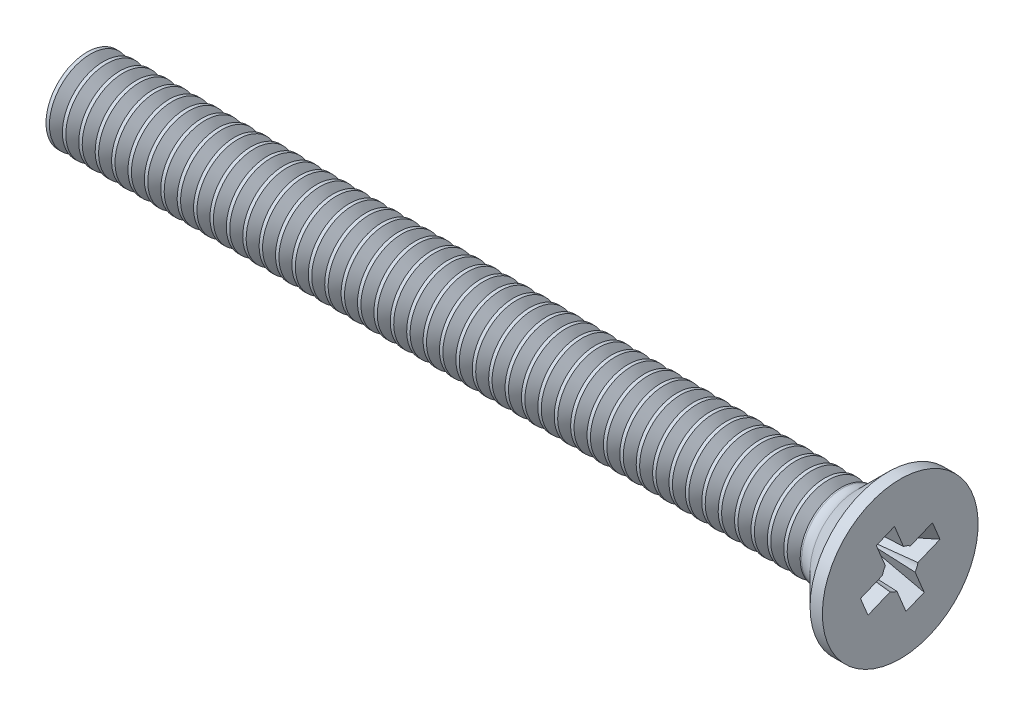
ISO-10303-21;
HEADER;
FILE_DESCRIPTION(('STEP AP214'),'2;1');
FILE_NAME('part.step','',(''),(''),'','','');
FILE_SCHEMA(('AUTOMOTIVE_DESIGN { 1 0 10303 214 1 1 1 1 }'));
ENDSEC;
DATA;
#1=APPLICATION_CONTEXT('core data for automotive mechanical design processes');
#2=APPLICATION_PROTOCOL_DEFINITION('international standard','automotive_design',2000,#1);
#3=PRODUCT_CONTEXT('',#1,'mechanical');
#4=PRODUCT('Part','Part','',(#3));
#5=PRODUCT_RELATED_PRODUCT_CATEGORY('part','',(#4));
#6=PRODUCT_DEFINITION_FORMATION('','',#4);
#7=PRODUCT_DEFINITION_CONTEXT('part definition',#1,'design');
#8=PRODUCT_DEFINITION('design','',#6,#7);
#9=PRODUCT_DEFINITION_SHAPE('','',#8);
#10=(LENGTH_UNIT() NAMED_UNIT(*) SI_UNIT(.MILLI.,.METRE.));
#11=(NAMED_UNIT(*) PLANE_ANGLE_UNIT() SI_UNIT($,.RADIAN.));
#12=(NAMED_UNIT(*) SI_UNIT($,.STERADIAN.) SOLID_ANGLE_UNIT());
#13=UNCERTAINTY_MEASURE_WITH_UNIT(LENGTH_MEASURE(1.E-05),#10,'distance_accuracy_value','');
#14=(GEOMETRIC_REPRESENTATION_CONTEXT(3) GLOBAL_UNCERTAINTY_ASSIGNED_CONTEXT((#13)) GLOBAL_UNIT_ASSIGNED_CONTEXT((#10,
#11,#12)) REPRESENTATION_CONTEXT('',''));
#15=CARTESIAN_POINT('',(0.,0.,0.));
#16=DIRECTION('',(0.,0.,1.));
#17=DIRECTION('',(1.,0.,0.));
#18=AXIS2_PLACEMENT_3D('',#15,#16,#17);
#19=CARTESIAN_POINT('',(-127.8,309.643888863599,135.233407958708));
#20=DIRECTION('',(0.,0.924224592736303,0.381849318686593));
#21=DIRECTION('',(0.,0.381849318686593,-0.924224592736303));
#22=AXIS2_PLACEMENT_3D('',#19,#20,#21);
#23=PLANE('',#22);
#24=DIRECTION('',(0.,-0.381849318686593,0.924224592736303));
#25=VECTOR('',#24,1.);
#26=CARTESIAN_POINT('',(-126.6,310.140942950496,134.030342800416));
#27=LINE('',#26,#25);
#28=CARTESIAN_POINT('',(-126.6,309.637634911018,135.248544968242));
#29=VERTEX_POINT('',#28);
#30=CARTESIAN_POINT('',(-126.6,309.415429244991,135.786369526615));
#31=VERTEX_POINT('',#30);
#32=EDGE_CURVE('E842',#29,#31,#27,.T.);
#33=ORIENTED_EDGE('',*,*,#32,.F.);
#34=CARTESIAN_POINT('',(-125.952306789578,309.617383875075,135.297560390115));
#35=CARTESIAN_POINT('',(-126.08549655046,309.621478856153,135.287648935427));
#36=CARTESIAN_POINT('',(-126.218679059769,309.62560891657,135.277652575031));
#37=CARTESIAN_POINT('',(-126.485026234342,309.633966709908,135.257423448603));
#38=CARTESIAN_POINT('',(-126.618190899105,309.638194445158,135.247190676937));
#39=CARTESIAN_POINT('',(-126.884492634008,309.646774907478,135.226422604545));
#40=CARTESIAN_POINT('',(-127.01762970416,309.651127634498,135.21588730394));
#41=CARTESIAN_POINT('',(-127.283863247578,309.660002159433,135.19440748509));
#42=CARTESIAN_POINT('',(-127.416959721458,309.664523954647,135.18346297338));
#43=CARTESIAN_POINT('',(-127.64303435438,309.672409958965,135.164375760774));
#44=CARTESIAN_POINT('',(-127.736027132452,309.675712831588,135.156381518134));
#45=CARTESIAN_POINT('',(-127.921972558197,309.682476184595,135.140011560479));
#46=CARTESIAN_POINT('',(-128.014925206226,309.685936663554,135.131635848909));
#47=CARTESIAN_POINT('',(-128.200781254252,309.693070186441,135.114369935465));
#48=CARTESIAN_POINT('',(-128.293684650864,309.696743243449,135.105479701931));
#49=CARTESIAN_POINT('',(-128.479398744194,309.704425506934,135.086885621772));
#50=CARTESIAN_POINT('',(-128.572209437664,309.7084347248,135.077181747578));
#51=CARTESIAN_POINT('',(-128.664951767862,309.712673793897,135.066921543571));
#52=B_SPLINE_CURVE_WITH_KNOTS('',3,(#34,#35,#36,#37,#38,#39,#40,#41,#42,#43,#44,#45,#46,#47,#48,
#49,#50,#51),.UNSPECIFIED.,.F.,.F.,(4,2,2,2,2,2,2,2,4),(0.,0.400862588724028,0.801734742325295,
1.20260673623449,1.60347233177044,1.88365413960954,2.16383341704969,2.44402995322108,
2.72423598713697),.UNSPECIFIED.);
#53=CARTESIAN_POINT('',(-127.8,309.678042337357,135.150743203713));
#54=VERTEX_POINT('',#53);
#55=EDGE_CURVE('E221',#29,#54,#52,.T.);
#56=ORIENTED_EDGE('',*,*,#55,.T.);
#57=DIRECTION('',(0.,-0.381849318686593,0.924224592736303));
#58=VECTOR('',#57,1.);
#59=CARTESIAN_POINT('',(-127.8,309.912483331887,134.583304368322));
#60=LINE('',#59,#58);
#61=CARTESIAN_POINT('',(-127.8,309.643888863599,135.233407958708));
#62=VERTEX_POINT('',#61);
#63=EDGE_CURVE('E866',#54,#62,#60,.T.);
#64=ORIENTED_EDGE('',*,*,#63,.T.);
#65=DIRECTION('',(-0.894934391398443,0.170380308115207,-0.412386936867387));
#66=VECTOR('',#65,1.);
#67=CARTESIAN_POINT('',(-126.6,309.415429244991,135.786369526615));
#68=LINE('',#67,#66);
#69=EDGE_CURVE('E853',#31,#62,#68,.T.);
#70=ORIENTED_EDGE('',*,*,#69,.F.);
#71=EDGE_LOOP('',(#33,#56,#64,#70));
#72=FACE_BOUND('',#71,.T.);
#73=ADVANCED_FACE('F37',(#72),#23,.T.);
#74=CARTESIAN_POINT('',(-127.8,309.912483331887,134.583304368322));
#75=VERTEX_POINT('',#74);
#76=CARTESIAN_POINT('',(-127.8,309.878329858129,134.665969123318));
#77=VERTEX_POINT('',#76);
#78=EDGE_CURVE('E868',#75,#77,#60,.T.);
#79=ORIENTED_EDGE('',*,*,#78,.T.);
#80=CARTESIAN_POINT('',(-125.952306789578,309.938988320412,134.519151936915));
#81=CARTESIAN_POINT('',(-126.08549655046,309.934893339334,134.529063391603));
#82=CARTESIAN_POINT('',(-126.218679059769,309.930763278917,134.539059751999));
#83=CARTESIAN_POINT('',(-126.485026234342,309.922405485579,134.559288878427));
#84=CARTESIAN_POINT('',(-126.618190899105,309.918177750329,134.569521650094));
#85=CARTESIAN_POINT('',(-126.884492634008,309.909597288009,134.590289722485));
#86=CARTESIAN_POINT('',(-127.01762970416,309.905244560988,134.60082502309));
#87=CARTESIAN_POINT('',(-127.283863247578,309.896370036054,134.62230484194));
#88=CARTESIAN_POINT('',(-127.416959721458,309.89184824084,134.63324935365));
#89=CARTESIAN_POINT('',(-127.64303435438,309.883962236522,134.652336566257));
#90=CARTESIAN_POINT('',(-127.736027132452,309.880659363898,134.660330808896));
#91=CARTESIAN_POINT('',(-127.921972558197,309.873896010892,134.676700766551));
#92=CARTESIAN_POINT('',(-128.014925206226,309.870435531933,134.685076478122));
#93=CARTESIAN_POINT('',(-128.200781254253,309.863302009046,134.702342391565));
#94=CARTESIAN_POINT('',(-128.293684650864,309.859628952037,134.711232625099));
#95=CARTESIAN_POINT('',(-128.479398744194,309.851946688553,134.729826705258));
#96=CARTESIAN_POINT('',(-128.572209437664,309.847937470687,134.739530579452));
#97=CARTESIAN_POINT('',(-128.664951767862,309.84369840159,134.749790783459));
#98=B_SPLINE_CURVE_WITH_KNOTS('',3,(#80,#81,#82,#83,#84,#85,#86,#87,#88,#89,#90,#91,#92,#93,#94,
#95,#96,#97),.UNSPECIFIED.,.F.,.F.,(4,2,2,2,2,2,2,2,4),(0.,0.400862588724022,0.801734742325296,
1.20260673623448,1.60347233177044,1.88365413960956,2.16383341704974,2.4440299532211,
2.72423598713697),.UNSPECIFIED.);
#99=CARTESIAN_POINT('',(-126.6,309.918737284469,134.568167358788));
#100=VERTEX_POINT('',#99);
#101=EDGE_CURVE('E214',#77,#100,#98,.F.);
#102=ORIENTED_EDGE('',*,*,#101,.T.);
#103=CARTESIAN_POINT('',(-126.6,310.140942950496,134.030342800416));
#104=VERTEX_POINT('',#103);
#105=EDGE_CURVE('E844',#104,#100,#27,.T.);
#106=ORIENTED_EDGE('',*,*,#105,.F.);
#107=DIRECTION('',(-0.894934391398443,-0.170380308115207,0.412386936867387));
#108=VECTOR('',#107,1.);
#109=CARTESIAN_POINT('',(-126.6,310.140942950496,134.030342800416));
#110=LINE('',#109,#108);
#111=EDGE_CURVE('E60',#104,#75,#110,.T.);
#112=ORIENTED_EDGE('',*,*,#111,.T.);
#113=EDGE_LOOP('',(#79,#102,#106,#112));
#114=FACE_BOUND('',#113,.T.);
#115=ADVANCED_FACE('F196',(#114),#23,.T.);
#116=CARTESIAN_POINT('',(-127.8,310.356111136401,134.766592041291));
#117=DIRECTION('',(0.,-0.924224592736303,-0.381849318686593));
#118=DIRECTION('',(-1.,0.,0.));
#119=AXIS2_PLACEMENT_3D('',#116,#117,#118);
#120=PLANE('',#119);
#121=DIRECTION('',(0.,0.381849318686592,-0.924224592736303));
#122=VECTOR('',#121,1.);
#123=CARTESIAN_POINT('',(-127.8,310.087516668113,135.416695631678));
#124=LINE('',#123,#122);
#125=CARTESIAN_POINT('',(-127.8,310.087516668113,135.416695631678));
#126=VERTEX_POINT('',#125);
#127=CARTESIAN_POINT('',(-127.8,310.121670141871,135.334030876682));
#128=VERTEX_POINT('',#127);
#129=EDGE_CURVE('E873',#126,#128,#124,.T.);
#130=ORIENTED_EDGE('',*,*,#129,.T.);
#131=CARTESIAN_POINT('',(-125.952306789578,310.061011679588,135.480848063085));
#132=CARTESIAN_POINT('',(-126.08549655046,310.065106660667,135.470936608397));
#133=CARTESIAN_POINT('',(-126.218679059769,310.069236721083,135.460940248));
#134=CARTESIAN_POINT('',(-126.485026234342,310.077594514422,135.440711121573));
#135=CARTESIAN_POINT('',(-126.618190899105,310.081822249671,135.430478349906));
#136=CARTESIAN_POINT('',(-126.884492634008,310.090402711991,135.409710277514));
#137=CARTESIAN_POINT('',(-127.01762970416,310.094755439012,135.399174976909));
#138=CARTESIAN_POINT('',(-127.283863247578,310.103629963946,135.37769515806));
#139=CARTESIAN_POINT('',(-127.416959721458,310.10815175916,135.366750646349));
#140=CARTESIAN_POINT('',(-127.64303435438,310.116037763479,135.347663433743));
#141=CARTESIAN_POINT('',(-127.736027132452,310.119340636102,135.339669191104));
#142=CARTESIAN_POINT('',(-127.921972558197,310.126103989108,135.323299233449));
#143=CARTESIAN_POINT('',(-128.014925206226,310.129564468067,135.314923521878));
#144=CARTESIAN_POINT('',(-128.200781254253,310.136697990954,135.297657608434));
#145=CARTESIAN_POINT('',(-128.293684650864,310.140371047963,135.288767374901));
#146=CARTESIAN_POINT('',(-128.479398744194,310.148053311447,135.270173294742));
#147=CARTESIAN_POINT('',(-128.572209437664,310.152062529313,135.260469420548));
#148=CARTESIAN_POINT('',(-128.664951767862,310.156301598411,135.25020921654));
#149=B_SPLINE_CURVE_WITH_KNOTS('',3,(#131,#132,#133,#134,#135,#136,#137,#138,#139,#140,#141,
#142,#143,#144,#145,#146,#147,#148),.UNSPECIFIED.,.F.,.F.,(4,2,2,2,2,2,2,2,4),(0.,
0.400862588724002,0.801734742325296,1.2026067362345,1.60347233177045,1.88365413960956,
2.16383341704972,2.44402995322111,2.72423598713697),.UNSPECIFIED.);
#150=CARTESIAN_POINT('',(-126.6,310.081262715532,135.431832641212));
#151=VERTEX_POINT('',#150);
#152=EDGE_CURVE('E277',#128,#151,#149,.F.);
#153=ORIENTED_EDGE('',*,*,#152,.T.);
#154=DIRECTION('',(0.,0.381849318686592,-0.924224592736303));
#155=VECTOR('',#154,1.);
#156=CARTESIAN_POINT('',(-126.6,309.859057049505,135.969657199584));
#157=LINE('',#156,#155);
#158=CARTESIAN_POINT('',(-126.6,309.859057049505,135.969657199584));
#159=VERTEX_POINT('',#158);
#160=EDGE_CURVE('E843',#159,#151,#157,.T.);
#161=ORIENTED_EDGE('',*,*,#160,.F.);
#162=DIRECTION('',(-0.894934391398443,0.170380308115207,-0.412386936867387));
#163=VECTOR('',#162,1.);
#164=CARTESIAN_POINT('',(-126.6,309.859057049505,135.969657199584));
#165=LINE('',#164,#163);
#166=EDGE_CURVE('E856',#159,#126,#165,.T.);
#167=ORIENTED_EDGE('',*,*,#166,.T.);
#168=EDGE_LOOP('',(#130,#153,#161,#167));
#169=FACE_BOUND('',#168,.T.);
#170=ADVANCED_FACE('F202',(#169),#120,.T.);
#171=CARTESIAN_POINT('',(-126.6,310.362365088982,134.751455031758));
#172=VERTEX_POINT('',#171);
#173=CARTESIAN_POINT('',(-126.6,310.584570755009,134.213630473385));
#174=VERTEX_POINT('',#173);
#175=EDGE_CURVE('E852',#172,#174,#157,.T.);
#176=ORIENTED_EDGE('',*,*,#175,.F.);
#177=CARTESIAN_POINT('',(-125.952306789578,310.382616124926,134.702439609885));
#178=CARTESIAN_POINT('',(-126.08549655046,310.378521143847,134.712351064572));
#179=CARTESIAN_POINT('',(-126.218679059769,310.37439108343,134.722347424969));
#180=CARTESIAN_POINT('',(-126.485026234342,310.366033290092,134.742576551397));
#181=CARTESIAN_POINT('',(-126.618190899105,310.361805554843,134.752809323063));
#182=CARTESIAN_POINT('',(-126.884492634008,310.353225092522,134.773577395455));
#183=CARTESIAN_POINT('',(-127.01762970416,310.348872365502,134.78411269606));
#184=CARTESIAN_POINT('',(-127.283863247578,310.339997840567,134.805592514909));
#185=CARTESIAN_POINT('',(-127.416959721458,310.335476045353,134.81653702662));
#186=CARTESIAN_POINT('',(-127.64303435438,310.327590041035,134.835624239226));
#187=CARTESIAN_POINT('',(-127.736027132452,310.324287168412,134.843618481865));
#188=CARTESIAN_POINT('',(-127.921972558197,310.317523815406,134.859988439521));
#189=CARTESIAN_POINT('',(-128.014925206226,310.314063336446,134.868364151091));
#190=CARTESIAN_POINT('',(-128.200781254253,310.306929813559,134.885630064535));
#191=CARTESIAN_POINT('',(-128.293684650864,310.303256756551,134.894520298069));
#192=CARTESIAN_POINT('',(-128.479398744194,310.295574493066,134.913114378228));
#193=CARTESIAN_POINT('',(-128.572209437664,310.2915652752,134.922818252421));
#194=CARTESIAN_POINT('',(-128.664951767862,310.287326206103,134.933078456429));
#195=B_SPLINE_CURVE_WITH_KNOTS('',3,(#177,#178,#179,#180,#181,#182,#183,#184,#185,#186,#187,
#188,#189,#190,#191,#192,#193,#194),.UNSPECIFIED.,.F.,.F.,(4,2,2,2,2,2,2,2,4),(0.,
0.400862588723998,0.801734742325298,1.20260673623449,1.60347233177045,1.88365413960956,
2.16383341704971,2.4440299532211,2.72423598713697),.UNSPECIFIED.);
#196=CARTESIAN_POINT('',(-127.8,310.321957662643,134.849256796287));
#197=VERTEX_POINT('',#196);
#198=EDGE_CURVE('E271',#172,#197,#195,.T.);
#199=ORIENTED_EDGE('',*,*,#198,.T.);
#200=CARTESIAN_POINT('',(-127.8,310.356111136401,134.766592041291));
#201=VERTEX_POINT('',#200);
#202=EDGE_CURVE('E810',#197,#201,#124,.T.);
#203=ORIENTED_EDGE('',*,*,#202,.T.);
#204=DIRECTION('',(-0.894934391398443,-0.170380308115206,0.412386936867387));
#205=VECTOR('',#204,1.);
#206=CARTESIAN_POINT('',(-126.6,310.584570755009,134.213630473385));
#207=LINE('',#206,#205);
#208=EDGE_CURVE('E860',#174,#201,#207,.T.);
#209=ORIENTED_EDGE('',*,*,#208,.F.);
#210=EDGE_LOOP('',(#176,#199,#203,#209));
#211=FACE_BOUND('',#210,.T.);
#212=ADVANCED_FACE('F902',(#211),#120,.T.);
#213=CARTESIAN_POINT('',(-127.8,310.087516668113,135.416695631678));
#214=DIRECTION('',(1.,0.,0.));
#215=DIRECTION('',(0.,-0.924224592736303,-0.381849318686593));
#216=AXIS2_PLACEMENT_3D('',#213,#214,#215);
#217=PLANE('',#216);
#218=DIRECTION('',(0.,-0.381849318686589,0.924224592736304));
#219=VECTOR('',#218,1.);
#220=CARTESIAN_POINT('',(-127.8,309.766592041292,134.643888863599));
#221=LINE('',#220,#219);
#222=CARTESIAN_POINT('',(-127.8,309.655158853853,134.913600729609));
#223=VERTEX_POINT('',#222);
#224=CARTESIAN_POINT('',(-127.8,309.583304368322,135.087516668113));
#225=VERTEX_POINT('',#224);
#226=EDGE_CURVE('E832',#223,#225,#221,.T.);
#227=ORIENTED_EDGE('',*,*,#226,.F.);
#228=CARTESIAN_POINT('',(-127.8,310.,135.));
#229=DIRECTION('',(1.,0.,0.));
#230=DIRECTION('',(0.,-0.924224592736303,-0.381849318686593));
#231=AXIS2_PLACEMENT_3D('',#228,#229,#230);
#232=CIRCLE('',#231,0.355499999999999);
#233=CARTESIAN_POINT('',(-127.8,309.665969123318,135.121670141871));
#234=VERTEX_POINT('',#233);
#235=EDGE_CURVE('E52',#234,#223,#232,.T.);
#236=ORIENTED_EDGE('',*,*,#235,.F.);
#237=DIRECTION('',(0.,0.924224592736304,0.38184931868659));
#238=VECTOR('',#237,1.);
#239=CARTESIAN_POINT('',(-127.8,309.583304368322,135.087516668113));
#240=LINE('',#239,#238);
#241=EDGE_CURVE('E833',#225,#234,#240,.T.);
#242=ORIENTED_EDGE('',*,*,#241,.F.);
#243=EDGE_LOOP('',(#227,#236,#242));
#244=FACE_BOUND('',#243,.T.);
#245=ADVANCED_FACE('F894',(#244),#217,.T.);
#246=ORIENTED_EDGE('',*,*,#63,.F.);
#247=CARTESIAN_POINT('',(-127.8,309.817804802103,135.305262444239));
#248=VERTEX_POINT('',#247);
#249=EDGE_CURVE('E942',#248,#54,#232,.T.);
#250=ORIENTED_EDGE('',*,*,#249,.F.);
#251=DIRECTION('',(0.,0.924224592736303,0.381849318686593));
#252=VECTOR('',#251,1.);
#253=CARTESIAN_POINT('',(-127.8,309.643888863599,135.233407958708));
#254=LINE('',#253,#252);
#255=EDGE_CURVE('E863',#62,#248,#254,.T.);
#256=ORIENTED_EDGE('',*,*,#255,.F.);
#257=EDGE_LOOP('',(#246,#250,#256));
#258=FACE_BOUND('',#257,.T.);
#259=ADVANCED_FACE('F901',(#258),#217,.T.);
#260=CARTESIAN_POINT('',(-127.8,309.913600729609,135.344841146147));
#261=VERTEX_POINT('',#260);
#262=EDGE_CURVE('E871',#261,#126,#254,.T.);
#263=ORIENTED_EDGE('',*,*,#262,.F.);
#264=EDGE_CURVE('E937',#128,#261,#232,.T.);
#265=ORIENTED_EDGE('',*,*,#264,.F.);
#266=ORIENTED_EDGE('',*,*,#129,.F.);
#267=EDGE_LOOP('',(#263,#265,#266));
#268=FACE_BOUND('',#267,.T.);
#269=ADVANCED_FACE('F971',(#268),#217,.T.);
#270=CARTESIAN_POINT('',(-127.8,310.150743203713,135.321957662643));
#271=VERTEX_POINT('',#270);
#272=CARTESIAN_POINT('',(-127.8,310.233407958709,135.356111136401));
#273=VERTEX_POINT('',#272);
#274=EDGE_CURVE('E831',#271,#273,#240,.T.);
#275=ORIENTED_EDGE('',*,*,#274,.F.);
#276=CARTESIAN_POINT('',(-127.8,310.30526244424,135.182195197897));
#277=VERTEX_POINT('',#276);
#278=EDGE_CURVE('E932',#277,#271,#232,.T.);
#279=ORIENTED_EDGE('',*,*,#278,.F.);
#280=DIRECTION('',(0.,0.381849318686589,-0.924224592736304));
#281=VECTOR('',#280,1.);
#282=CARTESIAN_POINT('',(-127.8,310.233407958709,135.356111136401));
#283=LINE('',#282,#281);
#284=EDGE_CURVE('E827',#273,#277,#283,.T.);
#285=ORIENTED_EDGE('',*,*,#284,.F.);
#286=EDGE_LOOP('',(#275,#279,#285));
#287=FACE_BOUND('',#286,.T.);
#288=ADVANCED_FACE('F969',(#287),#217,.T.);
#289=CARTESIAN_POINT('',(-127.8,310.344841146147,135.086399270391));
#290=VERTEX_POINT('',#289);
#291=CARTESIAN_POINT('',(-127.8,310.416695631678,134.912483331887));
#292=VERTEX_POINT('',#291);
#293=EDGE_CURVE('E835',#290,#292,#283,.T.);
#294=ORIENTED_EDGE('',*,*,#293,.F.);
#295=CARTESIAN_POINT('',(-127.8,310.334030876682,134.878329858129));
#296=VERTEX_POINT('',#295);
#297=EDGE_CURVE('E927',#296,#290,#232,.T.);
#298=ORIENTED_EDGE('',*,*,#297,.F.);
#299=DIRECTION('',(0.,-0.924224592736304,-0.38184931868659));
#300=VECTOR('',#299,1.);
#301=CARTESIAN_POINT('',(-127.8,310.416695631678,134.912483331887));
#302=LINE('',#301,#300);
#303=EDGE_CURVE('E837',#292,#296,#302,.T.);
#304=ORIENTED_EDGE('',*,*,#303,.F.);
#305=EDGE_LOOP('',(#294,#298,#304));
#306=FACE_BOUND('',#305,.T.);
#307=ADVANCED_FACE('F912',(#306),#217,.T.);
#308=ORIENTED_EDGE('',*,*,#202,.F.);
#309=CARTESIAN_POINT('',(-127.8,310.182195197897,134.69473755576));
#310=VERTEX_POINT('',#309);
#311=EDGE_CURVE('E922',#310,#197,#232,.T.);
#312=ORIENTED_EDGE('',*,*,#311,.F.);
#313=DIRECTION('',(0.,-0.924224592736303,-0.381849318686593));
#314=VECTOR('',#313,1.);
#315=CARTESIAN_POINT('',(-127.8,310.356111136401,134.766592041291));
#316=LINE('',#315,#314);
#317=EDGE_CURVE('E864',#201,#310,#316,.T.);
#318=ORIENTED_EDGE('',*,*,#317,.F.);
#319=EDGE_LOOP('',(#308,#312,#318));
#320=FACE_BOUND('',#319,.T.);
#321=ADVANCED_FACE('F905',(#320),#217,.T.);
#322=CARTESIAN_POINT('',(-127.8,310.086399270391,134.655158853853));
#323=VERTEX_POINT('',#322);
#324=EDGE_CURVE('E867',#323,#75,#316,.T.);
#325=ORIENTED_EDGE('',*,*,#324,.F.);
#326=EDGE_CURVE('E337',#77,#323,#232,.T.);
#327=ORIENTED_EDGE('',*,*,#326,.F.);
#328=ORIENTED_EDGE('',*,*,#78,.F.);
#329=EDGE_LOOP('',(#325,#327,#328));
#330=FACE_BOUND('',#329,.T.);
#331=ADVANCED_FACE('F895',(#330),#217,.T.);
#332=CARTESIAN_POINT('',(-126.6,309.859057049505,135.969657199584));
#333=DIRECTION('',(0.446197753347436,0.341730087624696,-0.827120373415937));
#334=DIRECTION('',(0.894934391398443,-0.170380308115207,0.412386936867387));
#335=AXIS2_PLACEMENT_3D('',#332,#333,#334);
#336=PLANE('',#335);
#337=ORIENTED_EDGE('',*,*,#255,.T.);
#338=CARTESIAN_POINT('',(-128.417550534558,309.983273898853,135.040483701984));
#339=DIRECTION('',(0.446197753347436,0.341730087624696,-0.827120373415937));
#340=DIRECTION('',(0.894934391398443,-0.170380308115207,0.412386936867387));
#341=AXIS2_PLACEMENT_3D('',#338,#339,#340);
#342=ELLIPSE('',#341,0.69995121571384,0.309229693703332);
#343=EDGE_CURVE('E289',#248,#261,#342,.F.);
#344=ORIENTED_EDGE('',*,*,#343,.T.);
#345=ORIENTED_EDGE('',*,*,#262,.T.);
#346=ORIENTED_EDGE('',*,*,#166,.F.);
#347=DIRECTION('',(0.,0.924224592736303,0.381849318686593));
#348=VECTOR('',#347,1.);
#349=CARTESIAN_POINT('',(-126.6,309.415429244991,135.786369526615));
#350=LINE('',#349,#348);
#351=EDGE_CURVE('E847',#31,#159,#350,.T.);
#352=ORIENTED_EDGE('',*,*,#351,.F.);
#353=ORIENTED_EDGE('',*,*,#69,.T.);
#354=EDGE_LOOP('',(#337,#344,#345,#346,#352,#353));
#355=FACE_BOUND('',#354,.T.);
#356=ADVANCED_FACE('F208',(#355),#336,.T.);
#357=CARTESIAN_POINT('',(-126.6,310.140942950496,134.030342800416));
#358=DIRECTION('',(0.446197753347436,-0.341730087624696,0.827120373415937));
#359=DIRECTION('',(-0.894934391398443,-0.170380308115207,0.412386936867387));
#360=AXIS2_PLACEMENT_3D('',#357,#358,#359);
#361=PLANE('',#360);
#362=ORIENTED_EDGE('',*,*,#317,.T.);
#363=CARTESIAN_POINT('',(-128.417550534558,310.016726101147,134.959516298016));
#364=DIRECTION('',(0.446197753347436,-0.341730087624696,0.827120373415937));
#365=DIRECTION('',(0.894934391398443,0.170380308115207,-0.412386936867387));
#366=AXIS2_PLACEMENT_3D('',#363,#364,#365);
#367=ELLIPSE('',#366,0.69995121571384,0.309229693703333);
#368=EDGE_CURVE('E294',#310,#323,#367,.F.);
#369=ORIENTED_EDGE('',*,*,#368,.T.);
#370=ORIENTED_EDGE('',*,*,#324,.T.);
#371=ORIENTED_EDGE('',*,*,#111,.F.);
#372=DIRECTION('',(0.,-0.924224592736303,-0.381849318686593));
#373=VECTOR('',#372,1.);
#374=CARTESIAN_POINT('',(-126.6,310.584570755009,134.213630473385));
#375=LINE('',#374,#373);
#376=EDGE_CURVE('E839',#174,#104,#375,.T.);
#377=ORIENTED_EDGE('',*,*,#376,.F.);
#378=ORIENTED_EDGE('',*,*,#208,.T.);
#379=EDGE_LOOP('',(#362,#369,#370,#371,#377,#378));
#380=FACE_BOUND('',#379,.T.);
#381=ADVANCED_FACE('F911',(#380),#361,.T.);
#382=CARTESIAN_POINT('',(-127.8,310.233407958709,135.356111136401));
#383=DIRECTION('',(0.,0.381849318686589,-0.924224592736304));
#384=DIRECTION('',(0.,-0.924224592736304,-0.38184931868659));
#385=AXIS2_PLACEMENT_3D('',#382,#383,#384);
#386=PLANE('',#385);
#387=DIRECTION('',(0.,0.924224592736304,0.38184931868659));
#388=VECTOR('',#387,1.);
#389=CARTESIAN_POINT('',(-126.6,309.030342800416,134.859057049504));
#390=LINE('',#389,#388);
#391=CARTESIAN_POINT('',(-126.6,310.248544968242,135.362365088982));
#392=VERTEX_POINT('',#391);
#393=CARTESIAN_POINT('',(-126.6,310.786369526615,135.584570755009));
#394=VERTEX_POINT('',#393);
#395=EDGE_CURVE('E808',#392,#394,#390,.T.);
#396=ORIENTED_EDGE('',*,*,#395,.F.);
#397=CARTESIAN_POINT('',(-125.952306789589,310.297560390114,135.382616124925));
#398=CARTESIAN_POINT('',(-126.08549655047,310.287648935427,135.378521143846));
#399=CARTESIAN_POINT('',(-126.218679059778,310.27765257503,135.37439108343));
#400=CARTESIAN_POINT('',(-126.485026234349,310.257423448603,135.366033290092));
#401=CARTESIAN_POINT('',(-126.61819089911,310.247190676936,135.361805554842));
#402=CARTESIAN_POINT('',(-126.884492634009,310.226422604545,135.353225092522));
#403=CARTESIAN_POINT('',(-127.017629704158,310.21588730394,135.348872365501));
#404=CARTESIAN_POINT('',(-127.283863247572,310.194407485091,135.339997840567));
#405=CARTESIAN_POINT('',(-127.416959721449,310.183462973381,135.335476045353));
#406=CARTESIAN_POINT('',(-127.643034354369,310.164375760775,135.327590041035));
#407=CARTESIAN_POINT('',(-127.73602713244,310.156381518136,135.324287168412));
#408=CARTESIAN_POINT('',(-127.921972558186,310.14001156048,135.317523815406));
#409=CARTESIAN_POINT('',(-128.014925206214,310.13163584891,135.314063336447));
#410=CARTESIAN_POINT('',(-128.200781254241,310.114369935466,135.30692981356));
#411=CARTESIAN_POINT('',(-128.293684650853,310.105479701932,135.303256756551));
#412=CARTESIAN_POINT('',(-128.479398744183,310.086885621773,135.295574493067));
#413=CARTESIAN_POINT('',(-128.572209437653,310.07718174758,135.291565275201));
#414=CARTESIAN_POINT('',(-128.664951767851,310.066921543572,135.287326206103));
#415=B_SPLINE_CURVE_WITH_KNOTS('',3,(#397,#398,#399,#400,#401,#402,#403,#404,#405,#406,#407,
#408,#409,#410,#411,#412,#413,#414),.UNSPECIFIED.,.F.,.F.,(4,2,2,2,2,2,2,2,4),(0.,
0.40086258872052,0.801734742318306,1.20260673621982,1.60347233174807,1.88365413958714,
2.16383341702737,2.44402995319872,2.72423598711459),.UNSPECIFIED.);
#416=EDGE_CURVE('E263',#392,#271,#415,.T.);
#417=ORIENTED_EDGE('',*,*,#416,.T.);
#418=ORIENTED_EDGE('',*,*,#274,.T.);
#419=DIRECTION('',(-0.894934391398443,-0.412386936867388,-0.170380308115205));
#420=VECTOR('',#419,1.);
#421=CARTESIAN_POINT('',(-126.6,310.786369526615,135.584570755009));
#422=LINE('',#421,#420);
#423=EDGE_CURVE('E816',#394,#273,#422,.T.);
#424=ORIENTED_EDGE('',*,*,#423,.F.);
#425=EDGE_LOOP('',(#396,#417,#418,#424));
#426=FACE_BOUND('',#425,.T.);
#427=ADVANCED_FACE('F955',(#426),#386,.T.);
#428=CARTESIAN_POINT('',(-127.8,309.766592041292,134.643888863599));
#429=DIRECTION('',(0.,-0.381849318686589,0.924224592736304));
#430=DIRECTION('',(-1.,0.,0.));
#431=AXIS2_PLACEMENT_3D('',#428,#429,#430);
#432=PLANE('',#431);
#433=ORIENTED_EDGE('',*,*,#303,.T.);
#434=CARTESIAN_POINT('',(-125.952306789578,310.480848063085,134.938988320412));
#435=CARTESIAN_POINT('',(-126.08549655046,310.470936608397,134.934893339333));
#436=CARTESIAN_POINT('',(-126.218679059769,310.460940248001,134.930763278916));
#437=CARTESIAN_POINT('',(-126.485026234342,310.440711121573,134.922405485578));
#438=CARTESIAN_POINT('',(-126.618190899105,310.430478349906,134.918177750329));
#439=CARTESIAN_POINT('',(-126.884492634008,310.409710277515,134.909597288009));
#440=CARTESIAN_POINT('',(-127.01762970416,310.39917497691,134.905244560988));
#441=CARTESIAN_POINT('',(-127.283863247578,310.37769515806,134.896370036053));
#442=CARTESIAN_POINT('',(-127.416959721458,310.36675064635,134.89184824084));
#443=CARTESIAN_POINT('',(-127.64303435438,310.347663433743,134.883962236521));
#444=CARTESIAN_POINT('',(-127.736027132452,310.339669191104,134.880659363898));
#445=CARTESIAN_POINT('',(-127.921972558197,310.323299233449,134.873896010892));
#446=CARTESIAN_POINT('',(-128.014925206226,310.314923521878,134.870435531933));
#447=CARTESIAN_POINT('',(-128.200781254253,310.297657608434,134.863302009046));
#448=CARTESIAN_POINT('',(-128.293684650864,310.288767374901,134.859628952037));
#449=CARTESIAN_POINT('',(-128.479398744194,310.270173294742,134.851946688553));
#450=CARTESIAN_POINT('',(-128.572209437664,310.260469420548,134.847937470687));
#451=CARTESIAN_POINT('',(-128.664951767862,310.250209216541,134.843698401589));
#452=B_SPLINE_CURVE_WITH_KNOTS('',3,(#434,#435,#436,#437,#438,#439,#440,#441,#442,#443,#444,
#445,#446,#447,#448,#449,#450,#451),.UNSPECIFIED.,.F.,.F.,(4,2,2,2,2,2,2,2,4),(0.,
0.400862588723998,0.801734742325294,1.20260673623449,1.60347233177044,1.88365413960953,
2.16383341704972,2.44402995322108,2.72423598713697),.UNSPECIFIED.);
#453=CARTESIAN_POINT('',(-126.6,310.431832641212,134.918737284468));
#454=VERTEX_POINT('',#453);
#455=EDGE_CURVE('E256',#296,#454,#452,.F.);
#456=ORIENTED_EDGE('',*,*,#455,.T.);
#457=DIRECTION('',(0.,-0.924224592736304,-0.381849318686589));
#458=VECTOR('',#457,1.);
#459=CARTESIAN_POINT('',(-126.6,310.969657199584,135.140942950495));
#460=LINE('',#459,#458);
#461=CARTESIAN_POINT('',(-126.6,310.969657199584,135.140942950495));
#462=VERTEX_POINT('',#461);
#463=EDGE_CURVE('E813',#462,#454,#460,.T.);
#464=ORIENTED_EDGE('',*,*,#463,.F.);
#465=DIRECTION('',(-0.894934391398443,-0.412386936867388,-0.170380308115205));
#466=VECTOR('',#465,1.);
#467=CARTESIAN_POINT('',(-126.6,310.969657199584,135.140942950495));
#468=LINE('',#467,#466);
#469=EDGE_CURVE('E819',#462,#292,#468,.T.);
#470=ORIENTED_EDGE('',*,*,#469,.T.);
#471=EDGE_LOOP('',(#433,#456,#464,#470));
#472=FACE_BOUND('',#471,.T.);
#473=ADVANCED_FACE('F951',(#472),#432,.T.);
#474=CARTESIAN_POINT('',(-126.6,310.969657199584,135.140942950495));
#475=DIRECTION('',(0.446197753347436,-0.827120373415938,-0.341730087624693));
#476=DIRECTION('',(0.894934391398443,0.412386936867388,0.170380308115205));
#477=AXIS2_PLACEMENT_3D('',#474,#475,#476);
#478=PLANE('',#477);
#479=ORIENTED_EDGE('',*,*,#284,.T.);
#480=CARTESIAN_POINT('',(-128.417550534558,310.040483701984,135.016726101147));
#481=DIRECTION('',(0.446197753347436,-0.827120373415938,-0.341730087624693));
#482=DIRECTION('',(0.894934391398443,0.412386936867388,0.170380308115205));
#483=AXIS2_PLACEMENT_3D('',#480,#481,#482);
#484=ELLIPSE('',#483,0.69995121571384,0.309229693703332);
#485=EDGE_CURVE('E306',#277,#290,#484,.F.);
#486=ORIENTED_EDGE('',*,*,#485,.T.);
#487=ORIENTED_EDGE('',*,*,#293,.T.);
#488=ORIENTED_EDGE('',*,*,#469,.F.);
#489=DIRECTION('',(0.,0.38184931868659,-0.924224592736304));
#490=VECTOR('',#489,1.);
#491=CARTESIAN_POINT('',(-126.6,310.786369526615,135.584570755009));
#492=LINE('',#491,#490);
#493=EDGE_CURVE('E807',#394,#462,#492,.T.);
#494=ORIENTED_EDGE('',*,*,#493,.F.);
#495=ORIENTED_EDGE('',*,*,#423,.T.);
#496=EDGE_LOOP('',(#479,#486,#487,#488,#494,#495));
#497=FACE_BOUND('',#496,.T.);
#498=ADVANCED_FACE('F233',(#497),#478,.T.);
#499=ORIENTED_EDGE('',*,*,#241,.T.);
#500=CARTESIAN_POINT('',(-125.952306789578,309.519151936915,135.061011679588));
#501=CARTESIAN_POINT('',(-126.08549655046,309.529063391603,135.065106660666));
#502=CARTESIAN_POINT('',(-126.218679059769,309.539059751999,135.069236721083));
#503=CARTESIAN_POINT('',(-126.485026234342,309.559288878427,135.077594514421));
#504=CARTESIAN_POINT('',(-126.618190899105,309.569521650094,135.081822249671));
#505=CARTESIAN_POINT('',(-126.884492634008,309.590289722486,135.090402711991));
#506=CARTESIAN_POINT('',(-127.01762970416,309.60082502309,135.094755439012));
#507=CARTESIAN_POINT('',(-127.283863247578,309.62230484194,135.103629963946));
#508=CARTESIAN_POINT('',(-127.416959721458,309.633249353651,135.10815175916));
#509=CARTESIAN_POINT('',(-127.64303435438,309.652336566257,135.116037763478));
#510=CARTESIAN_POINT('',(-127.736027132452,309.660330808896,135.119340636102));
#511=CARTESIAN_POINT('',(-127.921972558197,309.676700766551,135.126103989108));
#512=CARTESIAN_POINT('',(-128.014925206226,309.685076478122,135.129564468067));
#513=CARTESIAN_POINT('',(-128.200781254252,309.702342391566,135.136697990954));
#514=CARTESIAN_POINT('',(-128.293684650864,309.711232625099,135.140371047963));
#515=CARTESIAN_POINT('',(-128.479398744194,309.729826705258,135.148053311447));
#516=CARTESIAN_POINT('',(-128.572209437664,309.739530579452,135.152062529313));
#517=CARTESIAN_POINT('',(-128.664951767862,309.74979078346,135.15630159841));
#518=B_SPLINE_CURVE_WITH_KNOTS('',3,(#500,#501,#502,#503,#504,#505,#506,#507,#508,#509,#510,
#511,#512,#513,#514,#515,#516,#517),.UNSPECIFIED.,.F.,.F.,(4,2,2,2,2,2,2,2,4),(0.,
0.400862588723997,0.801734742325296,1.20260673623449,1.60347233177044,1.88365413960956,
2.16383341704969,2.44402995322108,2.72423598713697),.UNSPECIFIED.);
#519=CARTESIAN_POINT('',(-126.6,309.568167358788,135.081262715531));
#520=VERTEX_POINT('',#519);
#521=EDGE_CURVE('E248',#234,#520,#518,.F.);
#522=ORIENTED_EDGE('',*,*,#521,.T.);
#523=CARTESIAN_POINT('',(-126.6,309.030342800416,134.859057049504));
#524=VERTEX_POINT('',#523);
#525=EDGE_CURVE('E803',#524,#520,#390,.T.);
#526=ORIENTED_EDGE('',*,*,#525,.F.);
#527=DIRECTION('',(-0.894934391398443,0.412386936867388,0.170380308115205));
#528=VECTOR('',#527,1.);
#529=CARTESIAN_POINT('',(-126.6,309.030342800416,134.859057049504));
#530=LINE('',#529,#528);
#531=EDGE_CURVE('E822',#524,#225,#530,.T.);
#532=ORIENTED_EDGE('',*,*,#531,.T.);
#533=EDGE_LOOP('',(#499,#522,#526,#532));
#534=FACE_BOUND('',#533,.T.);
#535=ADVANCED_FACE('F947',(#534),#386,.T.);
#536=CARTESIAN_POINT('',(-126.6,309.751455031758,134.637634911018));
#537=VERTEX_POINT('',#536);
#538=CARTESIAN_POINT('',(-126.6,309.213630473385,134.415429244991));
#539=VERTEX_POINT('',#538);
#540=EDGE_CURVE('E815',#537,#539,#460,.T.);
#541=ORIENTED_EDGE('',*,*,#540,.F.);
#542=CARTESIAN_POINT('',(-125.952306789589,309.702439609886,134.617383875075));
#543=CARTESIAN_POINT('',(-126.08549655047,309.712351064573,134.621478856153));
#544=CARTESIAN_POINT('',(-126.218679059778,309.72234742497,134.62560891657));
#545=CARTESIAN_POINT('',(-126.485026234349,309.742576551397,134.633966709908));
#546=CARTESIAN_POINT('',(-126.61819089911,309.752809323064,134.638194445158));
#547=CARTESIAN_POINT('',(-126.884492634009,309.773577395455,134.646774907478));
#548=CARTESIAN_POINT('',(-127.017629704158,309.78411269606,134.651127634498));
#549=CARTESIAN_POINT('',(-127.283863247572,309.805592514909,134.660002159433));
#550=CARTESIAN_POINT('',(-127.416959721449,309.816537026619,134.664523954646));
#551=CARTESIAN_POINT('',(-127.643034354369,309.835624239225,134.672409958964));
#552=CARTESIAN_POINT('',(-127.73602713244,309.843618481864,134.675712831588));
#553=CARTESIAN_POINT('',(-127.921972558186,309.85998843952,134.682476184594));
#554=CARTESIAN_POINT('',(-128.014925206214,309.86836415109,134.685936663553));
#555=CARTESIAN_POINT('',(-128.200781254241,309.885630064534,134.69307018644));
#556=CARTESIAN_POINT('',(-128.293684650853,309.894520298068,134.696743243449));
#557=CARTESIAN_POINT('',(-128.479398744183,309.913114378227,134.704425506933));
#558=CARTESIAN_POINT('',(-128.572209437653,309.92281825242,134.708434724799));
#559=CARTESIAN_POINT('',(-128.664951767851,309.933078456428,134.712673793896));
#560=B_SPLINE_CURVE_WITH_KNOTS('',3,(#542,#543,#544,#545,#546,#547,#548,#549,#550,#551,#552,
#553,#554,#555,#556,#557,#558,#559),.UNSPECIFIED.,.F.,.F.,(4,2,2,2,2,2,2,2,4),(0.,
0.400862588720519,0.80173474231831,1.20260673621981,1.60347233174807,1.88365413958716,
2.16383341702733,2.44402995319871,2.7242359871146),.UNSPECIFIED.);
#561=CARTESIAN_POINT('',(-127.8,309.849256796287,134.678042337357));
#562=VERTEX_POINT('',#561);
#563=EDGE_CURVE('E238',#537,#562,#560,.T.);
#564=ORIENTED_EDGE('',*,*,#563,.T.);
#565=CARTESIAN_POINT('',(-127.8,309.766592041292,134.643888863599));
#566=VERTEX_POINT('',#565);
#567=EDGE_CURVE('E228',#562,#566,#302,.T.);
#568=ORIENTED_EDGE('',*,*,#567,.T.);
#569=DIRECTION('',(-0.894934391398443,0.412386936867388,0.170380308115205));
#570=VECTOR('',#569,1.);
#571=CARTESIAN_POINT('',(-126.6,309.213630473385,134.415429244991));
#572=LINE('',#571,#570);
#573=EDGE_CURVE('E824',#539,#566,#572,.T.);
#574=ORIENTED_EDGE('',*,*,#573,.F.);
#575=EDGE_LOOP('',(#541,#564,#568,#574));
#576=FACE_BOUND('',#575,.T.);
#577=ADVANCED_FACE('F796',(#576),#432,.T.);
#578=CARTESIAN_POINT('',(-126.6,309.030342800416,134.859057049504));
#579=DIRECTION('',(0.446197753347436,0.827120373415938,0.341730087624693));
#580=DIRECTION('',(-0.894934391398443,0.412386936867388,0.170380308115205));
#581=AXIS2_PLACEMENT_3D('',#578,#579,#580);
#582=PLANE('',#581);
#583=CARTESIAN_POINT('',(-127.8,309.69473755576,134.817804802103));
#584=VERTEX_POINT('',#583);
#585=EDGE_CURVE('E828',#566,#584,#221,.T.);
#586=ORIENTED_EDGE('',*,*,#585,.T.);
#587=CARTESIAN_POINT('',(-128.417550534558,309.959516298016,134.983273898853));
#588=DIRECTION('',(0.446197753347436,0.827120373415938,0.341730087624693));
#589=DIRECTION('',(0.894934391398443,-0.412386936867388,-0.170380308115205));
#590=AXIS2_PLACEMENT_3D('',#587,#588,#589);
#591=ELLIPSE('',#590,0.69995121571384,0.309229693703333);
#592=EDGE_CURVE('E11',#584,#223,#591,.F.);
#593=ORIENTED_EDGE('',*,*,#592,.T.);
#594=ORIENTED_EDGE('',*,*,#226,.T.);
#595=ORIENTED_EDGE('',*,*,#531,.F.);
#596=DIRECTION('',(0.,-0.38184931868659,0.924224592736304));
#597=VECTOR('',#596,1.);
#598=CARTESIAN_POINT('',(-126.6,309.213630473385,134.415429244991));
#599=LINE('',#598,#597);
#600=EDGE_CURVE('E229',#539,#524,#599,.T.);
#601=ORIENTED_EDGE('',*,*,#600,.F.);
#602=ORIENTED_EDGE('',*,*,#573,.T.);
#603=EDGE_LOOP('',(#586,#593,#594,#595,#601,#602));
#604=FACE_BOUND('',#603,.T.);
#605=ADVANCED_FACE('F791',(#604),#582,.T.);
#606=CARTESIAN_POINT('',(-126.6,310.,135.));
#607=DIRECTION('',(1.,0.,0.));
#608=DIRECTION('',(0.,-0.924224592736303,-0.381849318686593));
#609=AXIS2_PLACEMENT_3D('',#606,#607,#608);
#610=PLANE('',#609);
#611=CARTESIAN_POINT('',(-126.6,310.,135.));
#612=DIRECTION('',(1.,0.,0.));
#613=DIRECTION('',(0.,-0.924224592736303,-0.381849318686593));
#614=AXIS2_PLACEMENT_3D('',#611,#612,#613);
#615=CIRCLE('',#614,1.9);
#616=CARTESIAN_POINT('',(-126.6,308.243973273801,134.274486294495));
#617=VERTEX_POINT('',#616);
#618=EDGE_CURVE('E801',#617,#617,#615,.T.);
#619=ORIENTED_EDGE('',*,*,#618,.T.);
#620=EDGE_LOOP('',(#619));
#621=FACE_BOUND('',#620,.T.);
#622=ORIENTED_EDGE('',*,*,#525,.T.);
#623=CARTESIAN_POINT('',(-126.6,310.,135.));
#624=DIRECTION('',(1.,0.,0.));
#625=DIRECTION('',(0.,-0.924224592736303,-0.381849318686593));
#626=AXIS2_PLACEMENT_3D('',#623,#624,#625);
#627=CIRCLE('',#626,0.439412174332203);
#628=EDGE_CURVE('E325',#29,#520,#627,.T.);
#629=ORIENTED_EDGE('',*,*,#628,.F.);
#630=ORIENTED_EDGE('',*,*,#32,.T.);
#631=ORIENTED_EDGE('',*,*,#351,.T.);
#632=ORIENTED_EDGE('',*,*,#160,.T.);
#633=EDGE_CURVE('E328',#392,#151,#627,.T.);
#634=ORIENTED_EDGE('',*,*,#633,.F.);
#635=ORIENTED_EDGE('',*,*,#395,.T.);
#636=ORIENTED_EDGE('',*,*,#493,.T.);
#637=ORIENTED_EDGE('',*,*,#463,.T.);
#638=EDGE_CURVE('E324',#172,#454,#627,.T.);
#639=ORIENTED_EDGE('',*,*,#638,.F.);
#640=ORIENTED_EDGE('',*,*,#175,.T.);
#641=ORIENTED_EDGE('',*,*,#376,.T.);
#642=ORIENTED_EDGE('',*,*,#105,.T.);
#643=EDGE_CURVE('E320',#537,#100,#627,.T.);
#644=ORIENTED_EDGE('',*,*,#643,.F.);
#645=ORIENTED_EDGE('',*,*,#540,.T.);
#646=ORIENTED_EDGE('',*,*,#600,.T.);
#647=EDGE_LOOP('',(#622,#629,#630,#631,#632,#634,#635,#636,#637,#639,#640,#641,#642,#644,#645,#646));
#648=FACE_BOUND('',#647,.T.);
#649=ADVANCED_FACE('F788',(#621,#648),#610,.T.);
#650=CARTESIAN_POINT('',(-120.25,310.,135.));
#651=DIRECTION('',(1.,0.,0.));
#652=DIRECTION('',(0.,-0.924224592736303,-0.381849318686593));
#653=AXIS2_PLACEMENT_3D('',#650,#651,#652);
#654=CYLINDRICAL_SURFACE('',#653,1.9);
#655=CARTESIAN_POINT('',(-126.9,310.,135.));
#656=DIRECTION('',(1.,0.,0.));
#657=DIRECTION('',(0.,-0.924224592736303,-0.381849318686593));
#658=AXIS2_PLACEMENT_3D('',#655,#656,#657);
#659=CIRCLE('',#658,1.9);
#660=CARTESIAN_POINT('',(-126.9,308.243973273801,134.274486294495));
#661=VERTEX_POINT('',#660);
#662=EDGE_CURVE('E850',#661,#661,#659,.T.);
#663=ORIENTED_EDGE('',*,*,#662,.T.);
#664=EDGE_LOOP('',(#663));
#665=FACE_BOUND('',#664,.T.);
#666=ORIENTED_EDGE('',*,*,#618,.F.);
#667=EDGE_LOOP('',(#666));
#668=FACE_BOUND('',#667,.T.);
#669=ADVANCED_FACE('F785',(#665,#668),#654,.T.);
#670=CARTESIAN_POINT('',(-126.9,310.,135.));
#671=DIRECTION('',(1.,0.,0.));
#672=DIRECTION('',(0.,-0.924224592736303,-0.381849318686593));
#673=AXIS2_PLACEMENT_3D('',#670,#671,#672);
#674=CONICAL_SURFACE('',#673,1.9,0.78539816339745);
#675=CARTESIAN_POINT('',(-127.653553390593,310.,135.));
#676=DIRECTION('',(1.,0.,0.));
#677=DIRECTION('',(0.,-0.924224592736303,-0.381849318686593));
#678=AXIS2_PLACEMENT_3D('',#675,#676,#677);
#679=CIRCLE('',#678,1.14644660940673);
#680=CARTESIAN_POINT('',(-127.653553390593,308.940425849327,134.562230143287));
#681=VERTEX_POINT('',#680);
#682=EDGE_CURVE('E878',#681,#681,#679,.T.);
#683=ORIENTED_EDGE('',*,*,#682,.T.);
#684=EDGE_LOOP('',(#683));
#685=FACE_BOUND('',#684,.T.);
#686=ORIENTED_EDGE('',*,*,#662,.F.);
#687=EDGE_LOOP('',(#686));
#688=FACE_BOUND('',#687,.T.);
#689=ADVANCED_FACE('F780',(#685,#688),#674,.T.);
#690=CARTESIAN_POINT('',(-120.25,310.,135.));
#691=DIRECTION('',(1.,0.,0.));
#692=DIRECTION('',(0.,-0.924224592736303,-0.381849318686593));
#693=AXIS2_PLACEMENT_3D('',#690,#691,#692);
#694=CYLINDRICAL_SURFACE('',#693,1.);
#695=CARTESIAN_POINT('',(-128.041754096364,310.,135.));
#696=DIRECTION('',(1.,0.,0.));
#697=DIRECTION('',(0.,-0.381849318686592,0.924224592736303));
#698=AXIS2_PLACEMENT_3D('',#695,#696,#697);
#699=CIRCLE('',#698,1.);
#700=CARTESIAN_POINT('',(-128.041754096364,309.618150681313,135.924224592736));
#701=VERTEX_POINT('',#700);
#702=EDGE_CURVE('E342',#701,#701,#699,.T.);
#703=ORIENTED_EDGE('',*,*,#702,.T.);
#704=EDGE_LOOP('',(#703));
#705=FACE_BOUND('',#704,.T.);
#706=CARTESIAN_POINT('',(-128.007106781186,310.,135.));
#707=DIRECTION('',(1.,0.,0.));
#708=DIRECTION('',(0.,-0.924224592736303,-0.381849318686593));
#709=AXIS2_PLACEMENT_3D('',#706,#707,#708);
#710=CIRCLE('',#709,1.);
#711=CARTESIAN_POINT('',(-128.007106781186,309.075775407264,134.618150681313));
#712=VERTEX_POINT('',#711);
#713=EDGE_CURVE('E45',#712,#712,#710,.F.);
#714=ORIENTED_EDGE('',*,*,#713,.T.);
#715=EDGE_LOOP('',(#714));
#716=FACE_BOUND('',#715,.T.);
#717=ADVANCED_FACE('F777',(#705,#716),#694,.T.);
#718=CARTESIAN_POINT('',(-128.007106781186,310.,135.));
#719=DIRECTION('',(1.,0.,0.));
#720=DIRECTION('',(0.,-0.924224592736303,-0.381849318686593));
#721=AXIS2_PLACEMENT_3D('',#718,#719,#720);
#722=TOROIDAL_SURFACE('',#721,1.5,0.5);
#723=ORIENTED_EDGE('',*,*,#713,.F.);
#724=EDGE_LOOP('',(#723));
#725=FACE_BOUND('',#724,.T.);
#726=ORIENTED_EDGE('',*,*,#682,.F.);
#727=EDGE_LOOP('',(#726));
#728=FACE_BOUND('',#727,.T.);
#729=ADVANCED_FACE('F39',(#725,#728),#722,.F.);
#730=ORIENTED_EDGE('',*,*,#567,.F.);
#731=EDGE_CURVE('E330',#584,#562,#232,.T.);
#732=ORIENTED_EDGE('',*,*,#731,.F.);
#733=ORIENTED_EDGE('',*,*,#585,.F.);
#734=EDGE_LOOP('',(#730,#732,#733));
#735=FACE_BOUND('',#734,.T.);
#736=ADVANCED_FACE('F776',(#735),#217,.T.);
#737=CARTESIAN_POINT('',(-127.8,310.,135.));
#738=DIRECTION('',(1.,0.,0.));
#739=DIRECTION('',(0.,-0.924224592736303,-0.381849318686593));
#740=AXIS2_PLACEMENT_3D('',#737,#738,#739);
#741=CONICAL_SURFACE('',#740,0.355499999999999,0.0698131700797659);
#742=ORIENTED_EDGE('',*,*,#628,.T.);
#743=ORIENTED_EDGE('',*,*,#521,.F.);
#744=EDGE_CURVE('E340',#54,#234,#232,.T.);
#745=ORIENTED_EDGE('',*,*,#744,.F.);
#746=ORIENTED_EDGE('',*,*,#55,.F.);
#747=EDGE_LOOP('',(#742,#743,#745,#746));
#748=FACE_BOUND('',#747,.T.);
#749=ADVANCED_FACE('F193',(#748),#741,.F.);
#750=EDGE_CURVE('E333',#562,#77,#232,.T.);
#751=ORIENTED_EDGE('',*,*,#750,.F.);
#752=ORIENTED_EDGE('',*,*,#563,.F.);
#753=ORIENTED_EDGE('',*,*,#643,.T.);
#754=ORIENTED_EDGE('',*,*,#101,.F.);
#755=EDGE_LOOP('',(#751,#752,#753,#754));
#756=FACE_BOUND('',#755,.T.);
#757=ADVANCED_FACE('F899',(#756),#741,.F.);
#758=EDGE_CURVE('E935',#271,#128,#232,.T.);
#759=ORIENTED_EDGE('',*,*,#758,.F.);
#760=ORIENTED_EDGE('',*,*,#416,.F.);
#761=ORIENTED_EDGE('',*,*,#633,.T.);
#762=ORIENTED_EDGE('',*,*,#152,.F.);
#763=EDGE_LOOP('',(#759,#760,#761,#762));
#764=FACE_BOUND('',#763,.T.);
#765=ADVANCED_FACE('F1121',(#764),#741,.F.);
#766=ORIENTED_EDGE('',*,*,#638,.T.);
#767=ORIENTED_EDGE('',*,*,#455,.F.);
#768=EDGE_CURVE('E926',#197,#296,#232,.T.);
#769=ORIENTED_EDGE('',*,*,#768,.F.);
#770=ORIENTED_EDGE('',*,*,#198,.F.);
#771=EDGE_LOOP('',(#766,#767,#769,#770));
#772=FACE_BOUND('',#771,.T.);
#773=ADVANCED_FACE('F1129',(#772),#741,.F.);
#774=EDGE_CURVE('E940',#261,#248,#232,.T.);
#775=ORIENTED_EDGE('',*,*,#774,.F.);
#776=ORIENTED_EDGE('',*,*,#343,.F.);
#777=EDGE_LOOP('',(#775,#776));
#778=FACE_BOUND('',#777,.T.);
#779=ADVANCED_FACE('F1138',(#778),#741,.F.);
#780=EDGE_CURVE('E925',#323,#310,#232,.T.);
#781=ORIENTED_EDGE('',*,*,#780,.F.);
#782=ORIENTED_EDGE('',*,*,#368,.F.);
#783=EDGE_LOOP('',(#781,#782));
#784=FACE_BOUND('',#783,.T.);
#785=ADVANCED_FACE('F1147',(#784),#741,.F.);
#786=EDGE_CURVE('E930',#290,#277,#232,.T.);
#787=ORIENTED_EDGE('',*,*,#786,.F.);
#788=ORIENTED_EDGE('',*,*,#485,.F.);
#789=EDGE_LOOP('',(#787,#788));
#790=FACE_BOUND('',#789,.T.);
#791=ADVANCED_FACE('F190',(#790),#741,.F.);
#792=EDGE_CURVE('E334',#223,#584,#232,.T.);
#793=ORIENTED_EDGE('',*,*,#792,.F.);
#794=ORIENTED_EDGE('',*,*,#592,.F.);
#795=EDGE_LOOP('',(#793,#794));
#796=FACE_BOUND('',#795,.T.);
#797=ADVANCED_FACE('F181',(#796),#741,.F.);
#798=CARTESIAN_POINT('',(-127.915508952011,310.,135.));
#799=DIRECTION('',(1.,0.,0.));
#800=DIRECTION('',(0.,-0.924224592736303,-0.381849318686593));
#801=AXIS2_PLACEMENT_3D('',#798,#799,#800);
#802=CONICAL_SURFACE('',#801,0.,1.25663706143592);
#803=ORIENTED_EDGE('',*,*,#731,.T.);
#804=ORIENTED_EDGE('',*,*,#750,.T.);
#805=ORIENTED_EDGE('',*,*,#326,.T.);
#806=ORIENTED_EDGE('',*,*,#780,.T.);
#807=ORIENTED_EDGE('',*,*,#311,.T.);
#808=ORIENTED_EDGE('',*,*,#768,.T.);
#809=ORIENTED_EDGE('',*,*,#297,.T.);
#810=ORIENTED_EDGE('',*,*,#786,.T.);
#811=ORIENTED_EDGE('',*,*,#278,.T.);
#812=ORIENTED_EDGE('',*,*,#758,.T.);
#813=ORIENTED_EDGE('',*,*,#264,.T.);
#814=ORIENTED_EDGE('',*,*,#774,.T.);
#815=ORIENTED_EDGE('',*,*,#249,.T.);
#816=ORIENTED_EDGE('',*,*,#744,.T.);
#817=ORIENTED_EDGE('',*,*,#235,.T.);
#818=ORIENTED_EDGE('',*,*,#792,.T.);
#819=EDGE_LOOP('',(#803,#804,#805,#806,#807,#808,#809,#810,#811,#812,#813,#814,#815,#816,#817,#818));
#820=FACE_BOUND('',#819,.T.);
#821=CARTESIAN_POINT('',(-127.915508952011,310.,135.));
#822=VERTEX_POINT('',#821);
#823=VERTEX_LOOP('',#822);
#824=FACE_BOUND('',#823,.T.);
#825=ADVANCED_FACE('F178',(#820,#824),#802,.F.);
#826=CARTESIAN_POINT('',(-128.358247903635,310.,135.));
#827=DIRECTION('',(-1.,0.,0.));
#828=DIRECTION('',(0.,0.381849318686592,-0.924224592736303));
#829=AXIS2_PLACEMENT_3D('',#826,#827,#828);
#830=CONICAL_SURFACE('',#829,1.,0.959931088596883);
#831=CARTESIAN_POINT('',(-128.200001,310.,135.));
#832=DIRECTION('',(1.,0.,0.));
#833=DIRECTION('',(0.,-0.381849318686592,0.924224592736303));
#834=AXIS2_PLACEMENT_3D('',#831,#832,#833);
#835=CIRCLE('',#834,0.774);
#836=CARTESIAN_POINT('',(-128.200001,309.704448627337,135.715349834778));
#837=VERTEX_POINT('',#836);
#838=EDGE_CURVE('E346',#837,#837,#835,.T.);
#839=ORIENTED_EDGE('',*,*,#838,.F.);
#840=EDGE_LOOP('',(#839));
#841=FACE_BOUND('',#840,.T.);
#842=CARTESIAN_POINT('',(-128.358247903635,310.,135.));
#843=DIRECTION('',(1.,0.,0.));
#844=DIRECTION('',(0.,-0.381849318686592,0.924224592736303));
#845=AXIS2_PLACEMENT_3D('',#842,#843,#844);
#846=CIRCLE('',#845,1.);
#847=CARTESIAN_POINT('',(-128.358247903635,309.618150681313,135.924224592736));
#848=VERTEX_POINT('',#847);
#849=EDGE_CURVE('E339',#848,#848,#846,.T.);
#850=ORIENTED_EDGE('',*,*,#849,.T.);
#851=EDGE_LOOP('',(#850));
#852=FACE_BOUND('',#851,.T.);
#853=ADVANCED_FACE('F180',(#841,#852),#830,.T.);
#854=CARTESIAN_POINT('',(-128.200001,310.,135.));
#855=DIRECTION('',(1.,0.,0.));
#856=DIRECTION('',(0.,-0.381849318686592,0.924224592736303));
#857=AXIS2_PLACEMENT_3D('',#854,#855,#856);
#858=CONICAL_SURFACE('',#857,0.774,0.959931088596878);
#859=ORIENTED_EDGE('',*,*,#702,.F.);
#860=EDGE_LOOP('',(#859));
#861=FACE_BOUND('',#860,.T.);
#862=ORIENTED_EDGE('',*,*,#838,.T.);
#863=EDGE_LOOP('',(#862));
#864=FACE_BOUND('',#863,.T.);
#865=ADVANCED_FACE('F187',(#861,#864),#858,.T.);
#866=CARTESIAN_POINT('',(-128.441754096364,310.,135.));
#867=DIRECTION('',(1.,0.,0.));
#868=DIRECTION('',(0.,-0.381849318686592,0.924224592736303));
#869=AXIS2_PLACEMENT_3D('',#866,#867,#868);
#870=CIRCLE('',#869,1.);
#871=CARTESIAN_POINT('',(-128.441754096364,309.618150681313,135.924224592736));
#872=VERTEX_POINT('',#871);
#873=EDGE_CURVE('E354',#872,#872,#870,.T.);
#874=ORIENTED_EDGE('',*,*,#873,.T.);
#875=EDGE_LOOP('',(#874));
#876=FACE_BOUND('',#875,.T.);
#877=ORIENTED_EDGE('',*,*,#849,.F.);
#878=EDGE_LOOP('',(#877));
#879=FACE_BOUND('',#878,.T.);
#880=ADVANCED_FACE('F782',(#876,#879),#694,.T.);
#881=CARTESIAN_POINT('',(-128.758247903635,310.,135.));
#882=DIRECTION('',(-1.,0.,0.));
#883=DIRECTION('',(0.,0.381849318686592,-0.924224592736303));
#884=AXIS2_PLACEMENT_3D('',#881,#882,#883);
#885=CONICAL_SURFACE('',#884,1.,0.959931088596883);
#886=CARTESIAN_POINT('',(-128.600001,310.,135.));
#887=DIRECTION('',(1.,0.,0.));
#888=DIRECTION('',(0.,-0.381849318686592,0.924224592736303));
#889=AXIS2_PLACEMENT_3D('',#886,#887,#888);
#890=CIRCLE('',#889,0.774);
#891=CARTESIAN_POINT('',(-128.600001,309.704448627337,135.715349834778));
#892=VERTEX_POINT('',#891);
#893=EDGE_CURVE('E357',#892,#892,#890,.T.);
#894=ORIENTED_EDGE('',*,*,#893,.F.);
#895=EDGE_LOOP('',(#894));
#896=FACE_BOUND('',#895,.T.);
#897=CARTESIAN_POINT('',(-128.758247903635,310.,135.));
#898=DIRECTION('',(1.,0.,0.));
#899=DIRECTION('',(0.,-0.381849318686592,0.924224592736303));
#900=AXIS2_PLACEMENT_3D('',#897,#898,#899);
#901=CIRCLE('',#900,1.);
#902=CARTESIAN_POINT('',(-128.758247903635,309.618150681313,135.924224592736));
#903=VERTEX_POINT('',#902);
#904=EDGE_CURVE('E351',#903,#903,#901,.T.);
#905=ORIENTED_EDGE('',*,*,#904,.T.);
#906=EDGE_LOOP('',(#905));
#907=FACE_BOUND('',#906,.T.);
#908=ADVANCED_FACE('F1197',(#896,#907),#885,.T.);
#909=CARTESIAN_POINT('',(-128.600001,310.,135.));
#910=DIRECTION('',(1.,0.,0.));
#911=DIRECTION('',(0.,-0.381849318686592,0.924224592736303));
#912=AXIS2_PLACEMENT_3D('',#909,#910,#911);
#913=CONICAL_SURFACE('',#912,0.774,0.959931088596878);
#914=ORIENTED_EDGE('',*,*,#873,.F.);
#915=EDGE_LOOP('',(#914));
#916=FACE_BOUND('',#915,.T.);
#917=ORIENTED_EDGE('',*,*,#893,.T.);
#918=EDGE_LOOP('',(#917));
#919=FACE_BOUND('',#918,.T.);
#920=ADVANCED_FACE('F1207',(#916,#919),#913,.T.);
#921=CARTESIAN_POINT('',(-128.841754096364,310.,135.));
#922=DIRECTION('',(1.,0.,0.));
#923=DIRECTION('',(0.,-0.381849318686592,0.924224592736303));
#924=AXIS2_PLACEMENT_3D('',#921,#922,#923);
#925=CIRCLE('',#924,1.);
#926=CARTESIAN_POINT('',(-128.841754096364,309.618150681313,135.924224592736));
#927=VERTEX_POINT('',#926);
#928=EDGE_CURVE('E363',#927,#927,#925,.T.);
#929=ORIENTED_EDGE('',*,*,#928,.T.);
#930=EDGE_LOOP('',(#929));
#931=FACE_BOUND('',#930,.T.);
#932=ORIENTED_EDGE('',*,*,#904,.F.);
#933=EDGE_LOOP('',(#932));
#934=FACE_BOUND('',#933,.T.);
#935=ADVANCED_FACE('F1199',(#931,#934),#694,.T.);
#936=CARTESIAN_POINT('',(-129.158247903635,310.,135.));
#937=DIRECTION('',(-1.,0.,0.));
#938=DIRECTION('',(0.,0.381849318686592,-0.924224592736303));
#939=AXIS2_PLACEMENT_3D('',#936,#937,#938);
#940=CONICAL_SURFACE('',#939,1.,0.959931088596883);
#941=CARTESIAN_POINT('',(-129.000001,310.,135.));
#942=DIRECTION('',(1.,0.,0.));
#943=DIRECTION('',(0.,-0.381849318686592,0.924224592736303));
#944=AXIS2_PLACEMENT_3D('',#941,#942,#943);
#945=CIRCLE('',#944,0.774);
#946=CARTESIAN_POINT('',(-129.000001,309.704448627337,135.715349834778));
#947=VERTEX_POINT('',#946);
#948=EDGE_CURVE('E366',#947,#947,#945,.T.);
#949=ORIENTED_EDGE('',*,*,#948,.F.);
#950=EDGE_LOOP('',(#949));
#951=FACE_BOUND('',#950,.T.);
#952=CARTESIAN_POINT('',(-129.158247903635,310.,135.));
#953=DIRECTION('',(1.,0.,0.));
#954=DIRECTION('',(0.,-0.381849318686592,0.924224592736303));
#955=AXIS2_PLACEMENT_3D('',#952,#953,#954);
#956=CIRCLE('',#955,1.);
#957=CARTESIAN_POINT('',(-129.158247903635,309.618150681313,135.924224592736));
#958=VERTEX_POINT('',#957);
#959=EDGE_CURVE('E360',#958,#958,#956,.T.);
#960=ORIENTED_EDGE('',*,*,#959,.T.);
#961=EDGE_LOOP('',(#960));
#962=FACE_BOUND('',#961,.T.);
#963=ADVANCED_FACE('F1226',(#951,#962),#940,.T.);
#964=CARTESIAN_POINT('',(-129.000001,310.,135.));
#965=DIRECTION('',(1.,0.,0.));
#966=DIRECTION('',(0.,-0.381849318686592,0.924224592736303));
#967=AXIS2_PLACEMENT_3D('',#964,#965,#966);
#968=CONICAL_SURFACE('',#967,0.774,0.959931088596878);
#969=ORIENTED_EDGE('',*,*,#928,.F.);
#970=EDGE_LOOP('',(#969));
#971=FACE_BOUND('',#970,.T.);
#972=ORIENTED_EDGE('',*,*,#948,.T.);
#973=EDGE_LOOP('',(#972));
#974=FACE_BOUND('',#973,.T.);
#975=ADVANCED_FACE('F1236',(#971,#974),#968,.T.);
#976=CARTESIAN_POINT('',(-129.241754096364,310.,135.));
#977=DIRECTION('',(1.,0.,0.));
#978=DIRECTION('',(0.,-0.381849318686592,0.924224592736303));
#979=AXIS2_PLACEMENT_3D('',#976,#977,#978);
#980=CIRCLE('',#979,1.);
#981=CARTESIAN_POINT('',(-129.241754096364,309.618150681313,135.924224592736));
#982=VERTEX_POINT('',#981);
#983=EDGE_CURVE('E372',#982,#982,#980,.T.);
#984=ORIENTED_EDGE('',*,*,#983,.T.);
#985=EDGE_LOOP('',(#984));
#986=FACE_BOUND('',#985,.T.);
#987=ORIENTED_EDGE('',*,*,#959,.F.);
#988=EDGE_LOOP('',(#987));
#989=FACE_BOUND('',#988,.T.);
#990=ADVANCED_FACE('F1228',(#986,#989),#694,.T.);
#991=CARTESIAN_POINT('',(-129.558247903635,310.,135.));
#992=DIRECTION('',(-1.,0.,0.));
#993=DIRECTION('',(0.,0.381849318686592,-0.924224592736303));
#994=AXIS2_PLACEMENT_3D('',#991,#992,#993);
#995=CONICAL_SURFACE('',#994,1.,0.959931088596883);
#996=CARTESIAN_POINT('',(-129.400001,310.,135.));
#997=DIRECTION('',(1.,0.,0.));
#998=DIRECTION('',(0.,-0.381849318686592,0.924224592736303));
#999=AXIS2_PLACEMENT_3D('',#996,#997,#998);
#1000=CIRCLE('',#999,0.774);
#1001=CARTESIAN_POINT('',(-129.400001,309.704448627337,135.715349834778));
#1002=VERTEX_POINT('',#1001);
#1003=EDGE_CURVE('E375',#1002,#1002,#1000,.T.);
#1004=ORIENTED_EDGE('',*,*,#1003,.F.);
#1005=EDGE_LOOP('',(#1004));
#1006=FACE_BOUND('',#1005,.T.);
#1007=CARTESIAN_POINT('',(-129.558247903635,310.,135.));
#1008=DIRECTION('',(1.,0.,0.));
#1009=DIRECTION('',(0.,-0.381849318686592,0.924224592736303));
#1010=AXIS2_PLACEMENT_3D('',#1007,#1008,#1009);
#1011=CIRCLE('',#1010,1.);
#1012=CARTESIAN_POINT('',(-129.558247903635,309.618150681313,135.924224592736));
#1013=VERTEX_POINT('',#1012);
#1014=EDGE_CURVE('E369',#1013,#1013,#1011,.T.);
#1015=ORIENTED_EDGE('',*,*,#1014,.T.);
#1016=EDGE_LOOP('',(#1015));
#1017=FACE_BOUND('',#1016,.T.);
#1018=ADVANCED_FACE('F1255',(#1006,#1017),#995,.T.);
#1019=CARTESIAN_POINT('',(-129.400001,310.,135.));
#1020=DIRECTION('',(1.,0.,0.));
#1021=DIRECTION('',(0.,-0.381849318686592,0.924224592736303));
#1022=AXIS2_PLACEMENT_3D('',#1019,#1020,#1021);
#1023=CONICAL_SURFACE('',#1022,0.774,0.959931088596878);
#1024=ORIENTED_EDGE('',*,*,#983,.F.);
#1025=EDGE_LOOP('',(#1024));
#1026=FACE_BOUND('',#1025,.T.);
#1027=ORIENTED_EDGE('',*,*,#1003,.T.);
#1028=EDGE_LOOP('',(#1027));
#1029=FACE_BOUND('',#1028,.T.);
#1030=ADVANCED_FACE('F1265',(#1026,#1029),#1023,.T.);
#1031=CARTESIAN_POINT('',(-129.641754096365,310.,135.));
#1032=DIRECTION('',(1.,0.,0.));
#1033=DIRECTION('',(0.,-0.381849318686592,0.924224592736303));
#1034=AXIS2_PLACEMENT_3D('',#1031,#1032,#1033);
#1035=CIRCLE('',#1034,1.);
#1036=CARTESIAN_POINT('',(-129.641754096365,309.618150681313,135.924224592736));
#1037=VERTEX_POINT('',#1036);
#1038=EDGE_CURVE('E381',#1037,#1037,#1035,.T.);
#1039=ORIENTED_EDGE('',*,*,#1038,.T.);
#1040=EDGE_LOOP('',(#1039));
#1041=FACE_BOUND('',#1040,.T.);
#1042=ORIENTED_EDGE('',*,*,#1014,.F.);
#1043=EDGE_LOOP('',(#1042));
#1044=FACE_BOUND('',#1043,.T.);
#1045=ADVANCED_FACE('F1257',(#1041,#1044),#694,.T.);
#1046=CARTESIAN_POINT('',(-129.958247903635,310.,135.));
#1047=DIRECTION('',(-1.,0.,0.));
#1048=DIRECTION('',(0.,0.381849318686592,-0.924224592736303));
#1049=AXIS2_PLACEMENT_3D('',#1046,#1047,#1048);
#1050=CONICAL_SURFACE('',#1049,1.,0.959931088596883);
#1051=CARTESIAN_POINT('',(-129.800001,310.,135.));
#1052=DIRECTION('',(1.,0.,0.));
#1053=DIRECTION('',(0.,-0.381849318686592,0.924224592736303));
#1054=AXIS2_PLACEMENT_3D('',#1051,#1052,#1053);
#1055=CIRCLE('',#1054,0.774);
#1056=CARTESIAN_POINT('',(-129.800001,309.704448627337,135.715349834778));
#1057=VERTEX_POINT('',#1056);
#1058=EDGE_CURVE('E384',#1057,#1057,#1055,.T.);
#1059=ORIENTED_EDGE('',*,*,#1058,.F.);
#1060=EDGE_LOOP('',(#1059));
#1061=FACE_BOUND('',#1060,.T.);
#1062=CARTESIAN_POINT('',(-129.958247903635,310.,135.));
#1063=DIRECTION('',(1.,0.,0.));
#1064=DIRECTION('',(0.,-0.381849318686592,0.924224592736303));
#1065=AXIS2_PLACEMENT_3D('',#1062,#1063,#1064);
#1066=CIRCLE('',#1065,1.);
#1067=CARTESIAN_POINT('',(-129.958247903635,309.618150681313,135.924224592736));
#1068=VERTEX_POINT('',#1067);
#1069=EDGE_CURVE('E378',#1068,#1068,#1066,.T.);
#1070=ORIENTED_EDGE('',*,*,#1069,.T.);
#1071=EDGE_LOOP('',(#1070));
#1072=FACE_BOUND('',#1071,.T.);
#1073=ADVANCED_FACE('F1284',(#1061,#1072),#1050,.T.);
#1074=CARTESIAN_POINT('',(-129.800001,310.,135.));
#1075=DIRECTION('',(1.,0.,0.));
#1076=DIRECTION('',(0.,-0.381849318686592,0.924224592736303));
#1077=AXIS2_PLACEMENT_3D('',#1074,#1075,#1076);
#1078=CONICAL_SURFACE('',#1077,0.774,0.959931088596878);
#1079=ORIENTED_EDGE('',*,*,#1038,.F.);
#1080=EDGE_LOOP('',(#1079));
#1081=FACE_BOUND('',#1080,.T.);
#1082=ORIENTED_EDGE('',*,*,#1058,.T.);
#1083=EDGE_LOOP('',(#1082));
#1084=FACE_BOUND('',#1083,.T.);
#1085=ADVANCED_FACE('F1294',(#1081,#1084),#1078,.T.);
#1086=CARTESIAN_POINT('',(-130.041754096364,310.,135.));
#1087=DIRECTION('',(1.,0.,0.));
#1088=DIRECTION('',(0.,-0.381849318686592,0.924224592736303));
#1089=AXIS2_PLACEMENT_3D('',#1086,#1087,#1088);
#1090=CIRCLE('',#1089,1.);
#1091=CARTESIAN_POINT('',(-130.041754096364,309.618150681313,135.924224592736));
#1092=VERTEX_POINT('',#1091);
#1093=EDGE_CURVE('E390',#1092,#1092,#1090,.T.);
#1094=ORIENTED_EDGE('',*,*,#1093,.T.);
#1095=EDGE_LOOP('',(#1094));
#1096=FACE_BOUND('',#1095,.T.);
#1097=ORIENTED_EDGE('',*,*,#1069,.F.);
#1098=EDGE_LOOP('',(#1097));
#1099=FACE_BOUND('',#1098,.T.);
#1100=ADVANCED_FACE('F1286',(#1096,#1099),#694,.T.);
#1101=CARTESIAN_POINT('',(-130.358247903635,310.,135.));
#1102=DIRECTION('',(-1.,0.,0.));
#1103=DIRECTION('',(0.,0.381849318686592,-0.924224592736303));
#1104=AXIS2_PLACEMENT_3D('',#1101,#1102,#1103);
#1105=CONICAL_SURFACE('',#1104,1.,0.959931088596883);
#1106=CARTESIAN_POINT('',(-130.200001,310.,135.));
#1107=DIRECTION('',(1.,0.,0.));
#1108=DIRECTION('',(0.,-0.381849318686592,0.924224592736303));
#1109=AXIS2_PLACEMENT_3D('',#1106,#1107,#1108);
#1110=CIRCLE('',#1109,0.774);
#1111=CARTESIAN_POINT('',(-130.200001,309.704448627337,135.715349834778));
#1112=VERTEX_POINT('',#1111);
#1113=EDGE_CURVE('E393',#1112,#1112,#1110,.T.);
#1114=ORIENTED_EDGE('',*,*,#1113,.F.);
#1115=EDGE_LOOP('',(#1114));
#1116=FACE_BOUND('',#1115,.T.);
#1117=CARTESIAN_POINT('',(-130.358247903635,310.,135.));
#1118=DIRECTION('',(1.,0.,0.));
#1119=DIRECTION('',(0.,-0.381849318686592,0.924224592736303));
#1120=AXIS2_PLACEMENT_3D('',#1117,#1118,#1119);
#1121=CIRCLE('',#1120,1.);
#1122=CARTESIAN_POINT('',(-130.358247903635,309.618150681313,135.924224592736));
#1123=VERTEX_POINT('',#1122);
#1124=EDGE_CURVE('E387',#1123,#1123,#1121,.T.);
#1125=ORIENTED_EDGE('',*,*,#1124,.T.);
#1126=EDGE_LOOP('',(#1125));
#1127=FACE_BOUND('',#1126,.T.);
#1128=ADVANCED_FACE('F1313',(#1116,#1127),#1105,.T.);
#1129=CARTESIAN_POINT('',(-130.200001,310.,135.));
#1130=DIRECTION('',(1.,0.,0.));
#1131=DIRECTION('',(0.,-0.381849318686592,0.924224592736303));
#1132=AXIS2_PLACEMENT_3D('',#1129,#1130,#1131);
#1133=CONICAL_SURFACE('',#1132,0.774,0.959931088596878);
#1134=ORIENTED_EDGE('',*,*,#1093,.F.);
#1135=EDGE_LOOP('',(#1134));
#1136=FACE_BOUND('',#1135,.T.);
#1137=ORIENTED_EDGE('',*,*,#1113,.T.);
#1138=EDGE_LOOP('',(#1137));
#1139=FACE_BOUND('',#1138,.T.);
#1140=ADVANCED_FACE('F1323',(#1136,#1139),#1133,.T.);
#1141=CARTESIAN_POINT('',(-130.441754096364,310.,135.));
#1142=DIRECTION('',(1.,0.,0.));
#1143=DIRECTION('',(0.,-0.381849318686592,0.924224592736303));
#1144=AXIS2_PLACEMENT_3D('',#1141,#1142,#1143);
#1145=CIRCLE('',#1144,1.);
#1146=CARTESIAN_POINT('',(-130.441754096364,309.618150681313,135.924224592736));
#1147=VERTEX_POINT('',#1146);
#1148=EDGE_CURVE('E399',#1147,#1147,#1145,.T.);
#1149=ORIENTED_EDGE('',*,*,#1148,.T.);
#1150=EDGE_LOOP('',(#1149));
#1151=FACE_BOUND('',#1150,.T.);
#1152=ORIENTED_EDGE('',*,*,#1124,.F.);
#1153=EDGE_LOOP('',(#1152));
#1154=FACE_BOUND('',#1153,.T.);
#1155=ADVANCED_FACE('F1315',(#1151,#1154),#694,.T.);
#1156=CARTESIAN_POINT('',(-130.758247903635,310.,135.));
#1157=DIRECTION('',(-1.,0.,0.));
#1158=DIRECTION('',(0.,0.381849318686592,-0.924224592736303));
#1159=AXIS2_PLACEMENT_3D('',#1156,#1157,#1158);
#1160=CONICAL_SURFACE('',#1159,1.,0.959931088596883);
#1161=CARTESIAN_POINT('',(-130.600001,310.,135.));
#1162=DIRECTION('',(1.,0.,0.));
#1163=DIRECTION('',(0.,-0.381849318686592,0.924224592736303));
#1164=AXIS2_PLACEMENT_3D('',#1161,#1162,#1163);
#1165=CIRCLE('',#1164,0.774);
#1166=CARTESIAN_POINT('',(-130.600001,309.704448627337,135.715349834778));
#1167=VERTEX_POINT('',#1166);
#1168=EDGE_CURVE('E402',#1167,#1167,#1165,.T.);
#1169=ORIENTED_EDGE('',*,*,#1168,.F.);
#1170=EDGE_LOOP('',(#1169));
#1171=FACE_BOUND('',#1170,.T.);
#1172=CARTESIAN_POINT('',(-130.758247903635,310.,135.));
#1173=DIRECTION('',(1.,0.,0.));
#1174=DIRECTION('',(0.,-0.381849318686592,0.924224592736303));
#1175=AXIS2_PLACEMENT_3D('',#1172,#1173,#1174);
#1176=CIRCLE('',#1175,1.);
#1177=CARTESIAN_POINT('',(-130.758247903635,309.618150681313,135.924224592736));
#1178=VERTEX_POINT('',#1177);
#1179=EDGE_CURVE('E396',#1178,#1178,#1176,.T.);
#1180=ORIENTED_EDGE('',*,*,#1179,.T.);
#1181=EDGE_LOOP('',(#1180));
#1182=FACE_BOUND('',#1181,.T.);
#1183=ADVANCED_FACE('F1342',(#1171,#1182),#1160,.T.);
#1184=CARTESIAN_POINT('',(-130.600001,310.,135.));
#1185=DIRECTION('',(1.,0.,0.));
#1186=DIRECTION('',(0.,-0.381849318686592,0.924224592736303));
#1187=AXIS2_PLACEMENT_3D('',#1184,#1185,#1186);
#1188=CONICAL_SURFACE('',#1187,0.774,0.959931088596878);
#1189=ORIENTED_EDGE('',*,*,#1148,.F.);
#1190=EDGE_LOOP('',(#1189));
#1191=FACE_BOUND('',#1190,.T.);
#1192=ORIENTED_EDGE('',*,*,#1168,.T.);
#1193=EDGE_LOOP('',(#1192));
#1194=FACE_BOUND('',#1193,.T.);
#1195=ADVANCED_FACE('F1352',(#1191,#1194),#1188,.T.);
#1196=CARTESIAN_POINT('',(-130.841754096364,310.,135.));
#1197=DIRECTION('',(1.,0.,0.));
#1198=DIRECTION('',(0.,-0.381849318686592,0.924224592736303));
#1199=AXIS2_PLACEMENT_3D('',#1196,#1197,#1198);
#1200=CIRCLE('',#1199,1.);
#1201=CARTESIAN_POINT('',(-130.841754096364,309.618150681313,135.924224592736));
#1202=VERTEX_POINT('',#1201);
#1203=EDGE_CURVE('E408',#1202,#1202,#1200,.T.);
#1204=ORIENTED_EDGE('',*,*,#1203,.T.);
#1205=EDGE_LOOP('',(#1204));
#1206=FACE_BOUND('',#1205,.T.);
#1207=ORIENTED_EDGE('',*,*,#1179,.F.);
#1208=EDGE_LOOP('',(#1207));
#1209=FACE_BOUND('',#1208,.T.);
#1210=ADVANCED_FACE('F1344',(#1206,#1209),#694,.T.);
#1211=CARTESIAN_POINT('',(-131.158247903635,310.,135.));
#1212=DIRECTION('',(-1.,0.,0.));
#1213=DIRECTION('',(0.,0.381849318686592,-0.924224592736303));
#1214=AXIS2_PLACEMENT_3D('',#1211,#1212,#1213);
#1215=CONICAL_SURFACE('',#1214,1.,0.959931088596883);
#1216=CARTESIAN_POINT('',(-131.000001,310.,135.));
#1217=DIRECTION('',(1.,0.,0.));
#1218=DIRECTION('',(0.,-0.381849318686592,0.924224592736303));
#1219=AXIS2_PLACEMENT_3D('',#1216,#1217,#1218);
#1220=CIRCLE('',#1219,0.774);
#1221=CARTESIAN_POINT('',(-131.000001,309.704448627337,135.715349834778));
#1222=VERTEX_POINT('',#1221);
#1223=EDGE_CURVE('E411',#1222,#1222,#1220,.T.);
#1224=ORIENTED_EDGE('',*,*,#1223,.F.);
#1225=EDGE_LOOP('',(#1224));
#1226=FACE_BOUND('',#1225,.T.);
#1227=CARTESIAN_POINT('',(-131.158247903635,310.,135.));
#1228=DIRECTION('',(1.,0.,0.));
#1229=DIRECTION('',(0.,-0.381849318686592,0.924224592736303));
#1230=AXIS2_PLACEMENT_3D('',#1227,#1228,#1229);
#1231=CIRCLE('',#1230,1.);
#1232=CARTESIAN_POINT('',(-131.158247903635,309.618150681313,135.924224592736));
#1233=VERTEX_POINT('',#1232);
#1234=EDGE_CURVE('E405',#1233,#1233,#1231,.T.);
#1235=ORIENTED_EDGE('',*,*,#1234,.T.);
#1236=EDGE_LOOP('',(#1235));
#1237=FACE_BOUND('',#1236,.T.);
#1238=ADVANCED_FACE('F1371',(#1226,#1237),#1215,.T.);
#1239=CARTESIAN_POINT('',(-131.000001,310.,135.));
#1240=DIRECTION('',(1.,0.,0.));
#1241=DIRECTION('',(0.,-0.381849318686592,0.924224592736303));
#1242=AXIS2_PLACEMENT_3D('',#1239,#1240,#1241);
#1243=CONICAL_SURFACE('',#1242,0.774,0.959931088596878);
#1244=ORIENTED_EDGE('',*,*,#1203,.F.);
#1245=EDGE_LOOP('',(#1244));
#1246=FACE_BOUND('',#1245,.T.);
#1247=ORIENTED_EDGE('',*,*,#1223,.T.);
#1248=EDGE_LOOP('',(#1247));
#1249=FACE_BOUND('',#1248,.T.);
#1250=ADVANCED_FACE('F1381',(#1246,#1249),#1243,.T.);
#1251=CARTESIAN_POINT('',(-131.241754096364,310.,135.));
#1252=DIRECTION('',(1.,0.,0.));
#1253=DIRECTION('',(0.,-0.381849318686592,0.924224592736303));
#1254=AXIS2_PLACEMENT_3D('',#1251,#1252,#1253);
#1255=CIRCLE('',#1254,1.);
#1256=CARTESIAN_POINT('',(-131.241754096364,309.618150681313,135.924224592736));
#1257=VERTEX_POINT('',#1256);
#1258=EDGE_CURVE('E417',#1257,#1257,#1255,.T.);
#1259=ORIENTED_EDGE('',*,*,#1258,.T.);
#1260=EDGE_LOOP('',(#1259));
#1261=FACE_BOUND('',#1260,.T.);
#1262=ORIENTED_EDGE('',*,*,#1234,.F.);
#1263=EDGE_LOOP('',(#1262));
#1264=FACE_BOUND('',#1263,.T.);
#1265=ADVANCED_FACE('F1373',(#1261,#1264),#694,.T.);
#1266=CARTESIAN_POINT('',(-131.558247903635,310.,135.));
#1267=DIRECTION('',(-1.,0.,0.));
#1268=DIRECTION('',(0.,0.381849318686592,-0.924224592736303));
#1269=AXIS2_PLACEMENT_3D('',#1266,#1267,#1268);
#1270=CONICAL_SURFACE('',#1269,1.,0.959931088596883);
#1271=CARTESIAN_POINT('',(-131.400001,310.,135.));
#1272=DIRECTION('',(1.,0.,0.));
#1273=DIRECTION('',(0.,-0.381849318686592,0.924224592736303));
#1274=AXIS2_PLACEMENT_3D('',#1271,#1272,#1273);
#1275=CIRCLE('',#1274,0.774);
#1276=CARTESIAN_POINT('',(-131.400001,309.704448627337,135.715349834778));
#1277=VERTEX_POINT('',#1276);
#1278=EDGE_CURVE('E420',#1277,#1277,#1275,.T.);
#1279=ORIENTED_EDGE('',*,*,#1278,.F.);
#1280=EDGE_LOOP('',(#1279));
#1281=FACE_BOUND('',#1280,.T.);
#1282=CARTESIAN_POINT('',(-131.558247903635,310.,135.));
#1283=DIRECTION('',(1.,0.,0.));
#1284=DIRECTION('',(0.,-0.381849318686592,0.924224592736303));
#1285=AXIS2_PLACEMENT_3D('',#1282,#1283,#1284);
#1286=CIRCLE('',#1285,1.);
#1287=CARTESIAN_POINT('',(-131.558247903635,309.618150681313,135.924224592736));
#1288=VERTEX_POINT('',#1287);
#1289=EDGE_CURVE('E414',#1288,#1288,#1286,.T.);
#1290=ORIENTED_EDGE('',*,*,#1289,.T.);
#1291=EDGE_LOOP('',(#1290));
#1292=FACE_BOUND('',#1291,.T.);
#1293=ADVANCED_FACE('F1400',(#1281,#1292),#1270,.T.);
#1294=CARTESIAN_POINT('',(-131.400001,310.,135.));
#1295=DIRECTION('',(1.,0.,0.));
#1296=DIRECTION('',(0.,-0.381849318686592,0.924224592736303));
#1297=AXIS2_PLACEMENT_3D('',#1294,#1295,#1296);
#1298=CONICAL_SURFACE('',#1297,0.774,0.959931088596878);
#1299=ORIENTED_EDGE('',*,*,#1258,.F.);
#1300=EDGE_LOOP('',(#1299));
#1301=FACE_BOUND('',#1300,.T.);
#1302=ORIENTED_EDGE('',*,*,#1278,.T.);
#1303=EDGE_LOOP('',(#1302));
#1304=FACE_BOUND('',#1303,.T.);
#1305=ADVANCED_FACE('F1410',(#1301,#1304),#1298,.T.);
#1306=CARTESIAN_POINT('',(-131.641754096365,310.,135.));
#1307=DIRECTION('',(1.,0.,0.));
#1308=DIRECTION('',(0.,-0.381849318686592,0.924224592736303));
#1309=AXIS2_PLACEMENT_3D('',#1306,#1307,#1308);
#1310=CIRCLE('',#1309,1.);
#1311=CARTESIAN_POINT('',(-131.641754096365,309.618150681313,135.924224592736));
#1312=VERTEX_POINT('',#1311);
#1313=EDGE_CURVE('E426',#1312,#1312,#1310,.T.);
#1314=ORIENTED_EDGE('',*,*,#1313,.T.);
#1315=EDGE_LOOP('',(#1314));
#1316=FACE_BOUND('',#1315,.T.);
#1317=ORIENTED_EDGE('',*,*,#1289,.F.);
#1318=EDGE_LOOP('',(#1317));
#1319=FACE_BOUND('',#1318,.T.);
#1320=ADVANCED_FACE('F1402',(#1316,#1319),#694,.T.);
#1321=CARTESIAN_POINT('',(-131.958247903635,310.,135.));
#1322=DIRECTION('',(-1.,0.,0.));
#1323=DIRECTION('',(0.,0.381849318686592,-0.924224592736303));
#1324=AXIS2_PLACEMENT_3D('',#1321,#1322,#1323);
#1325=CONICAL_SURFACE('',#1324,1.,0.959931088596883);
#1326=CARTESIAN_POINT('',(-131.800001,310.,135.));
#1327=DIRECTION('',(1.,0.,0.));
#1328=DIRECTION('',(0.,-0.381849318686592,0.924224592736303));
#1329=AXIS2_PLACEMENT_3D('',#1326,#1327,#1328);
#1330=CIRCLE('',#1329,0.774);
#1331=CARTESIAN_POINT('',(-131.800001,309.704448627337,135.715349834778));
#1332=VERTEX_POINT('',#1331);
#1333=EDGE_CURVE('E429',#1332,#1332,#1330,.T.);
#1334=ORIENTED_EDGE('',*,*,#1333,.F.);
#1335=EDGE_LOOP('',(#1334));
#1336=FACE_BOUND('',#1335,.T.);
#1337=CARTESIAN_POINT('',(-131.958247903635,310.,135.));
#1338=DIRECTION('',(1.,0.,0.));
#1339=DIRECTION('',(0.,-0.381849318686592,0.924224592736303));
#1340=AXIS2_PLACEMENT_3D('',#1337,#1338,#1339);
#1341=CIRCLE('',#1340,1.);
#1342=CARTESIAN_POINT('',(-131.958247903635,309.618150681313,135.924224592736));
#1343=VERTEX_POINT('',#1342);
#1344=EDGE_CURVE('E423',#1343,#1343,#1341,.T.);
#1345=ORIENTED_EDGE('',*,*,#1344,.T.);
#1346=EDGE_LOOP('',(#1345));
#1347=FACE_BOUND('',#1346,.T.);
#1348=ADVANCED_FACE('F1429',(#1336,#1347),#1325,.T.);
#1349=CARTESIAN_POINT('',(-131.800001,310.,135.));
#1350=DIRECTION('',(1.,0.,0.));
#1351=DIRECTION('',(0.,-0.381849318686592,0.924224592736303));
#1352=AXIS2_PLACEMENT_3D('',#1349,#1350,#1351);
#1353=CONICAL_SURFACE('',#1352,0.774,0.959931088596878);
#1354=ORIENTED_EDGE('',*,*,#1313,.F.);
#1355=EDGE_LOOP('',(#1354));
#1356=FACE_BOUND('',#1355,.T.);
#1357=ORIENTED_EDGE('',*,*,#1333,.T.);
#1358=EDGE_LOOP('',(#1357));
#1359=FACE_BOUND('',#1358,.T.);
#1360=ADVANCED_FACE('F1439',(#1356,#1359),#1353,.T.);
#1361=CARTESIAN_POINT('',(-132.041754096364,310.,135.));
#1362=DIRECTION('',(1.,0.,0.));
#1363=DIRECTION('',(0.,-0.381849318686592,0.924224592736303));
#1364=AXIS2_PLACEMENT_3D('',#1361,#1362,#1363);
#1365=CIRCLE('',#1364,1.);
#1366=CARTESIAN_POINT('',(-132.041754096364,309.618150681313,135.924224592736));
#1367=VERTEX_POINT('',#1366);
#1368=EDGE_CURVE('E435',#1367,#1367,#1365,.T.);
#1369=ORIENTED_EDGE('',*,*,#1368,.T.);
#1370=EDGE_LOOP('',(#1369));
#1371=FACE_BOUND('',#1370,.T.);
#1372=ORIENTED_EDGE('',*,*,#1344,.F.);
#1373=EDGE_LOOP('',(#1372));
#1374=FACE_BOUND('',#1373,.T.);
#1375=ADVANCED_FACE('F1431',(#1371,#1374),#694,.T.);
#1376=CARTESIAN_POINT('',(-132.358247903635,310.,135.));
#1377=DIRECTION('',(-1.,0.,0.));
#1378=DIRECTION('',(0.,0.381849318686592,-0.924224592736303));
#1379=AXIS2_PLACEMENT_3D('',#1376,#1377,#1378);
#1380=CONICAL_SURFACE('',#1379,1.,0.959931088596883);
#1381=CARTESIAN_POINT('',(-132.200001,310.,135.));
#1382=DIRECTION('',(1.,0.,0.));
#1383=DIRECTION('',(0.,-0.381849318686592,0.924224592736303));
#1384=AXIS2_PLACEMENT_3D('',#1381,#1382,#1383);
#1385=CIRCLE('',#1384,0.774);
#1386=CARTESIAN_POINT('',(-132.200001,309.704448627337,135.715349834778));
#1387=VERTEX_POINT('',#1386);
#1388=EDGE_CURVE('E438',#1387,#1387,#1385,.T.);
#1389=ORIENTED_EDGE('',*,*,#1388,.F.);
#1390=EDGE_LOOP('',(#1389));
#1391=FACE_BOUND('',#1390,.T.);
#1392=CARTESIAN_POINT('',(-132.358247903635,310.,135.));
#1393=DIRECTION('',(1.,0.,0.));
#1394=DIRECTION('',(0.,-0.381849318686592,0.924224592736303));
#1395=AXIS2_PLACEMENT_3D('',#1392,#1393,#1394);
#1396=CIRCLE('',#1395,1.);
#1397=CARTESIAN_POINT('',(-132.358247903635,309.618150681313,135.924224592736));
#1398=VERTEX_POINT('',#1397);
#1399=EDGE_CURVE('E432',#1398,#1398,#1396,.T.);
#1400=ORIENTED_EDGE('',*,*,#1399,.T.);
#1401=EDGE_LOOP('',(#1400));
#1402=FACE_BOUND('',#1401,.T.);
#1403=ADVANCED_FACE('F1458',(#1391,#1402),#1380,.T.);
#1404=CARTESIAN_POINT('',(-132.200001,310.,135.));
#1405=DIRECTION('',(1.,0.,0.));
#1406=DIRECTION('',(0.,-0.381849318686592,0.924224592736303));
#1407=AXIS2_PLACEMENT_3D('',#1404,#1405,#1406);
#1408=CONICAL_SURFACE('',#1407,0.774,0.959931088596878);
#1409=ORIENTED_EDGE('',*,*,#1368,.F.);
#1410=EDGE_LOOP('',(#1409));
#1411=FACE_BOUND('',#1410,.T.);
#1412=ORIENTED_EDGE('',*,*,#1388,.T.);
#1413=EDGE_LOOP('',(#1412));
#1414=FACE_BOUND('',#1413,.T.);
#1415=ADVANCED_FACE('F1468',(#1411,#1414),#1408,.T.);
#1416=CARTESIAN_POINT('',(-132.441754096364,310.,135.));
#1417=DIRECTION('',(1.,0.,0.));
#1418=DIRECTION('',(0.,-0.381849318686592,0.924224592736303));
#1419=AXIS2_PLACEMENT_3D('',#1416,#1417,#1418);
#1420=CIRCLE('',#1419,1.);
#1421=CARTESIAN_POINT('',(-132.441754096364,309.618150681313,135.924224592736));
#1422=VERTEX_POINT('',#1421);
#1423=EDGE_CURVE('E444',#1422,#1422,#1420,.T.);
#1424=ORIENTED_EDGE('',*,*,#1423,.T.);
#1425=EDGE_LOOP('',(#1424));
#1426=FACE_BOUND('',#1425,.T.);
#1427=ORIENTED_EDGE('',*,*,#1399,.F.);
#1428=EDGE_LOOP('',(#1427));
#1429=FACE_BOUND('',#1428,.T.);
#1430=ADVANCED_FACE('F1460',(#1426,#1429),#694,.T.);
#1431=CARTESIAN_POINT('',(-132.758247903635,310.,135.));
#1432=DIRECTION('',(-1.,0.,0.));
#1433=DIRECTION('',(0.,0.381849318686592,-0.924224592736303));
#1434=AXIS2_PLACEMENT_3D('',#1431,#1432,#1433);
#1435=CONICAL_SURFACE('',#1434,1.,0.959931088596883);
#1436=CARTESIAN_POINT('',(-132.600001,310.,135.));
#1437=DIRECTION('',(1.,0.,0.));
#1438=DIRECTION('',(0.,-0.381849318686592,0.924224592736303));
#1439=AXIS2_PLACEMENT_3D('',#1436,#1437,#1438);
#1440=CIRCLE('',#1439,0.774);
#1441=CARTESIAN_POINT('',(-132.600001,309.704448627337,135.715349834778));
#1442=VERTEX_POINT('',#1441);
#1443=EDGE_CURVE('E447',#1442,#1442,#1440,.T.);
#1444=ORIENTED_EDGE('',*,*,#1443,.F.);
#1445=EDGE_LOOP('',(#1444));
#1446=FACE_BOUND('',#1445,.T.);
#1447=CARTESIAN_POINT('',(-132.758247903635,310.,135.));
#1448=DIRECTION('',(1.,0.,0.));
#1449=DIRECTION('',(0.,-0.381849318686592,0.924224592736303));
#1450=AXIS2_PLACEMENT_3D('',#1447,#1448,#1449);
#1451=CIRCLE('',#1450,1.);
#1452=CARTESIAN_POINT('',(-132.758247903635,309.618150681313,135.924224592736));
#1453=VERTEX_POINT('',#1452);
#1454=EDGE_CURVE('E441',#1453,#1453,#1451,.T.);
#1455=ORIENTED_EDGE('',*,*,#1454,.T.);
#1456=EDGE_LOOP('',(#1455));
#1457=FACE_BOUND('',#1456,.T.);
#1458=ADVANCED_FACE('F1487',(#1446,#1457),#1435,.T.);
#1459=CARTESIAN_POINT('',(-132.600001,310.,135.));
#1460=DIRECTION('',(1.,0.,0.));
#1461=DIRECTION('',(0.,-0.381849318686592,0.924224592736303));
#1462=AXIS2_PLACEMENT_3D('',#1459,#1460,#1461);
#1463=CONICAL_SURFACE('',#1462,0.774,0.959931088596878);
#1464=ORIENTED_EDGE('',*,*,#1423,.F.);
#1465=EDGE_LOOP('',(#1464));
#1466=FACE_BOUND('',#1465,.T.);
#1467=ORIENTED_EDGE('',*,*,#1443,.T.);
#1468=EDGE_LOOP('',(#1467));
#1469=FACE_BOUND('',#1468,.T.);
#1470=ADVANCED_FACE('F1497',(#1466,#1469),#1463,.T.);
#1471=CARTESIAN_POINT('',(-132.841754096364,310.,135.));
#1472=DIRECTION('',(1.,0.,0.));
#1473=DIRECTION('',(0.,-0.381849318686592,0.924224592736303));
#1474=AXIS2_PLACEMENT_3D('',#1471,#1472,#1473);
#1475=CIRCLE('',#1474,1.);
#1476=CARTESIAN_POINT('',(-132.841754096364,309.618150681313,135.924224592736));
#1477=VERTEX_POINT('',#1476);
#1478=EDGE_CURVE('E453',#1477,#1477,#1475,.T.);
#1479=ORIENTED_EDGE('',*,*,#1478,.T.);
#1480=EDGE_LOOP('',(#1479));
#1481=FACE_BOUND('',#1480,.T.);
#1482=ORIENTED_EDGE('',*,*,#1454,.F.);
#1483=EDGE_LOOP('',(#1482));
#1484=FACE_BOUND('',#1483,.T.);
#1485=ADVANCED_FACE('F1489',(#1481,#1484),#694,.T.);
#1486=CARTESIAN_POINT('',(-133.158247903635,310.,135.));
#1487=DIRECTION('',(-1.,0.,0.));
#1488=DIRECTION('',(0.,0.381849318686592,-0.924224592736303));
#1489=AXIS2_PLACEMENT_3D('',#1486,#1487,#1488);
#1490=CONICAL_SURFACE('',#1489,1.,0.959931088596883);
#1491=CARTESIAN_POINT('',(-133.000001,310.,135.));
#1492=DIRECTION('',(1.,0.,0.));
#1493=DIRECTION('',(0.,-0.381849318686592,0.924224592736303));
#1494=AXIS2_PLACEMENT_3D('',#1491,#1492,#1493);
#1495=CIRCLE('',#1494,0.774);
#1496=CARTESIAN_POINT('',(-133.000001,309.704448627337,135.715349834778));
#1497=VERTEX_POINT('',#1496);
#1498=EDGE_CURVE('E456',#1497,#1497,#1495,.T.);
#1499=ORIENTED_EDGE('',*,*,#1498,.F.);
#1500=EDGE_LOOP('',(#1499));
#1501=FACE_BOUND('',#1500,.T.);
#1502=CARTESIAN_POINT('',(-133.158247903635,310.,135.));
#1503=DIRECTION('',(1.,0.,0.));
#1504=DIRECTION('',(0.,-0.381849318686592,0.924224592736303));
#1505=AXIS2_PLACEMENT_3D('',#1502,#1503,#1504);
#1506=CIRCLE('',#1505,1.);
#1507=CARTESIAN_POINT('',(-133.158247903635,309.618150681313,135.924224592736));
#1508=VERTEX_POINT('',#1507);
#1509=EDGE_CURVE('E450',#1508,#1508,#1506,.T.);
#1510=ORIENTED_EDGE('',*,*,#1509,.T.);
#1511=EDGE_LOOP('',(#1510));
#1512=FACE_BOUND('',#1511,.T.);
#1513=ADVANCED_FACE('F1516',(#1501,#1512),#1490,.T.);
#1514=CARTESIAN_POINT('',(-133.000001,310.,135.));
#1515=DIRECTION('',(1.,0.,0.));
#1516=DIRECTION('',(0.,-0.381849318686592,0.924224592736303));
#1517=AXIS2_PLACEMENT_3D('',#1514,#1515,#1516);
#1518=CONICAL_SURFACE('',#1517,0.774,0.959931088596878);
#1519=ORIENTED_EDGE('',*,*,#1478,.F.);
#1520=EDGE_LOOP('',(#1519));
#1521=FACE_BOUND('',#1520,.T.);
#1522=ORIENTED_EDGE('',*,*,#1498,.T.);
#1523=EDGE_LOOP('',(#1522));
#1524=FACE_BOUND('',#1523,.T.);
#1525=ADVANCED_FACE('F1526',(#1521,#1524),#1518,.T.);
#1526=CARTESIAN_POINT('',(-133.241754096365,310.,135.));
#1527=DIRECTION('',(1.,0.,0.));
#1528=DIRECTION('',(0.,-0.381849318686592,0.924224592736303));
#1529=AXIS2_PLACEMENT_3D('',#1526,#1527,#1528);
#1530=CIRCLE('',#1529,1.);
#1531=CARTESIAN_POINT('',(-133.241754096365,309.618150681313,135.924224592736));
#1532=VERTEX_POINT('',#1531);
#1533=EDGE_CURVE('E462',#1532,#1532,#1530,.T.);
#1534=ORIENTED_EDGE('',*,*,#1533,.T.);
#1535=EDGE_LOOP('',(#1534));
#1536=FACE_BOUND('',#1535,.T.);
#1537=ORIENTED_EDGE('',*,*,#1509,.F.);
#1538=EDGE_LOOP('',(#1537));
#1539=FACE_BOUND('',#1538,.T.);
#1540=ADVANCED_FACE('F1518',(#1536,#1539),#694,.T.);
#1541=CARTESIAN_POINT('',(-133.558247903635,310.,135.));
#1542=DIRECTION('',(-1.,0.,0.));
#1543=DIRECTION('',(0.,0.381849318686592,-0.924224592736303));
#1544=AXIS2_PLACEMENT_3D('',#1541,#1542,#1543);
#1545=CONICAL_SURFACE('',#1544,1.,0.959931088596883);
#1546=CARTESIAN_POINT('',(-133.400001,310.,135.));
#1547=DIRECTION('',(1.,0.,0.));
#1548=DIRECTION('',(0.,-0.381849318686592,0.924224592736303));
#1549=AXIS2_PLACEMENT_3D('',#1546,#1547,#1548);
#1550=CIRCLE('',#1549,0.774);
#1551=CARTESIAN_POINT('',(-133.400001,309.704448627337,135.715349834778));
#1552=VERTEX_POINT('',#1551);
#1553=EDGE_CURVE('E465',#1552,#1552,#1550,.T.);
#1554=ORIENTED_EDGE('',*,*,#1553,.F.);
#1555=EDGE_LOOP('',(#1554));
#1556=FACE_BOUND('',#1555,.T.);
#1557=CARTESIAN_POINT('',(-133.558247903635,310.,135.));
#1558=DIRECTION('',(1.,0.,0.));
#1559=DIRECTION('',(0.,-0.381849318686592,0.924224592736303));
#1560=AXIS2_PLACEMENT_3D('',#1557,#1558,#1559);
#1561=CIRCLE('',#1560,1.);
#1562=CARTESIAN_POINT('',(-133.558247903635,309.618150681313,135.924224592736));
#1563=VERTEX_POINT('',#1562);
#1564=EDGE_CURVE('E459',#1563,#1563,#1561,.T.);
#1565=ORIENTED_EDGE('',*,*,#1564,.T.);
#1566=EDGE_LOOP('',(#1565));
#1567=FACE_BOUND('',#1566,.T.);
#1568=ADVANCED_FACE('F1545',(#1556,#1567),#1545,.T.);
#1569=CARTESIAN_POINT('',(-133.400001,310.,135.));
#1570=DIRECTION('',(1.,0.,0.));
#1571=DIRECTION('',(0.,-0.381849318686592,0.924224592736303));
#1572=AXIS2_PLACEMENT_3D('',#1569,#1570,#1571);
#1573=CONICAL_SURFACE('',#1572,0.774,0.959931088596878);
#1574=ORIENTED_EDGE('',*,*,#1533,.F.);
#1575=EDGE_LOOP('',(#1574));
#1576=FACE_BOUND('',#1575,.T.);
#1577=ORIENTED_EDGE('',*,*,#1553,.T.);
#1578=EDGE_LOOP('',(#1577));
#1579=FACE_BOUND('',#1578,.T.);
#1580=ADVANCED_FACE('F1555',(#1576,#1579),#1573,.T.);
#1581=CARTESIAN_POINT('',(-133.641754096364,310.,135.));
#1582=DIRECTION('',(1.,0.,0.));
#1583=DIRECTION('',(0.,-0.381849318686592,0.924224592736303));
#1584=AXIS2_PLACEMENT_3D('',#1581,#1582,#1583);
#1585=CIRCLE('',#1584,1.);
#1586=CARTESIAN_POINT('',(-133.641754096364,309.618150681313,135.924224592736));
#1587=VERTEX_POINT('',#1586);
#1588=EDGE_CURVE('E471',#1587,#1587,#1585,.T.);
#1589=ORIENTED_EDGE('',*,*,#1588,.T.);
#1590=EDGE_LOOP('',(#1589));
#1591=FACE_BOUND('',#1590,.T.);
#1592=ORIENTED_EDGE('',*,*,#1564,.F.);
#1593=EDGE_LOOP('',(#1592));
#1594=FACE_BOUND('',#1593,.T.);
#1595=ADVANCED_FACE('F1547',(#1591,#1594),#694,.T.);
#1596=CARTESIAN_POINT('',(-133.958247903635,310.,135.));
#1597=DIRECTION('',(-1.,0.,0.));
#1598=DIRECTION('',(0.,0.381849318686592,-0.924224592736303));
#1599=AXIS2_PLACEMENT_3D('',#1596,#1597,#1598);
#1600=CONICAL_SURFACE('',#1599,1.,0.959931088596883);
#1601=CARTESIAN_POINT('',(-133.800001,310.,135.));
#1602=DIRECTION('',(1.,0.,0.));
#1603=DIRECTION('',(0.,-0.381849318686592,0.924224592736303));
#1604=AXIS2_PLACEMENT_3D('',#1601,#1602,#1603);
#1605=CIRCLE('',#1604,0.774);
#1606=CARTESIAN_POINT('',(-133.800001,309.704448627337,135.715349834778));
#1607=VERTEX_POINT('',#1606);
#1608=EDGE_CURVE('E474',#1607,#1607,#1605,.T.);
#1609=ORIENTED_EDGE('',*,*,#1608,.F.);
#1610=EDGE_LOOP('',(#1609));
#1611=FACE_BOUND('',#1610,.T.);
#1612=CARTESIAN_POINT('',(-133.958247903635,310.,135.));
#1613=DIRECTION('',(1.,0.,0.));
#1614=DIRECTION('',(0.,-0.381849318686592,0.924224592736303));
#1615=AXIS2_PLACEMENT_3D('',#1612,#1613,#1614);
#1616=CIRCLE('',#1615,1.);
#1617=CARTESIAN_POINT('',(-133.958247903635,309.618150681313,135.924224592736));
#1618=VERTEX_POINT('',#1617);
#1619=EDGE_CURVE('E468',#1618,#1618,#1616,.T.);
#1620=ORIENTED_EDGE('',*,*,#1619,.T.);
#1621=EDGE_LOOP('',(#1620));
#1622=FACE_BOUND('',#1621,.T.);
#1623=ADVANCED_FACE('F1574',(#1611,#1622),#1600,.T.);
#1624=CARTESIAN_POINT('',(-133.800001,310.,135.));
#1625=DIRECTION('',(1.,0.,0.));
#1626=DIRECTION('',(0.,-0.381849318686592,0.924224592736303));
#1627=AXIS2_PLACEMENT_3D('',#1624,#1625,#1626);
#1628=CONICAL_SURFACE('',#1627,0.774,0.959931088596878);
#1629=ORIENTED_EDGE('',*,*,#1588,.F.);
#1630=EDGE_LOOP('',(#1629));
#1631=FACE_BOUND('',#1630,.T.);
#1632=ORIENTED_EDGE('',*,*,#1608,.T.);
#1633=EDGE_LOOP('',(#1632));
#1634=FACE_BOUND('',#1633,.T.);
#1635=ADVANCED_FACE('F1584',(#1631,#1634),#1628,.T.);
#1636=CARTESIAN_POINT('',(-134.041754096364,310.,135.));
#1637=DIRECTION('',(1.,0.,0.));
#1638=DIRECTION('',(0.,-0.381849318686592,0.924224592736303));
#1639=AXIS2_PLACEMENT_3D('',#1636,#1637,#1638);
#1640=CIRCLE('',#1639,1.);
#1641=CARTESIAN_POINT('',(-134.041754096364,309.618150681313,135.924224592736));
#1642=VERTEX_POINT('',#1641);
#1643=EDGE_CURVE('E480',#1642,#1642,#1640,.T.);
#1644=ORIENTED_EDGE('',*,*,#1643,.T.);
#1645=EDGE_LOOP('',(#1644));
#1646=FACE_BOUND('',#1645,.T.);
#1647=ORIENTED_EDGE('',*,*,#1619,.F.);
#1648=EDGE_LOOP('',(#1647));
#1649=FACE_BOUND('',#1648,.T.);
#1650=ADVANCED_FACE('F1576',(#1646,#1649),#694,.T.);
#1651=CARTESIAN_POINT('',(-134.358247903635,310.,135.));
#1652=DIRECTION('',(-1.,0.,0.));
#1653=DIRECTION('',(0.,0.381849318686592,-0.924224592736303));
#1654=AXIS2_PLACEMENT_3D('',#1651,#1652,#1653);
#1655=CONICAL_SURFACE('',#1654,1.,0.959931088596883);
#1656=CARTESIAN_POINT('',(-134.200001,310.,135.));
#1657=DIRECTION('',(1.,0.,0.));
#1658=DIRECTION('',(0.,-0.381849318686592,0.924224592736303));
#1659=AXIS2_PLACEMENT_3D('',#1656,#1657,#1658);
#1660=CIRCLE('',#1659,0.774);
#1661=CARTESIAN_POINT('',(-134.200001,309.704448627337,135.715349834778));
#1662=VERTEX_POINT('',#1661);
#1663=EDGE_CURVE('E483',#1662,#1662,#1660,.T.);
#1664=ORIENTED_EDGE('',*,*,#1663,.F.);
#1665=EDGE_LOOP('',(#1664));
#1666=FACE_BOUND('',#1665,.T.);
#1667=CARTESIAN_POINT('',(-134.358247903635,310.,135.));
#1668=DIRECTION('',(1.,0.,0.));
#1669=DIRECTION('',(0.,-0.381849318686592,0.924224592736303));
#1670=AXIS2_PLACEMENT_3D('',#1667,#1668,#1669);
#1671=CIRCLE('',#1670,1.);
#1672=CARTESIAN_POINT('',(-134.358247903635,309.618150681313,135.924224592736));
#1673=VERTEX_POINT('',#1672);
#1674=EDGE_CURVE('E477',#1673,#1673,#1671,.T.);
#1675=ORIENTED_EDGE('',*,*,#1674,.T.);
#1676=EDGE_LOOP('',(#1675));
#1677=FACE_BOUND('',#1676,.T.);
#1678=ADVANCED_FACE('F1603',(#1666,#1677),#1655,.T.);
#1679=CARTESIAN_POINT('',(-134.200001,310.,135.));
#1680=DIRECTION('',(1.,0.,0.));
#1681=DIRECTION('',(0.,-0.381849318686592,0.924224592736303));
#1682=AXIS2_PLACEMENT_3D('',#1679,#1680,#1681);
#1683=CONICAL_SURFACE('',#1682,0.774,0.959931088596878);
#1684=ORIENTED_EDGE('',*,*,#1643,.F.);
#1685=EDGE_LOOP('',(#1684));
#1686=FACE_BOUND('',#1685,.T.);
#1687=ORIENTED_EDGE('',*,*,#1663,.T.);
#1688=EDGE_LOOP('',(#1687));
#1689=FACE_BOUND('',#1688,.T.);
#1690=ADVANCED_FACE('F1613',(#1686,#1689),#1683,.T.);
#1691=CARTESIAN_POINT('',(-134.441754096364,310.,135.));
#1692=DIRECTION('',(1.,0.,0.));
#1693=DIRECTION('',(0.,-0.381849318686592,0.924224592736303));
#1694=AXIS2_PLACEMENT_3D('',#1691,#1692,#1693);
#1695=CIRCLE('',#1694,1.);
#1696=CARTESIAN_POINT('',(-134.441754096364,309.618150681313,135.924224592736));
#1697=VERTEX_POINT('',#1696);
#1698=EDGE_CURVE('E489',#1697,#1697,#1695,.T.);
#1699=ORIENTED_EDGE('',*,*,#1698,.T.);
#1700=EDGE_LOOP('',(#1699));
#1701=FACE_BOUND('',#1700,.T.);
#1702=ORIENTED_EDGE('',*,*,#1674,.F.);
#1703=EDGE_LOOP('',(#1702));
#1704=FACE_BOUND('',#1703,.T.);
#1705=ADVANCED_FACE('F1605',(#1701,#1704),#694,.T.);
#1706=CARTESIAN_POINT('',(-134.758247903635,310.,135.));
#1707=DIRECTION('',(-1.,0.,0.));
#1708=DIRECTION('',(0.,0.381849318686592,-0.924224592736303));
#1709=AXIS2_PLACEMENT_3D('',#1706,#1707,#1708);
#1710=CONICAL_SURFACE('',#1709,1.,0.959931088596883);
#1711=CARTESIAN_POINT('',(-134.600001,310.,135.));
#1712=DIRECTION('',(1.,0.,0.));
#1713=DIRECTION('',(0.,-0.381849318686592,0.924224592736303));
#1714=AXIS2_PLACEMENT_3D('',#1711,#1712,#1713);
#1715=CIRCLE('',#1714,0.774);
#1716=CARTESIAN_POINT('',(-134.600001,309.704448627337,135.715349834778));
#1717=VERTEX_POINT('',#1716);
#1718=EDGE_CURVE('E492',#1717,#1717,#1715,.T.);
#1719=ORIENTED_EDGE('',*,*,#1718,.F.);
#1720=EDGE_LOOP('',(#1719));
#1721=FACE_BOUND('',#1720,.T.);
#1722=CARTESIAN_POINT('',(-134.758247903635,310.,135.));
#1723=DIRECTION('',(1.,0.,0.));
#1724=DIRECTION('',(0.,-0.381849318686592,0.924224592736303));
#1725=AXIS2_PLACEMENT_3D('',#1722,#1723,#1724);
#1726=CIRCLE('',#1725,1.);
#1727=CARTESIAN_POINT('',(-134.758247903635,309.618150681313,135.924224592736));
#1728=VERTEX_POINT('',#1727);
#1729=EDGE_CURVE('E486',#1728,#1728,#1726,.T.);
#1730=ORIENTED_EDGE('',*,*,#1729,.T.);
#1731=EDGE_LOOP('',(#1730));
#1732=FACE_BOUND('',#1731,.T.);
#1733=ADVANCED_FACE('F1632',(#1721,#1732),#1710,.T.);
#1734=CARTESIAN_POINT('',(-134.600001,310.,135.));
#1735=DIRECTION('',(1.,0.,0.));
#1736=DIRECTION('',(0.,-0.381849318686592,0.924224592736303));
#1737=AXIS2_PLACEMENT_3D('',#1734,#1735,#1736);
#1738=CONICAL_SURFACE('',#1737,0.774,0.959931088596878);
#1739=ORIENTED_EDGE('',*,*,#1698,.F.);
#1740=EDGE_LOOP('',(#1739));
#1741=FACE_BOUND('',#1740,.T.);
#1742=ORIENTED_EDGE('',*,*,#1718,.T.);
#1743=EDGE_LOOP('',(#1742));
#1744=FACE_BOUND('',#1743,.T.);
#1745=ADVANCED_FACE('F1642',(#1741,#1744),#1738,.T.);
#1746=CARTESIAN_POINT('',(-134.841754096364,310.,135.));
#1747=DIRECTION('',(1.,0.,0.));
#1748=DIRECTION('',(0.,-0.381849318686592,0.924224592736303));
#1749=AXIS2_PLACEMENT_3D('',#1746,#1747,#1748);
#1750=CIRCLE('',#1749,1.);
#1751=CARTESIAN_POINT('',(-134.841754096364,309.618150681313,135.924224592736));
#1752=VERTEX_POINT('',#1751);
#1753=EDGE_CURVE('E498',#1752,#1752,#1750,.T.);
#1754=ORIENTED_EDGE('',*,*,#1753,.T.);
#1755=EDGE_LOOP('',(#1754));
#1756=FACE_BOUND('',#1755,.T.);
#1757=ORIENTED_EDGE('',*,*,#1729,.F.);
#1758=EDGE_LOOP('',(#1757));
#1759=FACE_BOUND('',#1758,.T.);
#1760=ADVANCED_FACE('F1634',(#1756,#1759),#694,.T.);
#1761=CARTESIAN_POINT('',(-135.158247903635,310.,135.));
#1762=DIRECTION('',(-1.,0.,0.));
#1763=DIRECTION('',(0.,0.381849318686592,-0.924224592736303));
#1764=AXIS2_PLACEMENT_3D('',#1761,#1762,#1763);
#1765=CONICAL_SURFACE('',#1764,1.,0.959931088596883);
#1766=CARTESIAN_POINT('',(-135.000001,310.,135.));
#1767=DIRECTION('',(1.,0.,0.));
#1768=DIRECTION('',(0.,-0.381849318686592,0.924224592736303));
#1769=AXIS2_PLACEMENT_3D('',#1766,#1767,#1768);
#1770=CIRCLE('',#1769,0.774);
#1771=CARTESIAN_POINT('',(-135.000001,309.704448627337,135.715349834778));
#1772=VERTEX_POINT('',#1771);
#1773=EDGE_CURVE('E501',#1772,#1772,#1770,.T.);
#1774=ORIENTED_EDGE('',*,*,#1773,.F.);
#1775=EDGE_LOOP('',(#1774));
#1776=FACE_BOUND('',#1775,.T.);
#1777=CARTESIAN_POINT('',(-135.158247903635,310.,135.));
#1778=DIRECTION('',(1.,0.,0.));
#1779=DIRECTION('',(0.,-0.381849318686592,0.924224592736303));
#1780=AXIS2_PLACEMENT_3D('',#1777,#1778,#1779);
#1781=CIRCLE('',#1780,1.);
#1782=CARTESIAN_POINT('',(-135.158247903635,309.618150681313,135.924224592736));
#1783=VERTEX_POINT('',#1782);
#1784=EDGE_CURVE('E495',#1783,#1783,#1781,.T.);
#1785=ORIENTED_EDGE('',*,*,#1784,.T.);
#1786=EDGE_LOOP('',(#1785));
#1787=FACE_BOUND('',#1786,.T.);
#1788=ADVANCED_FACE('F1661',(#1776,#1787),#1765,.T.);
#1789=CARTESIAN_POINT('',(-135.000001,310.,135.));
#1790=DIRECTION('',(1.,0.,0.));
#1791=DIRECTION('',(0.,-0.381849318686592,0.924224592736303));
#1792=AXIS2_PLACEMENT_3D('',#1789,#1790,#1791);
#1793=CONICAL_SURFACE('',#1792,0.774,0.959931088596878);
#1794=ORIENTED_EDGE('',*,*,#1753,.F.);
#1795=EDGE_LOOP('',(#1794));
#1796=FACE_BOUND('',#1795,.T.);
#1797=ORIENTED_EDGE('',*,*,#1773,.T.);
#1798=EDGE_LOOP('',(#1797));
#1799=FACE_BOUND('',#1798,.T.);
#1800=ADVANCED_FACE('F1671',(#1796,#1799),#1793,.T.);
#1801=CARTESIAN_POINT('',(-135.241754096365,310.,135.));
#1802=DIRECTION('',(1.,0.,0.));
#1803=DIRECTION('',(0.,-0.381849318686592,0.924224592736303));
#1804=AXIS2_PLACEMENT_3D('',#1801,#1802,#1803);
#1805=CIRCLE('',#1804,1.);
#1806=CARTESIAN_POINT('',(-135.241754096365,309.618150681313,135.924224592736));
#1807=VERTEX_POINT('',#1806);
#1808=EDGE_CURVE('E507',#1807,#1807,#1805,.T.);
#1809=ORIENTED_EDGE('',*,*,#1808,.T.);
#1810=EDGE_LOOP('',(#1809));
#1811=FACE_BOUND('',#1810,.T.);
#1812=ORIENTED_EDGE('',*,*,#1784,.F.);
#1813=EDGE_LOOP('',(#1812));
#1814=FACE_BOUND('',#1813,.T.);
#1815=ADVANCED_FACE('F1663',(#1811,#1814),#694,.T.);
#1816=CARTESIAN_POINT('',(-135.558247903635,310.,135.));
#1817=DIRECTION('',(-1.,0.,0.));
#1818=DIRECTION('',(0.,0.381849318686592,-0.924224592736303));
#1819=AXIS2_PLACEMENT_3D('',#1816,#1817,#1818);
#1820=CONICAL_SURFACE('',#1819,1.,0.959931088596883);
#1821=CARTESIAN_POINT('',(-135.400001,310.,135.));
#1822=DIRECTION('',(1.,0.,0.));
#1823=DIRECTION('',(0.,-0.381849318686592,0.924224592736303));
#1824=AXIS2_PLACEMENT_3D('',#1821,#1822,#1823);
#1825=CIRCLE('',#1824,0.774);
#1826=CARTESIAN_POINT('',(-135.400001,309.704448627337,135.715349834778));
#1827=VERTEX_POINT('',#1826);
#1828=EDGE_CURVE('E510',#1827,#1827,#1825,.T.);
#1829=ORIENTED_EDGE('',*,*,#1828,.F.);
#1830=EDGE_LOOP('',(#1829));
#1831=FACE_BOUND('',#1830,.T.);
#1832=CARTESIAN_POINT('',(-135.558247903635,310.,135.));
#1833=DIRECTION('',(1.,0.,0.));
#1834=DIRECTION('',(0.,-0.381849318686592,0.924224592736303));
#1835=AXIS2_PLACEMENT_3D('',#1832,#1833,#1834);
#1836=CIRCLE('',#1835,1.);
#1837=CARTESIAN_POINT('',(-135.558247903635,309.618150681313,135.924224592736));
#1838=VERTEX_POINT('',#1837);
#1839=EDGE_CURVE('E504',#1838,#1838,#1836,.T.);
#1840=ORIENTED_EDGE('',*,*,#1839,.T.);
#1841=EDGE_LOOP('',(#1840));
#1842=FACE_BOUND('',#1841,.T.);
#1843=ADVANCED_FACE('F1690',(#1831,#1842),#1820,.T.);
#1844=CARTESIAN_POINT('',(-135.400001,310.,135.));
#1845=DIRECTION('',(1.,0.,0.));
#1846=DIRECTION('',(0.,-0.381849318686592,0.924224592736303));
#1847=AXIS2_PLACEMENT_3D('',#1844,#1845,#1846);
#1848=CONICAL_SURFACE('',#1847,0.774,0.959931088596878);
#1849=ORIENTED_EDGE('',*,*,#1808,.F.);
#1850=EDGE_LOOP('',(#1849));
#1851=FACE_BOUND('',#1850,.T.);
#1852=ORIENTED_EDGE('',*,*,#1828,.T.);
#1853=EDGE_LOOP('',(#1852));
#1854=FACE_BOUND('',#1853,.T.);
#1855=ADVANCED_FACE('F1700',(#1851,#1854),#1848,.T.);
#1856=CARTESIAN_POINT('',(-135.641754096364,310.,135.));
#1857=DIRECTION('',(1.,0.,0.));
#1858=DIRECTION('',(0.,-0.381849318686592,0.924224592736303));
#1859=AXIS2_PLACEMENT_3D('',#1856,#1857,#1858);
#1860=CIRCLE('',#1859,1.);
#1861=CARTESIAN_POINT('',(-135.641754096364,309.618150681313,135.924224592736));
#1862=VERTEX_POINT('',#1861);
#1863=EDGE_CURVE('E516',#1862,#1862,#1860,.T.);
#1864=ORIENTED_EDGE('',*,*,#1863,.T.);
#1865=EDGE_LOOP('',(#1864));
#1866=FACE_BOUND('',#1865,.T.);
#1867=ORIENTED_EDGE('',*,*,#1839,.F.);
#1868=EDGE_LOOP('',(#1867));
#1869=FACE_BOUND('',#1868,.T.);
#1870=ADVANCED_FACE('F1692',(#1866,#1869),#694,.T.);
#1871=CARTESIAN_POINT('',(-135.958247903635,310.,135.));
#1872=DIRECTION('',(-1.,0.,0.));
#1873=DIRECTION('',(0.,0.381849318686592,-0.924224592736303));
#1874=AXIS2_PLACEMENT_3D('',#1871,#1872,#1873);
#1875=CONICAL_SURFACE('',#1874,1.,0.959931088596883);
#1876=CARTESIAN_POINT('',(-135.800001,310.,135.));
#1877=DIRECTION('',(1.,0.,0.));
#1878=DIRECTION('',(0.,-0.381849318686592,0.924224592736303));
#1879=AXIS2_PLACEMENT_3D('',#1876,#1877,#1878);
#1880=CIRCLE('',#1879,0.774);
#1881=CARTESIAN_POINT('',(-135.800001,309.704448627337,135.715349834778));
#1882=VERTEX_POINT('',#1881);
#1883=EDGE_CURVE('E519',#1882,#1882,#1880,.T.);
#1884=ORIENTED_EDGE('',*,*,#1883,.F.);
#1885=EDGE_LOOP('',(#1884));
#1886=FACE_BOUND('',#1885,.T.);
#1887=CARTESIAN_POINT('',(-135.958247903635,310.,135.));
#1888=DIRECTION('',(1.,0.,0.));
#1889=DIRECTION('',(0.,-0.381849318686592,0.924224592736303));
#1890=AXIS2_PLACEMENT_3D('',#1887,#1888,#1889);
#1891=CIRCLE('',#1890,1.);
#1892=CARTESIAN_POINT('',(-135.958247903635,309.618150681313,135.924224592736));
#1893=VERTEX_POINT('',#1892);
#1894=EDGE_CURVE('E513',#1893,#1893,#1891,.T.);
#1895=ORIENTED_EDGE('',*,*,#1894,.T.);
#1896=EDGE_LOOP('',(#1895));
#1897=FACE_BOUND('',#1896,.T.);
#1898=ADVANCED_FACE('F1719',(#1886,#1897),#1875,.T.);
#1899=CARTESIAN_POINT('',(-135.800001,310.,135.));
#1900=DIRECTION('',(1.,0.,0.));
#1901=DIRECTION('',(0.,-0.381849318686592,0.924224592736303));
#1902=AXIS2_PLACEMENT_3D('',#1899,#1900,#1901);
#1903=CONICAL_SURFACE('',#1902,0.774,0.959931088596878);
#1904=ORIENTED_EDGE('',*,*,#1863,.F.);
#1905=EDGE_LOOP('',(#1904));
#1906=FACE_BOUND('',#1905,.T.);
#1907=ORIENTED_EDGE('',*,*,#1883,.T.);
#1908=EDGE_LOOP('',(#1907));
#1909=FACE_BOUND('',#1908,.T.);
#1910=ADVANCED_FACE('F1729',(#1906,#1909),#1903,.T.);
#1911=CARTESIAN_POINT('',(-136.041754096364,310.,135.));
#1912=DIRECTION('',(1.,0.,0.));
#1913=DIRECTION('',(0.,-0.381849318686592,0.924224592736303));
#1914=AXIS2_PLACEMENT_3D('',#1911,#1912,#1913);
#1915=CIRCLE('',#1914,1.);
#1916=CARTESIAN_POINT('',(-136.041754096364,309.618150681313,135.924224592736));
#1917=VERTEX_POINT('',#1916);
#1918=EDGE_CURVE('E525',#1917,#1917,#1915,.T.);
#1919=ORIENTED_EDGE('',*,*,#1918,.T.);
#1920=EDGE_LOOP('',(#1919));
#1921=FACE_BOUND('',#1920,.T.);
#1922=ORIENTED_EDGE('',*,*,#1894,.F.);
#1923=EDGE_LOOP('',(#1922));
#1924=FACE_BOUND('',#1923,.T.);
#1925=ADVANCED_FACE('F1721',(#1921,#1924),#694,.T.);
#1926=CARTESIAN_POINT('',(-136.358247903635,310.,135.));
#1927=DIRECTION('',(-1.,0.,0.));
#1928=DIRECTION('',(0.,0.381849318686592,-0.924224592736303));
#1929=AXIS2_PLACEMENT_3D('',#1926,#1927,#1928);
#1930=CONICAL_SURFACE('',#1929,1.,0.959931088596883);
#1931=CARTESIAN_POINT('',(-136.200001,310.,135.));
#1932=DIRECTION('',(1.,0.,0.));
#1933=DIRECTION('',(0.,-0.381849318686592,0.924224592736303));
#1934=AXIS2_PLACEMENT_3D('',#1931,#1932,#1933);
#1935=CIRCLE('',#1934,0.774);
#1936=CARTESIAN_POINT('',(-136.200001,309.704448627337,135.715349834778));
#1937=VERTEX_POINT('',#1936);
#1938=EDGE_CURVE('E528',#1937,#1937,#1935,.T.);
#1939=ORIENTED_EDGE('',*,*,#1938,.F.);
#1940=EDGE_LOOP('',(#1939));
#1941=FACE_BOUND('',#1940,.T.);
#1942=CARTESIAN_POINT('',(-136.358247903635,310.,135.));
#1943=DIRECTION('',(1.,0.,0.));
#1944=DIRECTION('',(0.,-0.381849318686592,0.924224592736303));
#1945=AXIS2_PLACEMENT_3D('',#1942,#1943,#1944);
#1946=CIRCLE('',#1945,1.);
#1947=CARTESIAN_POINT('',(-136.358247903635,309.618150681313,135.924224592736));
#1948=VERTEX_POINT('',#1947);
#1949=EDGE_CURVE('E522',#1948,#1948,#1946,.T.);
#1950=ORIENTED_EDGE('',*,*,#1949,.T.);
#1951=EDGE_LOOP('',(#1950));
#1952=FACE_BOUND('',#1951,.T.);
#1953=ADVANCED_FACE('F1748',(#1941,#1952),#1930,.T.);
#1954=CARTESIAN_POINT('',(-136.200001,310.,135.));
#1955=DIRECTION('',(1.,0.,0.));
#1956=DIRECTION('',(0.,-0.381849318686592,0.924224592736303));
#1957=AXIS2_PLACEMENT_3D('',#1954,#1955,#1956);
#1958=CONICAL_SURFACE('',#1957,0.774,0.959931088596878);
#1959=ORIENTED_EDGE('',*,*,#1918,.F.);
#1960=EDGE_LOOP('',(#1959));
#1961=FACE_BOUND('',#1960,.T.);
#1962=ORIENTED_EDGE('',*,*,#1938,.T.);
#1963=EDGE_LOOP('',(#1962));
#1964=FACE_BOUND('',#1963,.T.);
#1965=ADVANCED_FACE('F1758',(#1961,#1964),#1958,.T.);
#1966=CARTESIAN_POINT('',(-136.441754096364,310.,135.));
#1967=DIRECTION('',(1.,0.,0.));
#1968=DIRECTION('',(0.,-0.381849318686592,0.924224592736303));
#1969=AXIS2_PLACEMENT_3D('',#1966,#1967,#1968);
#1970=CIRCLE('',#1969,1.);
#1971=CARTESIAN_POINT('',(-136.441754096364,309.618150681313,135.924224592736));
#1972=VERTEX_POINT('',#1971);
#1973=EDGE_CURVE('E534',#1972,#1972,#1970,.T.);
#1974=ORIENTED_EDGE('',*,*,#1973,.T.);
#1975=EDGE_LOOP('',(#1974));
#1976=FACE_BOUND('',#1975,.T.);
#1977=ORIENTED_EDGE('',*,*,#1949,.F.);
#1978=EDGE_LOOP('',(#1977));
#1979=FACE_BOUND('',#1978,.T.);
#1980=ADVANCED_FACE('F1750',(#1976,#1979),#694,.T.);
#1981=CARTESIAN_POINT('',(-136.758247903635,310.,135.));
#1982=DIRECTION('',(-1.,0.,0.));
#1983=DIRECTION('',(0.,0.381849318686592,-0.924224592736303));
#1984=AXIS2_PLACEMENT_3D('',#1981,#1982,#1983);
#1985=CONICAL_SURFACE('',#1984,1.,0.959931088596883);
#1986=CARTESIAN_POINT('',(-136.600001,310.,135.));
#1987=DIRECTION('',(1.,0.,0.));
#1988=DIRECTION('',(0.,-0.381849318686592,0.924224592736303));
#1989=AXIS2_PLACEMENT_3D('',#1986,#1987,#1988);
#1990=CIRCLE('',#1989,0.774);
#1991=CARTESIAN_POINT('',(-136.600001,309.704448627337,135.715349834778));
#1992=VERTEX_POINT('',#1991);
#1993=EDGE_CURVE('E537',#1992,#1992,#1990,.T.);
#1994=ORIENTED_EDGE('',*,*,#1993,.F.);
#1995=EDGE_LOOP('',(#1994));
#1996=FACE_BOUND('',#1995,.T.);
#1997=CARTESIAN_POINT('',(-136.758247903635,310.,135.));
#1998=DIRECTION('',(1.,0.,0.));
#1999=DIRECTION('',(0.,-0.381849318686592,0.924224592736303));
#2000=AXIS2_PLACEMENT_3D('',#1997,#1998,#1999);
#2001=CIRCLE('',#2000,1.);
#2002=CARTESIAN_POINT('',(-136.758247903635,309.618150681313,135.924224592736));
#2003=VERTEX_POINT('',#2002);
#2004=EDGE_CURVE('E531',#2003,#2003,#2001,.T.);
#2005=ORIENTED_EDGE('',*,*,#2004,.T.);
#2006=EDGE_LOOP('',(#2005));
#2007=FACE_BOUND('',#2006,.T.);
#2008=ADVANCED_FACE('F1777',(#1996,#2007),#1985,.T.);
#2009=CARTESIAN_POINT('',(-136.600001,310.,135.));
#2010=DIRECTION('',(1.,0.,0.));
#2011=DIRECTION('',(0.,-0.381849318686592,0.924224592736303));
#2012=AXIS2_PLACEMENT_3D('',#2009,#2010,#2011);
#2013=CONICAL_SURFACE('',#2012,0.774,0.959931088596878);
#2014=ORIENTED_EDGE('',*,*,#1973,.F.);
#2015=EDGE_LOOP('',(#2014));
#2016=FACE_BOUND('',#2015,.T.);
#2017=ORIENTED_EDGE('',*,*,#1993,.T.);
#2018=EDGE_LOOP('',(#2017));
#2019=FACE_BOUND('',#2018,.T.);
#2020=ADVANCED_FACE('F1787',(#2016,#2019),#2013,.T.);
#2021=CARTESIAN_POINT('',(-136.841754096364,310.,135.));
#2022=DIRECTION('',(1.,0.,0.));
#2023=DIRECTION('',(0.,-0.381849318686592,0.924224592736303));
#2024=AXIS2_PLACEMENT_3D('',#2021,#2022,#2023);
#2025=CIRCLE('',#2024,1.);
#2026=CARTESIAN_POINT('',(-136.841754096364,309.618150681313,135.924224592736));
#2027=VERTEX_POINT('',#2026);
#2028=EDGE_CURVE('E543',#2027,#2027,#2025,.T.);
#2029=ORIENTED_EDGE('',*,*,#2028,.T.);
#2030=EDGE_LOOP('',(#2029));
#2031=FACE_BOUND('',#2030,.T.);
#2032=ORIENTED_EDGE('',*,*,#2004,.F.);
#2033=EDGE_LOOP('',(#2032));
#2034=FACE_BOUND('',#2033,.T.);
#2035=ADVANCED_FACE('F1779',(#2031,#2034),#694,.T.);
#2036=CARTESIAN_POINT('',(-137.158247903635,310.,135.));
#2037=DIRECTION('',(-1.,0.,0.));
#2038=DIRECTION('',(0.,0.381849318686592,-0.924224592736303));
#2039=AXIS2_PLACEMENT_3D('',#2036,#2037,#2038);
#2040=CONICAL_SURFACE('',#2039,1.,0.959931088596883);
#2041=CARTESIAN_POINT('',(-137.000001,310.,135.));
#2042=DIRECTION('',(1.,0.,0.));
#2043=DIRECTION('',(0.,-0.381849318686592,0.924224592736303));
#2044=AXIS2_PLACEMENT_3D('',#2041,#2042,#2043);
#2045=CIRCLE('',#2044,0.774);
#2046=CARTESIAN_POINT('',(-137.000001,309.704448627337,135.715349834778));
#2047=VERTEX_POINT('',#2046);
#2048=EDGE_CURVE('E546',#2047,#2047,#2045,.T.);
#2049=ORIENTED_EDGE('',*,*,#2048,.F.);
#2050=EDGE_LOOP('',(#2049));
#2051=FACE_BOUND('',#2050,.T.);
#2052=CARTESIAN_POINT('',(-137.158247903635,310.,135.));
#2053=DIRECTION('',(1.,0.,0.));
#2054=DIRECTION('',(0.,-0.381849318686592,0.924224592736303));
#2055=AXIS2_PLACEMENT_3D('',#2052,#2053,#2054);
#2056=CIRCLE('',#2055,1.);
#2057=CARTESIAN_POINT('',(-137.158247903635,309.618150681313,135.924224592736));
#2058=VERTEX_POINT('',#2057);
#2059=EDGE_CURVE('E540',#2058,#2058,#2056,.T.);
#2060=ORIENTED_EDGE('',*,*,#2059,.T.);
#2061=EDGE_LOOP('',(#2060));
#2062=FACE_BOUND('',#2061,.T.);
#2063=ADVANCED_FACE('F1806',(#2051,#2062),#2040,.T.);
#2064=CARTESIAN_POINT('',(-137.000001,310.,135.));
#2065=DIRECTION('',(1.,0.,0.));
#2066=DIRECTION('',(0.,-0.381849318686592,0.924224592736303));
#2067=AXIS2_PLACEMENT_3D('',#2064,#2065,#2066);
#2068=CONICAL_SURFACE('',#2067,0.774,0.959931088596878);
#2069=ORIENTED_EDGE('',*,*,#2028,.F.);
#2070=EDGE_LOOP('',(#2069));
#2071=FACE_BOUND('',#2070,.T.);
#2072=ORIENTED_EDGE('',*,*,#2048,.T.);
#2073=EDGE_LOOP('',(#2072));
#2074=FACE_BOUND('',#2073,.T.);
#2075=ADVANCED_FACE('F1816',(#2071,#2074),#2068,.T.);
#2076=CARTESIAN_POINT('',(-137.241754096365,310.,135.));
#2077=DIRECTION('',(1.,0.,0.));
#2078=DIRECTION('',(0.,-0.381849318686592,0.924224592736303));
#2079=AXIS2_PLACEMENT_3D('',#2076,#2077,#2078);
#2080=CIRCLE('',#2079,1.);
#2081=CARTESIAN_POINT('',(-137.241754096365,309.618150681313,135.924224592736));
#2082=VERTEX_POINT('',#2081);
#2083=EDGE_CURVE('E552',#2082,#2082,#2080,.T.);
#2084=ORIENTED_EDGE('',*,*,#2083,.T.);
#2085=EDGE_LOOP('',(#2084));
#2086=FACE_BOUND('',#2085,.T.);
#2087=ORIENTED_EDGE('',*,*,#2059,.F.);
#2088=EDGE_LOOP('',(#2087));
#2089=FACE_BOUND('',#2088,.T.);
#2090=ADVANCED_FACE('F1808',(#2086,#2089),#694,.T.);
#2091=CARTESIAN_POINT('',(-137.558247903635,310.,135.));
#2092=DIRECTION('',(-1.,0.,0.));
#2093=DIRECTION('',(0.,0.381849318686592,-0.924224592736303));
#2094=AXIS2_PLACEMENT_3D('',#2091,#2092,#2093);
#2095=CONICAL_SURFACE('',#2094,1.,0.959931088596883);
#2096=CARTESIAN_POINT('',(-137.400001,310.,135.));
#2097=DIRECTION('',(1.,0.,0.));
#2098=DIRECTION('',(0.,-0.381849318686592,0.924224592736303));
#2099=AXIS2_PLACEMENT_3D('',#2096,#2097,#2098);
#2100=CIRCLE('',#2099,0.774);
#2101=CARTESIAN_POINT('',(-137.400001,309.704448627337,135.715349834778));
#2102=VERTEX_POINT('',#2101);
#2103=EDGE_CURVE('E555',#2102,#2102,#2100,.T.);
#2104=ORIENTED_EDGE('',*,*,#2103,.F.);
#2105=EDGE_LOOP('',(#2104));
#2106=FACE_BOUND('',#2105,.T.);
#2107=CARTESIAN_POINT('',(-137.558247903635,310.,135.));
#2108=DIRECTION('',(1.,0.,0.));
#2109=DIRECTION('',(0.,-0.381849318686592,0.924224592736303));
#2110=AXIS2_PLACEMENT_3D('',#2107,#2108,#2109);
#2111=CIRCLE('',#2110,1.);
#2112=CARTESIAN_POINT('',(-137.558247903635,309.618150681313,135.924224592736));
#2113=VERTEX_POINT('',#2112);
#2114=EDGE_CURVE('E549',#2113,#2113,#2111,.T.);
#2115=ORIENTED_EDGE('',*,*,#2114,.T.);
#2116=EDGE_LOOP('',(#2115));
#2117=FACE_BOUND('',#2116,.T.);
#2118=ADVANCED_FACE('F1835',(#2106,#2117),#2095,.T.);
#2119=CARTESIAN_POINT('',(-137.400001,310.,135.));
#2120=DIRECTION('',(1.,0.,0.));
#2121=DIRECTION('',(0.,-0.381849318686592,0.924224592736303));
#2122=AXIS2_PLACEMENT_3D('',#2119,#2120,#2121);
#2123=CONICAL_SURFACE('',#2122,0.774,0.959931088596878);
#2124=ORIENTED_EDGE('',*,*,#2083,.F.);
#2125=EDGE_LOOP('',(#2124));
#2126=FACE_BOUND('',#2125,.T.);
#2127=ORIENTED_EDGE('',*,*,#2103,.T.);
#2128=EDGE_LOOP('',(#2127));
#2129=FACE_BOUND('',#2128,.T.);
#2130=ADVANCED_FACE('F1845',(#2126,#2129),#2123,.T.);
#2131=CARTESIAN_POINT('',(-137.641754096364,310.,135.));
#2132=DIRECTION('',(1.,0.,0.));
#2133=DIRECTION('',(0.,-0.381849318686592,0.924224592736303));
#2134=AXIS2_PLACEMENT_3D('',#2131,#2132,#2133);
#2135=CIRCLE('',#2134,1.);
#2136=CARTESIAN_POINT('',(-137.641754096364,309.618150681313,135.924224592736));
#2137=VERTEX_POINT('',#2136);
#2138=EDGE_CURVE('E561',#2137,#2137,#2135,.T.);
#2139=ORIENTED_EDGE('',*,*,#2138,.T.);
#2140=EDGE_LOOP('',(#2139));
#2141=FACE_BOUND('',#2140,.T.);
#2142=ORIENTED_EDGE('',*,*,#2114,.F.);
#2143=EDGE_LOOP('',(#2142));
#2144=FACE_BOUND('',#2143,.T.);
#2145=ADVANCED_FACE('F1837',(#2141,#2144),#694,.T.);
#2146=CARTESIAN_POINT('',(-137.958247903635,310.,135.));
#2147=DIRECTION('',(-1.,0.,0.));
#2148=DIRECTION('',(0.,0.381849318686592,-0.924224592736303));
#2149=AXIS2_PLACEMENT_3D('',#2146,#2147,#2148);
#2150=CONICAL_SURFACE('',#2149,1.,0.959931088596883);
#2151=CARTESIAN_POINT('',(-137.800001,310.,135.));
#2152=DIRECTION('',(1.,0.,0.));
#2153=DIRECTION('',(0.,-0.381849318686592,0.924224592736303));
#2154=AXIS2_PLACEMENT_3D('',#2151,#2152,#2153);
#2155=CIRCLE('',#2154,0.774);
#2156=CARTESIAN_POINT('',(-137.800001,309.704448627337,135.715349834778));
#2157=VERTEX_POINT('',#2156);
#2158=EDGE_CURVE('E564',#2157,#2157,#2155,.T.);
#2159=ORIENTED_EDGE('',*,*,#2158,.F.);
#2160=EDGE_LOOP('',(#2159));
#2161=FACE_BOUND('',#2160,.T.);
#2162=CARTESIAN_POINT('',(-137.958247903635,310.,135.));
#2163=DIRECTION('',(1.,0.,0.));
#2164=DIRECTION('',(0.,-0.381849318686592,0.924224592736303));
#2165=AXIS2_PLACEMENT_3D('',#2162,#2163,#2164);
#2166=CIRCLE('',#2165,1.);
#2167=CARTESIAN_POINT('',(-137.958247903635,309.618150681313,135.924224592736));
#2168=VERTEX_POINT('',#2167);
#2169=EDGE_CURVE('E558',#2168,#2168,#2166,.T.);
#2170=ORIENTED_EDGE('',*,*,#2169,.T.);
#2171=EDGE_LOOP('',(#2170));
#2172=FACE_BOUND('',#2171,.T.);
#2173=ADVANCED_FACE('F1864',(#2161,#2172),#2150,.T.);
#2174=CARTESIAN_POINT('',(-137.800001,310.,135.));
#2175=DIRECTION('',(1.,0.,0.));
#2176=DIRECTION('',(0.,-0.381849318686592,0.924224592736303));
#2177=AXIS2_PLACEMENT_3D('',#2174,#2175,#2176);
#2178=CONICAL_SURFACE('',#2177,0.774,0.959931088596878);
#2179=ORIENTED_EDGE('',*,*,#2138,.F.);
#2180=EDGE_LOOP('',(#2179));
#2181=FACE_BOUND('',#2180,.T.);
#2182=ORIENTED_EDGE('',*,*,#2158,.T.);
#2183=EDGE_LOOP('',(#2182));
#2184=FACE_BOUND('',#2183,.T.);
#2185=ADVANCED_FACE('F1874',(#2181,#2184),#2178,.T.);
#2186=CARTESIAN_POINT('',(-138.041754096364,310.,135.));
#2187=DIRECTION('',(1.,0.,0.));
#2188=DIRECTION('',(0.,-0.381849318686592,0.924224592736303));
#2189=AXIS2_PLACEMENT_3D('',#2186,#2187,#2188);
#2190=CIRCLE('',#2189,1.);
#2191=CARTESIAN_POINT('',(-138.041754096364,309.618150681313,135.924224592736));
#2192=VERTEX_POINT('',#2191);
#2193=EDGE_CURVE('E570',#2192,#2192,#2190,.T.);
#2194=ORIENTED_EDGE('',*,*,#2193,.T.);
#2195=EDGE_LOOP('',(#2194));
#2196=FACE_BOUND('',#2195,.T.);
#2197=ORIENTED_EDGE('',*,*,#2169,.F.);
#2198=EDGE_LOOP('',(#2197));
#2199=FACE_BOUND('',#2198,.T.);
#2200=ADVANCED_FACE('F1866',(#2196,#2199),#694,.T.);
#2201=CARTESIAN_POINT('',(-138.358247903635,310.,135.));
#2202=DIRECTION('',(-1.,0.,0.));
#2203=DIRECTION('',(0.,0.381849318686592,-0.924224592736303));
#2204=AXIS2_PLACEMENT_3D('',#2201,#2202,#2203);
#2205=CONICAL_SURFACE('',#2204,1.,0.959931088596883);
#2206=CARTESIAN_POINT('',(-138.200001,310.,135.));
#2207=DIRECTION('',(1.,0.,0.));
#2208=DIRECTION('',(0.,-0.381849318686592,0.924224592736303));
#2209=AXIS2_PLACEMENT_3D('',#2206,#2207,#2208);
#2210=CIRCLE('',#2209,0.774);
#2211=CARTESIAN_POINT('',(-138.200001,309.704448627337,135.715349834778));
#2212=VERTEX_POINT('',#2211);
#2213=EDGE_CURVE('E573',#2212,#2212,#2210,.T.);
#2214=ORIENTED_EDGE('',*,*,#2213,.F.);
#2215=EDGE_LOOP('',(#2214));
#2216=FACE_BOUND('',#2215,.T.);
#2217=CARTESIAN_POINT('',(-138.358247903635,310.,135.));
#2218=DIRECTION('',(1.,0.,0.));
#2219=DIRECTION('',(0.,-0.381849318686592,0.924224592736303));
#2220=AXIS2_PLACEMENT_3D('',#2217,#2218,#2219);
#2221=CIRCLE('',#2220,1.);
#2222=CARTESIAN_POINT('',(-138.358247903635,309.618150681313,135.924224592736));
#2223=VERTEX_POINT('',#2222);
#2224=EDGE_CURVE('E567',#2223,#2223,#2221,.T.);
#2225=ORIENTED_EDGE('',*,*,#2224,.T.);
#2226=EDGE_LOOP('',(#2225));
#2227=FACE_BOUND('',#2226,.T.);
#2228=ADVANCED_FACE('F1893',(#2216,#2227),#2205,.T.);
#2229=CARTESIAN_POINT('',(-138.200001,310.,135.));
#2230=DIRECTION('',(1.,0.,0.));
#2231=DIRECTION('',(0.,-0.381849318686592,0.924224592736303));
#2232=AXIS2_PLACEMENT_3D('',#2229,#2230,#2231);
#2233=CONICAL_SURFACE('',#2232,0.774,0.959931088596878);
#2234=ORIENTED_EDGE('',*,*,#2193,.F.);
#2235=EDGE_LOOP('',(#2234));
#2236=FACE_BOUND('',#2235,.T.);
#2237=ORIENTED_EDGE('',*,*,#2213,.T.);
#2238=EDGE_LOOP('',(#2237));
#2239=FACE_BOUND('',#2238,.T.);
#2240=ADVANCED_FACE('F1903',(#2236,#2239),#2233,.T.);
#2241=CARTESIAN_POINT('',(-138.441754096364,310.,135.));
#2242=DIRECTION('',(1.,0.,0.));
#2243=DIRECTION('',(0.,-0.381849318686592,0.924224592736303));
#2244=AXIS2_PLACEMENT_3D('',#2241,#2242,#2243);
#2245=CIRCLE('',#2244,1.);
#2246=CARTESIAN_POINT('',(-138.441754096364,309.618150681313,135.924224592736));
#2247=VERTEX_POINT('',#2246);
#2248=EDGE_CURVE('E579',#2247,#2247,#2245,.T.);
#2249=ORIENTED_EDGE('',*,*,#2248,.T.);
#2250=EDGE_LOOP('',(#2249));
#2251=FACE_BOUND('',#2250,.T.);
#2252=ORIENTED_EDGE('',*,*,#2224,.F.);
#2253=EDGE_LOOP('',(#2252));
#2254=FACE_BOUND('',#2253,.T.);
#2255=ADVANCED_FACE('F1895',(#2251,#2254),#694,.T.);
#2256=CARTESIAN_POINT('',(-138.758247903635,310.,135.));
#2257=DIRECTION('',(-1.,0.,0.));
#2258=DIRECTION('',(0.,0.381849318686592,-0.924224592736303));
#2259=AXIS2_PLACEMENT_3D('',#2256,#2257,#2258);
#2260=CONICAL_SURFACE('',#2259,1.,0.959931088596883);
#2261=CARTESIAN_POINT('',(-138.600001,310.,135.));
#2262=DIRECTION('',(1.,0.,0.));
#2263=DIRECTION('',(0.,-0.381849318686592,0.924224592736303));
#2264=AXIS2_PLACEMENT_3D('',#2261,#2262,#2263);
#2265=CIRCLE('',#2264,0.774);
#2266=CARTESIAN_POINT('',(-138.600001,309.704448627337,135.715349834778));
#2267=VERTEX_POINT('',#2266);
#2268=EDGE_CURVE('E582',#2267,#2267,#2265,.T.);
#2269=ORIENTED_EDGE('',*,*,#2268,.F.);
#2270=EDGE_LOOP('',(#2269));
#2271=FACE_BOUND('',#2270,.T.);
#2272=CARTESIAN_POINT('',(-138.758247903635,310.,135.));
#2273=DIRECTION('',(1.,0.,0.));
#2274=DIRECTION('',(0.,-0.381849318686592,0.924224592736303));
#2275=AXIS2_PLACEMENT_3D('',#2272,#2273,#2274);
#2276=CIRCLE('',#2275,1.);
#2277=CARTESIAN_POINT('',(-138.758247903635,309.618150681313,135.924224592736));
#2278=VERTEX_POINT('',#2277);
#2279=EDGE_CURVE('E576',#2278,#2278,#2276,.T.);
#2280=ORIENTED_EDGE('',*,*,#2279,.T.);
#2281=EDGE_LOOP('',(#2280));
#2282=FACE_BOUND('',#2281,.T.);
#2283=ADVANCED_FACE('F1922',(#2271,#2282),#2260,.T.);
#2284=CARTESIAN_POINT('',(-138.600001,310.,135.));
#2285=DIRECTION('',(1.,0.,0.));
#2286=DIRECTION('',(0.,-0.381849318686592,0.924224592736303));
#2287=AXIS2_PLACEMENT_3D('',#2284,#2285,#2286);
#2288=CONICAL_SURFACE('',#2287,0.774,0.959931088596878);
#2289=ORIENTED_EDGE('',*,*,#2248,.F.);
#2290=EDGE_LOOP('',(#2289));
#2291=FACE_BOUND('',#2290,.T.);
#2292=ORIENTED_EDGE('',*,*,#2268,.T.);
#2293=EDGE_LOOP('',(#2292));
#2294=FACE_BOUND('',#2293,.T.);
#2295=ADVANCED_FACE('F1932',(#2291,#2294),#2288,.T.);
#2296=CARTESIAN_POINT('',(-138.841754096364,310.,135.));
#2297=DIRECTION('',(1.,0.,0.));
#2298=DIRECTION('',(0.,-0.381849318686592,0.924224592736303));
#2299=AXIS2_PLACEMENT_3D('',#2296,#2297,#2298);
#2300=CIRCLE('',#2299,1.);
#2301=CARTESIAN_POINT('',(-138.841754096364,309.618150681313,135.924224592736));
#2302=VERTEX_POINT('',#2301);
#2303=EDGE_CURVE('E588',#2302,#2302,#2300,.T.);
#2304=ORIENTED_EDGE('',*,*,#2303,.T.);
#2305=EDGE_LOOP('',(#2304));
#2306=FACE_BOUND('',#2305,.T.);
#2307=ORIENTED_EDGE('',*,*,#2279,.F.);
#2308=EDGE_LOOP('',(#2307));
#2309=FACE_BOUND('',#2308,.T.);
#2310=ADVANCED_FACE('F1924',(#2306,#2309),#694,.T.);
#2311=CARTESIAN_POINT('',(-139.158247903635,310.,135.));
#2312=DIRECTION('',(-1.,0.,0.));
#2313=DIRECTION('',(0.,0.381849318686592,-0.924224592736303));
#2314=AXIS2_PLACEMENT_3D('',#2311,#2312,#2313);
#2315=CONICAL_SURFACE('',#2314,1.,0.959931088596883);
#2316=CARTESIAN_POINT('',(-139.000001,310.,135.));
#2317=DIRECTION('',(1.,0.,0.));
#2318=DIRECTION('',(0.,-0.381849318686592,0.924224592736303));
#2319=AXIS2_PLACEMENT_3D('',#2316,#2317,#2318);
#2320=CIRCLE('',#2319,0.774);
#2321=CARTESIAN_POINT('',(-139.000001,309.704448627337,135.715349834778));
#2322=VERTEX_POINT('',#2321);
#2323=EDGE_CURVE('E591',#2322,#2322,#2320,.T.);
#2324=ORIENTED_EDGE('',*,*,#2323,.F.);
#2325=EDGE_LOOP('',(#2324));
#2326=FACE_BOUND('',#2325,.T.);
#2327=CARTESIAN_POINT('',(-139.158247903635,310.,135.));
#2328=DIRECTION('',(1.,0.,0.));
#2329=DIRECTION('',(0.,-0.381849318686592,0.924224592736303));
#2330=AXIS2_PLACEMENT_3D('',#2327,#2328,#2329);
#2331=CIRCLE('',#2330,1.);
#2332=CARTESIAN_POINT('',(-139.158247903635,309.618150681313,135.924224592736));
#2333=VERTEX_POINT('',#2332);
#2334=EDGE_CURVE('E585',#2333,#2333,#2331,.T.);
#2335=ORIENTED_EDGE('',*,*,#2334,.T.);
#2336=EDGE_LOOP('',(#2335));
#2337=FACE_BOUND('',#2336,.T.);
#2338=ADVANCED_FACE('F1951',(#2326,#2337),#2315,.T.);
#2339=CARTESIAN_POINT('',(-139.000001,310.,135.));
#2340=DIRECTION('',(1.,0.,0.));
#2341=DIRECTION('',(0.,-0.381849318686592,0.924224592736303));
#2342=AXIS2_PLACEMENT_3D('',#2339,#2340,#2341);
#2343=CONICAL_SURFACE('',#2342,0.774,0.959931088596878);
#2344=ORIENTED_EDGE('',*,*,#2303,.F.);
#2345=EDGE_LOOP('',(#2344));
#2346=FACE_BOUND('',#2345,.T.);
#2347=ORIENTED_EDGE('',*,*,#2323,.T.);
#2348=EDGE_LOOP('',(#2347));
#2349=FACE_BOUND('',#2348,.T.);
#2350=ADVANCED_FACE('F1961',(#2346,#2349),#2343,.T.);
#2351=CARTESIAN_POINT('',(-139.241754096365,310.,135.));
#2352=DIRECTION('',(1.,0.,0.));
#2353=DIRECTION('',(0.,-0.381849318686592,0.924224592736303));
#2354=AXIS2_PLACEMENT_3D('',#2351,#2352,#2353);
#2355=CIRCLE('',#2354,1.);
#2356=CARTESIAN_POINT('',(-139.241754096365,309.618150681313,135.924224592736));
#2357=VERTEX_POINT('',#2356);
#2358=EDGE_CURVE('E597',#2357,#2357,#2355,.T.);
#2359=ORIENTED_EDGE('',*,*,#2358,.T.);
#2360=EDGE_LOOP('',(#2359));
#2361=FACE_BOUND('',#2360,.T.);
#2362=ORIENTED_EDGE('',*,*,#2334,.F.);
#2363=EDGE_LOOP('',(#2362));
#2364=FACE_BOUND('',#2363,.T.);
#2365=ADVANCED_FACE('F1953',(#2361,#2364),#694,.T.);
#2366=CARTESIAN_POINT('',(-139.558247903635,310.,135.));
#2367=DIRECTION('',(-1.,0.,0.));
#2368=DIRECTION('',(0.,0.381849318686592,-0.924224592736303));
#2369=AXIS2_PLACEMENT_3D('',#2366,#2367,#2368);
#2370=CONICAL_SURFACE('',#2369,1.,0.959931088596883);
#2371=CARTESIAN_POINT('',(-139.400001,310.,135.));
#2372=DIRECTION('',(1.,0.,0.));
#2373=DIRECTION('',(0.,-0.381849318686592,0.924224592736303));
#2374=AXIS2_PLACEMENT_3D('',#2371,#2372,#2373);
#2375=CIRCLE('',#2374,0.774);
#2376=CARTESIAN_POINT('',(-139.400001,309.704448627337,135.715349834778));
#2377=VERTEX_POINT('',#2376);
#2378=EDGE_CURVE('E600',#2377,#2377,#2375,.T.);
#2379=ORIENTED_EDGE('',*,*,#2378,.F.);
#2380=EDGE_LOOP('',(#2379));
#2381=FACE_BOUND('',#2380,.T.);
#2382=CARTESIAN_POINT('',(-139.558247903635,310.,135.));
#2383=DIRECTION('',(1.,0.,0.));
#2384=DIRECTION('',(0.,-0.381849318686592,0.924224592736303));
#2385=AXIS2_PLACEMENT_3D('',#2382,#2383,#2384);
#2386=CIRCLE('',#2385,1.);
#2387=CARTESIAN_POINT('',(-139.558247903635,309.618150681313,135.924224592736));
#2388=VERTEX_POINT('',#2387);
#2389=EDGE_CURVE('E594',#2388,#2388,#2386,.T.);
#2390=ORIENTED_EDGE('',*,*,#2389,.T.);
#2391=EDGE_LOOP('',(#2390));
#2392=FACE_BOUND('',#2391,.T.);
#2393=ADVANCED_FACE('F1980',(#2381,#2392),#2370,.T.);
#2394=CARTESIAN_POINT('',(-139.400001,310.,135.));
#2395=DIRECTION('',(1.,0.,0.));
#2396=DIRECTION('',(0.,-0.381849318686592,0.924224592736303));
#2397=AXIS2_PLACEMENT_3D('',#2394,#2395,#2396);
#2398=CONICAL_SURFACE('',#2397,0.774,0.959931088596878);
#2399=ORIENTED_EDGE('',*,*,#2358,.F.);
#2400=EDGE_LOOP('',(#2399));
#2401=FACE_BOUND('',#2400,.T.);
#2402=ORIENTED_EDGE('',*,*,#2378,.T.);
#2403=EDGE_LOOP('',(#2402));
#2404=FACE_BOUND('',#2403,.T.);
#2405=ADVANCED_FACE('F1990',(#2401,#2404),#2398,.T.);
#2406=CARTESIAN_POINT('',(-139.641754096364,310.,135.));
#2407=DIRECTION('',(1.,0.,0.));
#2408=DIRECTION('',(0.,-0.381849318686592,0.924224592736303));
#2409=AXIS2_PLACEMENT_3D('',#2406,#2407,#2408);
#2410=CIRCLE('',#2409,1.);
#2411=CARTESIAN_POINT('',(-139.641754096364,309.618150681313,135.924224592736));
#2412=VERTEX_POINT('',#2411);
#2413=EDGE_CURVE('E606',#2412,#2412,#2410,.T.);
#2414=ORIENTED_EDGE('',*,*,#2413,.T.);
#2415=EDGE_LOOP('',(#2414));
#2416=FACE_BOUND('',#2415,.T.);
#2417=ORIENTED_EDGE('',*,*,#2389,.F.);
#2418=EDGE_LOOP('',(#2417));
#2419=FACE_BOUND('',#2418,.T.);
#2420=ADVANCED_FACE('F1982',(#2416,#2419),#694,.T.);
#2421=CARTESIAN_POINT('',(-139.958247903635,310.,135.));
#2422=DIRECTION('',(-1.,0.,0.));
#2423=DIRECTION('',(0.,0.381849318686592,-0.924224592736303));
#2424=AXIS2_PLACEMENT_3D('',#2421,#2422,#2423);
#2425=CONICAL_SURFACE('',#2424,1.,0.959931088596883);
#2426=CARTESIAN_POINT('',(-139.800001,310.,135.));
#2427=DIRECTION('',(1.,0.,0.));
#2428=DIRECTION('',(0.,-0.381849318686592,0.924224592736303));
#2429=AXIS2_PLACEMENT_3D('',#2426,#2427,#2428);
#2430=CIRCLE('',#2429,0.774);
#2431=CARTESIAN_POINT('',(-139.800001,309.704448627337,135.715349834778));
#2432=VERTEX_POINT('',#2431);
#2433=EDGE_CURVE('E609',#2432,#2432,#2430,.T.);
#2434=ORIENTED_EDGE('',*,*,#2433,.F.);
#2435=EDGE_LOOP('',(#2434));
#2436=FACE_BOUND('',#2435,.T.);
#2437=CARTESIAN_POINT('',(-139.958247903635,310.,135.));
#2438=DIRECTION('',(1.,0.,0.));
#2439=DIRECTION('',(0.,-0.381849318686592,0.924224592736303));
#2440=AXIS2_PLACEMENT_3D('',#2437,#2438,#2439);
#2441=CIRCLE('',#2440,1.);
#2442=CARTESIAN_POINT('',(-139.958247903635,309.618150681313,135.924224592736));
#2443=VERTEX_POINT('',#2442);
#2444=EDGE_CURVE('E603',#2443,#2443,#2441,.T.);
#2445=ORIENTED_EDGE('',*,*,#2444,.T.);
#2446=EDGE_LOOP('',(#2445));
#2447=FACE_BOUND('',#2446,.T.);
#2448=ADVANCED_FACE('F2009',(#2436,#2447),#2425,.T.);
#2449=CARTESIAN_POINT('',(-139.800001,310.,135.));
#2450=DIRECTION('',(1.,0.,0.));
#2451=DIRECTION('',(0.,-0.381849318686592,0.924224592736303));
#2452=AXIS2_PLACEMENT_3D('',#2449,#2450,#2451);
#2453=CONICAL_SURFACE('',#2452,0.774,0.959931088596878);
#2454=ORIENTED_EDGE('',*,*,#2413,.F.);
#2455=EDGE_LOOP('',(#2454));
#2456=FACE_BOUND('',#2455,.T.);
#2457=ORIENTED_EDGE('',*,*,#2433,.T.);
#2458=EDGE_LOOP('',(#2457));
#2459=FACE_BOUND('',#2458,.T.);
#2460=ADVANCED_FACE('F2019',(#2456,#2459),#2453,.T.);
#2461=CARTESIAN_POINT('',(-140.041754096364,310.,135.));
#2462=DIRECTION('',(1.,0.,0.));
#2463=DIRECTION('',(0.,-0.381849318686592,0.924224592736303));
#2464=AXIS2_PLACEMENT_3D('',#2461,#2462,#2463);
#2465=CIRCLE('',#2464,1.);
#2466=CARTESIAN_POINT('',(-140.041754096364,309.618150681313,135.924224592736));
#2467=VERTEX_POINT('',#2466);
#2468=EDGE_CURVE('E615',#2467,#2467,#2465,.T.);
#2469=ORIENTED_EDGE('',*,*,#2468,.T.);
#2470=EDGE_LOOP('',(#2469));
#2471=FACE_BOUND('',#2470,.T.);
#2472=ORIENTED_EDGE('',*,*,#2444,.F.);
#2473=EDGE_LOOP('',(#2472));
#2474=FACE_BOUND('',#2473,.T.);
#2475=ADVANCED_FACE('F2011',(#2471,#2474),#694,.T.);
#2476=CARTESIAN_POINT('',(-140.358247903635,310.,135.));
#2477=DIRECTION('',(-1.,0.,0.));
#2478=DIRECTION('',(0.,0.381849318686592,-0.924224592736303));
#2479=AXIS2_PLACEMENT_3D('',#2476,#2477,#2478);
#2480=CONICAL_SURFACE('',#2479,1.,0.959931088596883);
#2481=CARTESIAN_POINT('',(-140.200001,310.,135.));
#2482=DIRECTION('',(1.,0.,0.));
#2483=DIRECTION('',(0.,-0.381849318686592,0.924224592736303));
#2484=AXIS2_PLACEMENT_3D('',#2481,#2482,#2483);
#2485=CIRCLE('',#2484,0.774);
#2486=CARTESIAN_POINT('',(-140.200001,309.704448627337,135.715349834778));
#2487=VERTEX_POINT('',#2486);
#2488=EDGE_CURVE('E618',#2487,#2487,#2485,.T.);
#2489=ORIENTED_EDGE('',*,*,#2488,.F.);
#2490=EDGE_LOOP('',(#2489));
#2491=FACE_BOUND('',#2490,.T.);
#2492=CARTESIAN_POINT('',(-140.358247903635,310.,135.));
#2493=DIRECTION('',(1.,0.,0.));
#2494=DIRECTION('',(0.,-0.381849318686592,0.924224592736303));
#2495=AXIS2_PLACEMENT_3D('',#2492,#2493,#2494);
#2496=CIRCLE('',#2495,1.);
#2497=CARTESIAN_POINT('',(-140.358247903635,309.618150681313,135.924224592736));
#2498=VERTEX_POINT('',#2497);
#2499=EDGE_CURVE('E612',#2498,#2498,#2496,.T.);
#2500=ORIENTED_EDGE('',*,*,#2499,.T.);
#2501=EDGE_LOOP('',(#2500));
#2502=FACE_BOUND('',#2501,.T.);
#2503=ADVANCED_FACE('F2038',(#2491,#2502),#2480,.T.);
#2504=CARTESIAN_POINT('',(-140.200001,310.,135.));
#2505=DIRECTION('',(1.,0.,0.));
#2506=DIRECTION('',(0.,-0.381849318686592,0.924224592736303));
#2507=AXIS2_PLACEMENT_3D('',#2504,#2505,#2506);
#2508=CONICAL_SURFACE('',#2507,0.774,0.959931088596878);
#2509=ORIENTED_EDGE('',*,*,#2468,.F.);
#2510=EDGE_LOOP('',(#2509));
#2511=FACE_BOUND('',#2510,.T.);
#2512=ORIENTED_EDGE('',*,*,#2488,.T.);
#2513=EDGE_LOOP('',(#2512));
#2514=FACE_BOUND('',#2513,.T.);
#2515=ADVANCED_FACE('F2048',(#2511,#2514),#2508,.T.);
#2516=CARTESIAN_POINT('',(-140.441754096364,310.,135.));
#2517=DIRECTION('',(1.,0.,0.));
#2518=DIRECTION('',(0.,-0.381849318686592,0.924224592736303));
#2519=AXIS2_PLACEMENT_3D('',#2516,#2517,#2518);
#2520=CIRCLE('',#2519,1.);
#2521=CARTESIAN_POINT('',(-140.441754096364,309.618150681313,135.924224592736));
#2522=VERTEX_POINT('',#2521);
#2523=EDGE_CURVE('E624',#2522,#2522,#2520,.T.);
#2524=ORIENTED_EDGE('',*,*,#2523,.T.);
#2525=EDGE_LOOP('',(#2524));
#2526=FACE_BOUND('',#2525,.T.);
#2527=ORIENTED_EDGE('',*,*,#2499,.F.);
#2528=EDGE_LOOP('',(#2527));
#2529=FACE_BOUND('',#2528,.T.);
#2530=ADVANCED_FACE('F2040',(#2526,#2529),#694,.T.);
#2531=CARTESIAN_POINT('',(-140.758247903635,310.,135.));
#2532=DIRECTION('',(-1.,0.,0.));
#2533=DIRECTION('',(0.,0.381849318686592,-0.924224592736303));
#2534=AXIS2_PLACEMENT_3D('',#2531,#2532,#2533);
#2535=CONICAL_SURFACE('',#2534,1.,0.959931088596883);
#2536=CARTESIAN_POINT('',(-140.600001,310.,135.));
#2537=DIRECTION('',(1.,0.,0.));
#2538=DIRECTION('',(0.,-0.381849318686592,0.924224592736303));
#2539=AXIS2_PLACEMENT_3D('',#2536,#2537,#2538);
#2540=CIRCLE('',#2539,0.774);
#2541=CARTESIAN_POINT('',(-140.600001,309.704448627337,135.715349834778));
#2542=VERTEX_POINT('',#2541);
#2543=EDGE_CURVE('E627',#2542,#2542,#2540,.T.);
#2544=ORIENTED_EDGE('',*,*,#2543,.F.);
#2545=EDGE_LOOP('',(#2544));
#2546=FACE_BOUND('',#2545,.T.);
#2547=CARTESIAN_POINT('',(-140.758247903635,310.,135.));
#2548=DIRECTION('',(1.,0.,0.));
#2549=DIRECTION('',(0.,-0.381849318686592,0.924224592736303));
#2550=AXIS2_PLACEMENT_3D('',#2547,#2548,#2549);
#2551=CIRCLE('',#2550,1.);
#2552=CARTESIAN_POINT('',(-140.758247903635,309.618150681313,135.924224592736));
#2553=VERTEX_POINT('',#2552);
#2554=EDGE_CURVE('E621',#2553,#2553,#2551,.T.);
#2555=ORIENTED_EDGE('',*,*,#2554,.T.);
#2556=EDGE_LOOP('',(#2555));
#2557=FACE_BOUND('',#2556,.T.);
#2558=ADVANCED_FACE('F2067',(#2546,#2557),#2535,.T.);
#2559=CARTESIAN_POINT('',(-140.600001,310.,135.));
#2560=DIRECTION('',(1.,0.,0.));
#2561=DIRECTION('',(0.,-0.381849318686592,0.924224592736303));
#2562=AXIS2_PLACEMENT_3D('',#2559,#2560,#2561);
#2563=CONICAL_SURFACE('',#2562,0.774,0.959931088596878);
#2564=ORIENTED_EDGE('',*,*,#2523,.F.);
#2565=EDGE_LOOP('',(#2564));
#2566=FACE_BOUND('',#2565,.T.);
#2567=ORIENTED_EDGE('',*,*,#2543,.T.);
#2568=EDGE_LOOP('',(#2567));
#2569=FACE_BOUND('',#2568,.T.);
#2570=ADVANCED_FACE('F2077',(#2566,#2569),#2563,.T.);
#2571=CARTESIAN_POINT('',(-140.841754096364,310.,135.));
#2572=DIRECTION('',(1.,0.,0.));
#2573=DIRECTION('',(0.,-0.381849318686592,0.924224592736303));
#2574=AXIS2_PLACEMENT_3D('',#2571,#2572,#2573);
#2575=CIRCLE('',#2574,1.);
#2576=CARTESIAN_POINT('',(-140.841754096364,309.618150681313,135.924224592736));
#2577=VERTEX_POINT('',#2576);
#2578=EDGE_CURVE('E633',#2577,#2577,#2575,.T.);
#2579=ORIENTED_EDGE('',*,*,#2578,.T.);
#2580=EDGE_LOOP('',(#2579));
#2581=FACE_BOUND('',#2580,.T.);
#2582=ORIENTED_EDGE('',*,*,#2554,.F.);
#2583=EDGE_LOOP('',(#2582));
#2584=FACE_BOUND('',#2583,.T.);
#2585=ADVANCED_FACE('F2069',(#2581,#2584),#694,.T.);
#2586=CARTESIAN_POINT('',(-141.158247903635,310.,135.));
#2587=DIRECTION('',(-1.,0.,0.));
#2588=DIRECTION('',(0.,0.381849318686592,-0.924224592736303));
#2589=AXIS2_PLACEMENT_3D('',#2586,#2587,#2588);
#2590=CONICAL_SURFACE('',#2589,1.,0.959931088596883);
#2591=CARTESIAN_POINT('',(-141.000001,310.,135.));
#2592=DIRECTION('',(1.,0.,0.));
#2593=DIRECTION('',(0.,-0.381849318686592,0.924224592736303));
#2594=AXIS2_PLACEMENT_3D('',#2591,#2592,#2593);
#2595=CIRCLE('',#2594,0.774);
#2596=CARTESIAN_POINT('',(-141.000001,309.704448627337,135.715349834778));
#2597=VERTEX_POINT('',#2596);
#2598=EDGE_CURVE('E636',#2597,#2597,#2595,.T.);
#2599=ORIENTED_EDGE('',*,*,#2598,.F.);
#2600=EDGE_LOOP('',(#2599));
#2601=FACE_BOUND('',#2600,.T.);
#2602=CARTESIAN_POINT('',(-141.158247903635,310.,135.));
#2603=DIRECTION('',(1.,0.,0.));
#2604=DIRECTION('',(0.,-0.381849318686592,0.924224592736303));
#2605=AXIS2_PLACEMENT_3D('',#2602,#2603,#2604);
#2606=CIRCLE('',#2605,1.);
#2607=CARTESIAN_POINT('',(-141.158247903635,309.618150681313,135.924224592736));
#2608=VERTEX_POINT('',#2607);
#2609=EDGE_CURVE('E630',#2608,#2608,#2606,.T.);
#2610=ORIENTED_EDGE('',*,*,#2609,.T.);
#2611=EDGE_LOOP('',(#2610));
#2612=FACE_BOUND('',#2611,.T.);
#2613=ADVANCED_FACE('F2096',(#2601,#2612),#2590,.T.);
#2614=CARTESIAN_POINT('',(-141.000001,310.,135.));
#2615=DIRECTION('',(1.,0.,0.));
#2616=DIRECTION('',(0.,-0.381849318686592,0.924224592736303));
#2617=AXIS2_PLACEMENT_3D('',#2614,#2615,#2616);
#2618=CONICAL_SURFACE('',#2617,0.774,0.959931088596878);
#2619=ORIENTED_EDGE('',*,*,#2578,.F.);
#2620=EDGE_LOOP('',(#2619));
#2621=FACE_BOUND('',#2620,.T.);
#2622=ORIENTED_EDGE('',*,*,#2598,.T.);
#2623=EDGE_LOOP('',(#2622));
#2624=FACE_BOUND('',#2623,.T.);
#2625=ADVANCED_FACE('F2106',(#2621,#2624),#2618,.T.);
#2626=CARTESIAN_POINT('',(-141.241754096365,310.,135.));
#2627=DIRECTION('',(1.,0.,0.));
#2628=DIRECTION('',(0.,-0.381849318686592,0.924224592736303));
#2629=AXIS2_PLACEMENT_3D('',#2626,#2627,#2628);
#2630=CIRCLE('',#2629,1.);
#2631=CARTESIAN_POINT('',(-141.241754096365,309.618150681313,135.924224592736));
#2632=VERTEX_POINT('',#2631);
#2633=EDGE_CURVE('E642',#2632,#2632,#2630,.T.);
#2634=ORIENTED_EDGE('',*,*,#2633,.T.);
#2635=EDGE_LOOP('',(#2634));
#2636=FACE_BOUND('',#2635,.T.);
#2637=ORIENTED_EDGE('',*,*,#2609,.F.);
#2638=EDGE_LOOP('',(#2637));
#2639=FACE_BOUND('',#2638,.T.);
#2640=ADVANCED_FACE('F2098',(#2636,#2639),#694,.T.);
#2641=CARTESIAN_POINT('',(-141.558247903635,310.,135.));
#2642=DIRECTION('',(-1.,0.,0.));
#2643=DIRECTION('',(0.,0.381849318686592,-0.924224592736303));
#2644=AXIS2_PLACEMENT_3D('',#2641,#2642,#2643);
#2645=CONICAL_SURFACE('',#2644,1.,0.959931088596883);
#2646=CARTESIAN_POINT('',(-141.400001,310.,135.));
#2647=DIRECTION('',(1.,0.,0.));
#2648=DIRECTION('',(0.,-0.381849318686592,0.924224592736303));
#2649=AXIS2_PLACEMENT_3D('',#2646,#2647,#2648);
#2650=CIRCLE('',#2649,0.774);
#2651=CARTESIAN_POINT('',(-141.400001,309.704448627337,135.715349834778));
#2652=VERTEX_POINT('',#2651);
#2653=EDGE_CURVE('E645',#2652,#2652,#2650,.T.);
#2654=ORIENTED_EDGE('',*,*,#2653,.F.);
#2655=EDGE_LOOP('',(#2654));
#2656=FACE_BOUND('',#2655,.T.);
#2657=CARTESIAN_POINT('',(-141.558247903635,310.,135.));
#2658=DIRECTION('',(1.,0.,0.));
#2659=DIRECTION('',(0.,-0.381849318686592,0.924224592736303));
#2660=AXIS2_PLACEMENT_3D('',#2657,#2658,#2659);
#2661=CIRCLE('',#2660,1.);
#2662=CARTESIAN_POINT('',(-141.558247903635,309.618150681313,135.924224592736));
#2663=VERTEX_POINT('',#2662);
#2664=EDGE_CURVE('E639',#2663,#2663,#2661,.T.);
#2665=ORIENTED_EDGE('',*,*,#2664,.T.);
#2666=EDGE_LOOP('',(#2665));
#2667=FACE_BOUND('',#2666,.T.);
#2668=ADVANCED_FACE('F2125',(#2656,#2667),#2645,.T.);
#2669=CARTESIAN_POINT('',(-141.400001,310.,135.));
#2670=DIRECTION('',(1.,0.,0.));
#2671=DIRECTION('',(0.,-0.381849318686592,0.924224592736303));
#2672=AXIS2_PLACEMENT_3D('',#2669,#2670,#2671);
#2673=CONICAL_SURFACE('',#2672,0.774,0.959931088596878);
#2674=ORIENTED_EDGE('',*,*,#2633,.F.);
#2675=EDGE_LOOP('',(#2674));
#2676=FACE_BOUND('',#2675,.T.);
#2677=ORIENTED_EDGE('',*,*,#2653,.T.);
#2678=EDGE_LOOP('',(#2677));
#2679=FACE_BOUND('',#2678,.T.);
#2680=ADVANCED_FACE('F2135',(#2676,#2679),#2673,.T.);
#2681=CARTESIAN_POINT('',(-141.641754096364,310.,135.));
#2682=DIRECTION('',(1.,0.,0.));
#2683=DIRECTION('',(0.,-0.381849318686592,0.924224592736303));
#2684=AXIS2_PLACEMENT_3D('',#2681,#2682,#2683);
#2685=CIRCLE('',#2684,1.);
#2686=CARTESIAN_POINT('',(-141.641754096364,309.618150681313,135.924224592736));
#2687=VERTEX_POINT('',#2686);
#2688=EDGE_CURVE('E651',#2687,#2687,#2685,.T.);
#2689=ORIENTED_EDGE('',*,*,#2688,.T.);
#2690=EDGE_LOOP('',(#2689));
#2691=FACE_BOUND('',#2690,.T.);
#2692=ORIENTED_EDGE('',*,*,#2664,.F.);
#2693=EDGE_LOOP('',(#2692));
#2694=FACE_BOUND('',#2693,.T.);
#2695=ADVANCED_FACE('F2127',(#2691,#2694),#694,.T.);
#2696=CARTESIAN_POINT('',(-141.958247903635,310.,135.));
#2697=DIRECTION('',(-1.,0.,0.));
#2698=DIRECTION('',(0.,0.381849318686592,-0.924224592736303));
#2699=AXIS2_PLACEMENT_3D('',#2696,#2697,#2698);
#2700=CONICAL_SURFACE('',#2699,1.,0.959931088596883);
#2701=CARTESIAN_POINT('',(-141.800001,310.,135.));
#2702=DIRECTION('',(1.,0.,0.));
#2703=DIRECTION('',(0.,-0.381849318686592,0.924224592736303));
#2704=AXIS2_PLACEMENT_3D('',#2701,#2702,#2703);
#2705=CIRCLE('',#2704,0.774);
#2706=CARTESIAN_POINT('',(-141.800001,309.704448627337,135.715349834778));
#2707=VERTEX_POINT('',#2706);
#2708=EDGE_CURVE('E654',#2707,#2707,#2705,.T.);
#2709=ORIENTED_EDGE('',*,*,#2708,.F.);
#2710=EDGE_LOOP('',(#2709));
#2711=FACE_BOUND('',#2710,.T.);
#2712=CARTESIAN_POINT('',(-141.958247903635,310.,135.));
#2713=DIRECTION('',(1.,0.,0.));
#2714=DIRECTION('',(0.,-0.381849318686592,0.924224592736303));
#2715=AXIS2_PLACEMENT_3D('',#2712,#2713,#2714);
#2716=CIRCLE('',#2715,1.);
#2717=CARTESIAN_POINT('',(-141.958247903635,309.618150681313,135.924224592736));
#2718=VERTEX_POINT('',#2717);
#2719=EDGE_CURVE('E648',#2718,#2718,#2716,.T.);
#2720=ORIENTED_EDGE('',*,*,#2719,.T.);
#2721=EDGE_LOOP('',(#2720));
#2722=FACE_BOUND('',#2721,.T.);
#2723=ADVANCED_FACE('F2154',(#2711,#2722),#2700,.T.);
#2724=CARTESIAN_POINT('',(-141.800001,310.,135.));
#2725=DIRECTION('',(1.,0.,0.));
#2726=DIRECTION('',(0.,-0.381849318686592,0.924224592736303));
#2727=AXIS2_PLACEMENT_3D('',#2724,#2725,#2726);
#2728=CONICAL_SURFACE('',#2727,0.774,0.959931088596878);
#2729=ORIENTED_EDGE('',*,*,#2688,.F.);
#2730=EDGE_LOOP('',(#2729));
#2731=FACE_BOUND('',#2730,.T.);
#2732=ORIENTED_EDGE('',*,*,#2708,.T.);
#2733=EDGE_LOOP('',(#2732));
#2734=FACE_BOUND('',#2733,.T.);
#2735=ADVANCED_FACE('F2164',(#2731,#2734),#2728,.T.);
#2736=CARTESIAN_POINT('',(-142.041754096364,310.,135.));
#2737=DIRECTION('',(1.,0.,0.));
#2738=DIRECTION('',(0.,-0.381849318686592,0.924224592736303));
#2739=AXIS2_PLACEMENT_3D('',#2736,#2737,#2738);
#2740=CIRCLE('',#2739,1.);
#2741=CARTESIAN_POINT('',(-142.041754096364,309.618150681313,135.924224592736));
#2742=VERTEX_POINT('',#2741);
#2743=EDGE_CURVE('E660',#2742,#2742,#2740,.T.);
#2744=ORIENTED_EDGE('',*,*,#2743,.T.);
#2745=EDGE_LOOP('',(#2744));
#2746=FACE_BOUND('',#2745,.T.);
#2747=ORIENTED_EDGE('',*,*,#2719,.F.);
#2748=EDGE_LOOP('',(#2747));
#2749=FACE_BOUND('',#2748,.T.);
#2750=ADVANCED_FACE('F2156',(#2746,#2749),#694,.T.);
#2751=CARTESIAN_POINT('',(-142.358247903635,310.,135.));
#2752=DIRECTION('',(-1.,0.,0.));
#2753=DIRECTION('',(0.,0.381849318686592,-0.924224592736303));
#2754=AXIS2_PLACEMENT_3D('',#2751,#2752,#2753);
#2755=CONICAL_SURFACE('',#2754,1.,0.959931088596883);
#2756=CARTESIAN_POINT('',(-142.200001,310.,135.));
#2757=DIRECTION('',(1.,0.,0.));
#2758=DIRECTION('',(0.,-0.381849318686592,0.924224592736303));
#2759=AXIS2_PLACEMENT_3D('',#2756,#2757,#2758);
#2760=CIRCLE('',#2759,0.774);
#2761=CARTESIAN_POINT('',(-142.200001,309.704448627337,135.715349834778));
#2762=VERTEX_POINT('',#2761);
#2763=EDGE_CURVE('E663',#2762,#2762,#2760,.T.);
#2764=ORIENTED_EDGE('',*,*,#2763,.F.);
#2765=EDGE_LOOP('',(#2764));
#2766=FACE_BOUND('',#2765,.T.);
#2767=CARTESIAN_POINT('',(-142.358247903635,310.,135.));
#2768=DIRECTION('',(1.,0.,0.));
#2769=DIRECTION('',(0.,-0.381849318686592,0.924224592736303));
#2770=AXIS2_PLACEMENT_3D('',#2767,#2768,#2769);
#2771=CIRCLE('',#2770,1.);
#2772=CARTESIAN_POINT('',(-142.358247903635,309.618150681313,135.924224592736));
#2773=VERTEX_POINT('',#2772);
#2774=EDGE_CURVE('E657',#2773,#2773,#2771,.T.);
#2775=ORIENTED_EDGE('',*,*,#2774,.T.);
#2776=EDGE_LOOP('',(#2775));
#2777=FACE_BOUND('',#2776,.T.);
#2778=ADVANCED_FACE('F2183',(#2766,#2777),#2755,.T.);
#2779=CARTESIAN_POINT('',(-142.200001,310.,135.));
#2780=DIRECTION('',(1.,0.,0.));
#2781=DIRECTION('',(0.,-0.381849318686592,0.924224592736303));
#2782=AXIS2_PLACEMENT_3D('',#2779,#2780,#2781);
#2783=CONICAL_SURFACE('',#2782,0.774,0.959931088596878);
#2784=ORIENTED_EDGE('',*,*,#2743,.F.);
#2785=EDGE_LOOP('',(#2784));
#2786=FACE_BOUND('',#2785,.T.);
#2787=ORIENTED_EDGE('',*,*,#2763,.T.);
#2788=EDGE_LOOP('',(#2787));
#2789=FACE_BOUND('',#2788,.T.);
#2790=ADVANCED_FACE('F2193',(#2786,#2789),#2783,.T.);
#2791=CARTESIAN_POINT('',(-142.441754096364,310.,135.));
#2792=DIRECTION('',(1.,0.,0.));
#2793=DIRECTION('',(0.,-0.381849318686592,0.924224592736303));
#2794=AXIS2_PLACEMENT_3D('',#2791,#2792,#2793);
#2795=CIRCLE('',#2794,1.);
#2796=CARTESIAN_POINT('',(-142.441754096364,309.618150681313,135.924224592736));
#2797=VERTEX_POINT('',#2796);
#2798=EDGE_CURVE('E669',#2797,#2797,#2795,.T.);
#2799=ORIENTED_EDGE('',*,*,#2798,.T.);
#2800=EDGE_LOOP('',(#2799));
#2801=FACE_BOUND('',#2800,.T.);
#2802=ORIENTED_EDGE('',*,*,#2774,.F.);
#2803=EDGE_LOOP('',(#2802));
#2804=FACE_BOUND('',#2803,.T.);
#2805=ADVANCED_FACE('F2185',(#2801,#2804),#694,.T.);
#2806=CARTESIAN_POINT('',(-142.758247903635,310.,135.));
#2807=DIRECTION('',(-1.,0.,0.));
#2808=DIRECTION('',(0.,0.381849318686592,-0.924224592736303));
#2809=AXIS2_PLACEMENT_3D('',#2806,#2807,#2808);
#2810=CONICAL_SURFACE('',#2809,1.,0.959931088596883);
#2811=CARTESIAN_POINT('',(-142.600001,310.,135.));
#2812=DIRECTION('',(1.,0.,0.));
#2813=DIRECTION('',(0.,-0.381849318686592,0.924224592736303));
#2814=AXIS2_PLACEMENT_3D('',#2811,#2812,#2813);
#2815=CIRCLE('',#2814,0.774);
#2816=CARTESIAN_POINT('',(-142.600001,309.704448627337,135.715349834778));
#2817=VERTEX_POINT('',#2816);
#2818=EDGE_CURVE('E672',#2817,#2817,#2815,.T.);
#2819=ORIENTED_EDGE('',*,*,#2818,.F.);
#2820=EDGE_LOOP('',(#2819));
#2821=FACE_BOUND('',#2820,.T.);
#2822=CARTESIAN_POINT('',(-142.758247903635,310.,135.));
#2823=DIRECTION('',(1.,0.,0.));
#2824=DIRECTION('',(0.,-0.381849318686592,0.924224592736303));
#2825=AXIS2_PLACEMENT_3D('',#2822,#2823,#2824);
#2826=CIRCLE('',#2825,1.);
#2827=CARTESIAN_POINT('',(-142.758247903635,309.618150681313,135.924224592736));
#2828=VERTEX_POINT('',#2827);
#2829=EDGE_CURVE('E666',#2828,#2828,#2826,.T.);
#2830=ORIENTED_EDGE('',*,*,#2829,.T.);
#2831=EDGE_LOOP('',(#2830));
#2832=FACE_BOUND('',#2831,.T.);
#2833=ADVANCED_FACE('F2212',(#2821,#2832),#2810,.T.);
#2834=CARTESIAN_POINT('',(-142.600001,310.,135.));
#2835=DIRECTION('',(1.,0.,0.));
#2836=DIRECTION('',(0.,-0.381849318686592,0.924224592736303));
#2837=AXIS2_PLACEMENT_3D('',#2834,#2835,#2836);
#2838=CONICAL_SURFACE('',#2837,0.774,0.959931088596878);
#2839=ORIENTED_EDGE('',*,*,#2798,.F.);
#2840=EDGE_LOOP('',(#2839));
#2841=FACE_BOUND('',#2840,.T.);
#2842=ORIENTED_EDGE('',*,*,#2818,.T.);
#2843=EDGE_LOOP('',(#2842));
#2844=FACE_BOUND('',#2843,.T.);
#2845=ADVANCED_FACE('F2222',(#2841,#2844),#2838,.T.);
#2846=CARTESIAN_POINT('',(-142.841754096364,310.,135.));
#2847=DIRECTION('',(1.,0.,0.));
#2848=DIRECTION('',(0.,-0.381849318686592,0.924224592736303));
#2849=AXIS2_PLACEMENT_3D('',#2846,#2847,#2848);
#2850=CIRCLE('',#2849,1.);
#2851=CARTESIAN_POINT('',(-142.841754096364,309.618150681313,135.924224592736));
#2852=VERTEX_POINT('',#2851);
#2853=EDGE_CURVE('E678',#2852,#2852,#2850,.T.);
#2854=ORIENTED_EDGE('',*,*,#2853,.T.);
#2855=EDGE_LOOP('',(#2854));
#2856=FACE_BOUND('',#2855,.T.);
#2857=ORIENTED_EDGE('',*,*,#2829,.F.);
#2858=EDGE_LOOP('',(#2857));
#2859=FACE_BOUND('',#2858,.T.);
#2860=ADVANCED_FACE('F2214',(#2856,#2859),#694,.T.);
#2861=CARTESIAN_POINT('',(-143.158247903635,310.,135.));
#2862=DIRECTION('',(-1.,0.,0.));
#2863=DIRECTION('',(0.,0.381849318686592,-0.924224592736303));
#2864=AXIS2_PLACEMENT_3D('',#2861,#2862,#2863);
#2865=CONICAL_SURFACE('',#2864,1.,0.959931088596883);
#2866=CARTESIAN_POINT('',(-143.000001,310.,135.));
#2867=DIRECTION('',(1.,0.,0.));
#2868=DIRECTION('',(0.,-0.381849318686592,0.924224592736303));
#2869=AXIS2_PLACEMENT_3D('',#2866,#2867,#2868);
#2870=CIRCLE('',#2869,0.774);
#2871=CARTESIAN_POINT('',(-143.000001,309.704448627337,135.715349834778));
#2872=VERTEX_POINT('',#2871);
#2873=EDGE_CURVE('E681',#2872,#2872,#2870,.T.);
#2874=ORIENTED_EDGE('',*,*,#2873,.F.);
#2875=EDGE_LOOP('',(#2874));
#2876=FACE_BOUND('',#2875,.T.);
#2877=CARTESIAN_POINT('',(-143.158247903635,310.,135.));
#2878=DIRECTION('',(1.,0.,0.));
#2879=DIRECTION('',(0.,-0.381849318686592,0.924224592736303));
#2880=AXIS2_PLACEMENT_3D('',#2877,#2878,#2879);
#2881=CIRCLE('',#2880,1.);
#2882=CARTESIAN_POINT('',(-143.158247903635,309.618150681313,135.924224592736));
#2883=VERTEX_POINT('',#2882);
#2884=EDGE_CURVE('E675',#2883,#2883,#2881,.T.);
#2885=ORIENTED_EDGE('',*,*,#2884,.T.);
#2886=EDGE_LOOP('',(#2885));
#2887=FACE_BOUND('',#2886,.T.);
#2888=ADVANCED_FACE('F2241',(#2876,#2887),#2865,.T.);
#2889=CARTESIAN_POINT('',(-143.000001,310.,135.));
#2890=DIRECTION('',(1.,0.,0.));
#2891=DIRECTION('',(0.,-0.381849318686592,0.924224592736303));
#2892=AXIS2_PLACEMENT_3D('',#2889,#2890,#2891);
#2893=CONICAL_SURFACE('',#2892,0.774,0.959931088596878);
#2894=ORIENTED_EDGE('',*,*,#2853,.F.);
#2895=EDGE_LOOP('',(#2894));
#2896=FACE_BOUND('',#2895,.T.);
#2897=ORIENTED_EDGE('',*,*,#2873,.T.);
#2898=EDGE_LOOP('',(#2897));
#2899=FACE_BOUND('',#2898,.T.);
#2900=ADVANCED_FACE('F2251',(#2896,#2899),#2893,.T.);
#2901=CARTESIAN_POINT('',(-143.241754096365,310.,135.));
#2902=DIRECTION('',(1.,0.,0.));
#2903=DIRECTION('',(0.,-0.381849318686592,0.924224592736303));
#2904=AXIS2_PLACEMENT_3D('',#2901,#2902,#2903);
#2905=CIRCLE('',#2904,1.);
#2906=CARTESIAN_POINT('',(-143.241754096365,309.618150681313,135.924224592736));
#2907=VERTEX_POINT('',#2906);
#2908=EDGE_CURVE('E687',#2907,#2907,#2905,.T.);
#2909=ORIENTED_EDGE('',*,*,#2908,.T.);
#2910=EDGE_LOOP('',(#2909));
#2911=FACE_BOUND('',#2910,.T.);
#2912=ORIENTED_EDGE('',*,*,#2884,.F.);
#2913=EDGE_LOOP('',(#2912));
#2914=FACE_BOUND('',#2913,.T.);
#2915=ADVANCED_FACE('F2243',(#2911,#2914),#694,.T.);
#2916=CARTESIAN_POINT('',(-143.558247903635,310.,135.));
#2917=DIRECTION('',(-1.,0.,0.));
#2918=DIRECTION('',(0.,0.381849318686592,-0.924224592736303));
#2919=AXIS2_PLACEMENT_3D('',#2916,#2917,#2918);
#2920=CONICAL_SURFACE('',#2919,1.,0.959931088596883);
#2921=CARTESIAN_POINT('',(-143.400001,310.,135.));
#2922=DIRECTION('',(1.,0.,0.));
#2923=DIRECTION('',(0.,-0.381849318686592,0.924224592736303));
#2924=AXIS2_PLACEMENT_3D('',#2921,#2922,#2923);
#2925=CIRCLE('',#2924,0.774);
#2926=CARTESIAN_POINT('',(-143.400001,309.704448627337,135.715349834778));
#2927=VERTEX_POINT('',#2926);
#2928=EDGE_CURVE('E690',#2927,#2927,#2925,.T.);
#2929=ORIENTED_EDGE('',*,*,#2928,.F.);
#2930=EDGE_LOOP('',(#2929));
#2931=FACE_BOUND('',#2930,.T.);
#2932=CARTESIAN_POINT('',(-143.558247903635,310.,135.));
#2933=DIRECTION('',(1.,0.,0.));
#2934=DIRECTION('',(0.,-0.381849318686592,0.924224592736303));
#2935=AXIS2_PLACEMENT_3D('',#2932,#2933,#2934);
#2936=CIRCLE('',#2935,1.);
#2937=CARTESIAN_POINT('',(-143.558247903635,309.618150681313,135.924224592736));
#2938=VERTEX_POINT('',#2937);
#2939=EDGE_CURVE('E684',#2938,#2938,#2936,.T.);
#2940=ORIENTED_EDGE('',*,*,#2939,.T.);
#2941=EDGE_LOOP('',(#2940));
#2942=FACE_BOUND('',#2941,.T.);
#2943=ADVANCED_FACE('F2270',(#2931,#2942),#2920,.T.);
#2944=CARTESIAN_POINT('',(-143.400001,310.,135.));
#2945=DIRECTION('',(1.,0.,0.));
#2946=DIRECTION('',(0.,-0.381849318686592,0.924224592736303));
#2947=AXIS2_PLACEMENT_3D('',#2944,#2945,#2946);
#2948=CONICAL_SURFACE('',#2947,0.774,0.959931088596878);
#2949=ORIENTED_EDGE('',*,*,#2908,.F.);
#2950=EDGE_LOOP('',(#2949));
#2951=FACE_BOUND('',#2950,.T.);
#2952=ORIENTED_EDGE('',*,*,#2928,.T.);
#2953=EDGE_LOOP('',(#2952));
#2954=FACE_BOUND('',#2953,.T.);
#2955=ADVANCED_FACE('F2280',(#2951,#2954),#2948,.T.);
#2956=CARTESIAN_POINT('',(-143.641754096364,310.,135.));
#2957=DIRECTION('',(1.,0.,0.));
#2958=DIRECTION('',(0.,-0.381849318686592,0.924224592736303));
#2959=AXIS2_PLACEMENT_3D('',#2956,#2957,#2958);
#2960=CIRCLE('',#2959,1.);
#2961=CARTESIAN_POINT('',(-143.641754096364,309.618150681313,135.924224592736));
#2962=VERTEX_POINT('',#2961);
#2963=EDGE_CURVE('E696',#2962,#2962,#2960,.T.);
#2964=ORIENTED_EDGE('',*,*,#2963,.T.);
#2965=EDGE_LOOP('',(#2964));
#2966=FACE_BOUND('',#2965,.T.);
#2967=ORIENTED_EDGE('',*,*,#2939,.F.);
#2968=EDGE_LOOP('',(#2967));
#2969=FACE_BOUND('',#2968,.T.);
#2970=ADVANCED_FACE('F2272',(#2966,#2969),#694,.T.);
#2971=CARTESIAN_POINT('',(-143.958247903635,310.,135.));
#2972=DIRECTION('',(-1.,0.,0.));
#2973=DIRECTION('',(0.,0.381849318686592,-0.924224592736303));
#2974=AXIS2_PLACEMENT_3D('',#2971,#2972,#2973);
#2975=CONICAL_SURFACE('',#2974,1.,0.959931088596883);
#2976=CARTESIAN_POINT('',(-143.800001,310.,135.));
#2977=DIRECTION('',(1.,0.,0.));
#2978=DIRECTION('',(0.,-0.381849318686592,0.924224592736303));
#2979=AXIS2_PLACEMENT_3D('',#2976,#2977,#2978);
#2980=CIRCLE('',#2979,0.774);
#2981=CARTESIAN_POINT('',(-143.800001,309.704448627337,135.715349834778));
#2982=VERTEX_POINT('',#2981);
#2983=EDGE_CURVE('E699',#2982,#2982,#2980,.T.);
#2984=ORIENTED_EDGE('',*,*,#2983,.F.);
#2985=EDGE_LOOP('',(#2984));
#2986=FACE_BOUND('',#2985,.T.);
#2987=CARTESIAN_POINT('',(-143.958247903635,310.,135.));
#2988=DIRECTION('',(1.,0.,0.));
#2989=DIRECTION('',(0.,-0.381849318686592,0.924224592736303));
#2990=AXIS2_PLACEMENT_3D('',#2987,#2988,#2989);
#2991=CIRCLE('',#2990,1.);
#2992=CARTESIAN_POINT('',(-143.958247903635,309.618150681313,135.924224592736));
#2993=VERTEX_POINT('',#2992);
#2994=EDGE_CURVE('E693',#2993,#2993,#2991,.T.);
#2995=ORIENTED_EDGE('',*,*,#2994,.T.);
#2996=EDGE_LOOP('',(#2995));
#2997=FACE_BOUND('',#2996,.T.);
#2998=ADVANCED_FACE('F2299',(#2986,#2997),#2975,.T.);
#2999=CARTESIAN_POINT('',(-143.800001,310.,135.));
#3000=DIRECTION('',(1.,0.,0.));
#3001=DIRECTION('',(0.,-0.381849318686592,0.924224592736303));
#3002=AXIS2_PLACEMENT_3D('',#2999,#3000,#3001);
#3003=CONICAL_SURFACE('',#3002,0.774,0.959931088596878);
#3004=ORIENTED_EDGE('',*,*,#2963,.F.);
#3005=EDGE_LOOP('',(#3004));
#3006=FACE_BOUND('',#3005,.T.);
#3007=ORIENTED_EDGE('',*,*,#2983,.T.);
#3008=EDGE_LOOP('',(#3007));
#3009=FACE_BOUND('',#3008,.T.);
#3010=ADVANCED_FACE('F2309',(#3006,#3009),#3003,.T.);
#3011=CARTESIAN_POINT('',(-144.041754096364,310.,135.));
#3012=DIRECTION('',(1.,0.,0.));
#3013=DIRECTION('',(0.,-0.381849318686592,0.924224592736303));
#3014=AXIS2_PLACEMENT_3D('',#3011,#3012,#3013);
#3015=CIRCLE('',#3014,1.);
#3016=CARTESIAN_POINT('',(-144.041754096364,309.618150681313,135.924224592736));
#3017=VERTEX_POINT('',#3016);
#3018=EDGE_CURVE('E705',#3017,#3017,#3015,.T.);
#3019=ORIENTED_EDGE('',*,*,#3018,.T.);
#3020=EDGE_LOOP('',(#3019));
#3021=FACE_BOUND('',#3020,.T.);
#3022=ORIENTED_EDGE('',*,*,#2994,.F.);
#3023=EDGE_LOOP('',(#3022));
#3024=FACE_BOUND('',#3023,.T.);
#3025=ADVANCED_FACE('F2301',(#3021,#3024),#694,.T.);
#3026=CARTESIAN_POINT('',(-144.358247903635,310.,135.));
#3027=DIRECTION('',(-1.,0.,0.));
#3028=DIRECTION('',(0.,0.381849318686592,-0.924224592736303));
#3029=AXIS2_PLACEMENT_3D('',#3026,#3027,#3028);
#3030=CONICAL_SURFACE('',#3029,1.,0.959931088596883);
#3031=CARTESIAN_POINT('',(-144.200001,310.,135.));
#3032=DIRECTION('',(1.,0.,0.));
#3033=DIRECTION('',(0.,-0.381849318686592,0.924224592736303));
#3034=AXIS2_PLACEMENT_3D('',#3031,#3032,#3033);
#3035=CIRCLE('',#3034,0.774);
#3036=CARTESIAN_POINT('',(-144.200001,309.704448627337,135.715349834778));
#3037=VERTEX_POINT('',#3036);
#3038=EDGE_CURVE('E708',#3037,#3037,#3035,.T.);
#3039=ORIENTED_EDGE('',*,*,#3038,.F.);
#3040=EDGE_LOOP('',(#3039));
#3041=FACE_BOUND('',#3040,.T.);
#3042=CARTESIAN_POINT('',(-144.358247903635,310.,135.));
#3043=DIRECTION('',(1.,0.,0.));
#3044=DIRECTION('',(0.,-0.381849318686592,0.924224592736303));
#3045=AXIS2_PLACEMENT_3D('',#3042,#3043,#3044);
#3046=CIRCLE('',#3045,1.);
#3047=CARTESIAN_POINT('',(-144.358247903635,309.618150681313,135.924224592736));
#3048=VERTEX_POINT('',#3047);
#3049=EDGE_CURVE('E702',#3048,#3048,#3046,.T.);
#3050=ORIENTED_EDGE('',*,*,#3049,.T.);
#3051=EDGE_LOOP('',(#3050));
#3052=FACE_BOUND('',#3051,.T.);
#3053=ADVANCED_FACE('F2328',(#3041,#3052),#3030,.T.);
#3054=CARTESIAN_POINT('',(-144.200001,310.,135.));
#3055=DIRECTION('',(1.,0.,0.));
#3056=DIRECTION('',(0.,-0.381849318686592,0.924224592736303));
#3057=AXIS2_PLACEMENT_3D('',#3054,#3055,#3056);
#3058=CONICAL_SURFACE('',#3057,0.774,0.959931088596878);
#3059=ORIENTED_EDGE('',*,*,#3018,.F.);
#3060=EDGE_LOOP('',(#3059));
#3061=FACE_BOUND('',#3060,.T.);
#3062=ORIENTED_EDGE('',*,*,#3038,.T.);
#3063=EDGE_LOOP('',(#3062));
#3064=FACE_BOUND('',#3063,.T.);
#3065=ADVANCED_FACE('F2338',(#3061,#3064),#3058,.T.);
#3066=CARTESIAN_POINT('',(-144.441754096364,310.,135.));
#3067=DIRECTION('',(1.,0.,0.));
#3068=DIRECTION('',(0.,-0.381849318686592,0.924224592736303));
#3069=AXIS2_PLACEMENT_3D('',#3066,#3067,#3068);
#3070=CIRCLE('',#3069,1.);
#3071=CARTESIAN_POINT('',(-144.441754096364,309.618150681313,135.924224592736));
#3072=VERTEX_POINT('',#3071);
#3073=EDGE_CURVE('E714',#3072,#3072,#3070,.T.);
#3074=ORIENTED_EDGE('',*,*,#3073,.T.);
#3075=EDGE_LOOP('',(#3074));
#3076=FACE_BOUND('',#3075,.T.);
#3077=ORIENTED_EDGE('',*,*,#3049,.F.);
#3078=EDGE_LOOP('',(#3077));
#3079=FACE_BOUND('',#3078,.T.);
#3080=ADVANCED_FACE('F2330',(#3076,#3079),#694,.T.);
#3081=CARTESIAN_POINT('',(-144.758247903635,310.,135.));
#3082=DIRECTION('',(-1.,0.,0.));
#3083=DIRECTION('',(0.,0.381849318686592,-0.924224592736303));
#3084=AXIS2_PLACEMENT_3D('',#3081,#3082,#3083);
#3085=CONICAL_SURFACE('',#3084,1.,0.959931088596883);
#3086=CARTESIAN_POINT('',(-144.600001,310.,135.));
#3087=DIRECTION('',(1.,0.,0.));
#3088=DIRECTION('',(0.,-0.381849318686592,0.924224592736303));
#3089=AXIS2_PLACEMENT_3D('',#3086,#3087,#3088);
#3090=CIRCLE('',#3089,0.774);
#3091=CARTESIAN_POINT('',(-144.600001,309.704448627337,135.715349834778));
#3092=VERTEX_POINT('',#3091);
#3093=EDGE_CURVE('E717',#3092,#3092,#3090,.T.);
#3094=ORIENTED_EDGE('',*,*,#3093,.F.);
#3095=EDGE_LOOP('',(#3094));
#3096=FACE_BOUND('',#3095,.T.);
#3097=CARTESIAN_POINT('',(-144.758247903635,310.,135.));
#3098=DIRECTION('',(1.,0.,0.));
#3099=DIRECTION('',(0.,-0.381849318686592,0.924224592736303));
#3100=AXIS2_PLACEMENT_3D('',#3097,#3098,#3099);
#3101=CIRCLE('',#3100,1.);
#3102=CARTESIAN_POINT('',(-144.758247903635,309.618150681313,135.924224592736));
#3103=VERTEX_POINT('',#3102);
#3104=EDGE_CURVE('E711',#3103,#3103,#3101,.T.);
#3105=ORIENTED_EDGE('',*,*,#3104,.T.);
#3106=EDGE_LOOP('',(#3105));
#3107=FACE_BOUND('',#3106,.T.);
#3108=ADVANCED_FACE('F2357',(#3096,#3107),#3085,.T.);
#3109=CARTESIAN_POINT('',(-144.600001,310.,135.));
#3110=DIRECTION('',(1.,0.,0.));
#3111=DIRECTION('',(0.,-0.381849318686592,0.924224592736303));
#3112=AXIS2_PLACEMENT_3D('',#3109,#3110,#3111);
#3113=CONICAL_SURFACE('',#3112,0.774,0.959931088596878);
#3114=ORIENTED_EDGE('',*,*,#3073,.F.);
#3115=EDGE_LOOP('',(#3114));
#3116=FACE_BOUND('',#3115,.T.);
#3117=ORIENTED_EDGE('',*,*,#3093,.T.);
#3118=EDGE_LOOP('',(#3117));
#3119=FACE_BOUND('',#3118,.T.);
#3120=ADVANCED_FACE('F2367',(#3116,#3119),#3113,.T.);
#3121=CARTESIAN_POINT('',(-144.841754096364,310.,135.));
#3122=DIRECTION('',(1.,0.,0.));
#3123=DIRECTION('',(0.,-0.381849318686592,0.924224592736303));
#3124=AXIS2_PLACEMENT_3D('',#3121,#3122,#3123);
#3125=CIRCLE('',#3124,1.);
#3126=CARTESIAN_POINT('',(-144.841754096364,309.618150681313,135.924224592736));
#3127=VERTEX_POINT('',#3126);
#3128=EDGE_CURVE('E723',#3127,#3127,#3125,.T.);
#3129=ORIENTED_EDGE('',*,*,#3128,.T.);
#3130=EDGE_LOOP('',(#3129));
#3131=FACE_BOUND('',#3130,.T.);
#3132=ORIENTED_EDGE('',*,*,#3104,.F.);
#3133=EDGE_LOOP('',(#3132));
#3134=FACE_BOUND('',#3133,.T.);
#3135=ADVANCED_FACE('F2359',(#3131,#3134),#694,.T.);
#3136=CARTESIAN_POINT('',(-145.158247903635,310.,135.));
#3137=DIRECTION('',(-1.,0.,0.));
#3138=DIRECTION('',(0.,0.381849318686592,-0.924224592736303));
#3139=AXIS2_PLACEMENT_3D('',#3136,#3137,#3138);
#3140=CONICAL_SURFACE('',#3139,1.,0.959931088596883);
#3141=CARTESIAN_POINT('',(-145.000001,310.,135.));
#3142=DIRECTION('',(1.,0.,0.));
#3143=DIRECTION('',(0.,-0.381849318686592,0.924224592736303));
#3144=AXIS2_PLACEMENT_3D('',#3141,#3142,#3143);
#3145=CIRCLE('',#3144,0.774);
#3146=CARTESIAN_POINT('',(-145.000001,309.704448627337,135.715349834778));
#3147=VERTEX_POINT('',#3146);
#3148=EDGE_CURVE('E726',#3147,#3147,#3145,.T.);
#3149=ORIENTED_EDGE('',*,*,#3148,.F.);
#3150=EDGE_LOOP('',(#3149));
#3151=FACE_BOUND('',#3150,.T.);
#3152=CARTESIAN_POINT('',(-145.158247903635,310.,135.));
#3153=DIRECTION('',(1.,0.,0.));
#3154=DIRECTION('',(0.,-0.381849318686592,0.924224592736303));
#3155=AXIS2_PLACEMENT_3D('',#3152,#3153,#3154);
#3156=CIRCLE('',#3155,1.);
#3157=CARTESIAN_POINT('',(-145.158247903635,309.618150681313,135.924224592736));
#3158=VERTEX_POINT('',#3157);
#3159=EDGE_CURVE('E720',#3158,#3158,#3156,.T.);
#3160=ORIENTED_EDGE('',*,*,#3159,.T.);
#3161=EDGE_LOOP('',(#3160));
#3162=FACE_BOUND('',#3161,.T.);
#3163=ADVANCED_FACE('F2386',(#3151,#3162),#3140,.T.);
#3164=CARTESIAN_POINT('',(-145.000001,310.,135.));
#3165=DIRECTION('',(1.,0.,0.));
#3166=DIRECTION('',(0.,-0.381849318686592,0.924224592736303));
#3167=AXIS2_PLACEMENT_3D('',#3164,#3165,#3166);
#3168=CONICAL_SURFACE('',#3167,0.774,0.959931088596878);
#3169=ORIENTED_EDGE('',*,*,#3128,.F.);
#3170=EDGE_LOOP('',(#3169));
#3171=FACE_BOUND('',#3170,.T.);
#3172=ORIENTED_EDGE('',*,*,#3148,.T.);
#3173=EDGE_LOOP('',(#3172));
#3174=FACE_BOUND('',#3173,.T.);
#3175=ADVANCED_FACE('F2396',(#3171,#3174),#3168,.T.);
#3176=CARTESIAN_POINT('',(-145.241754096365,310.,135.));
#3177=DIRECTION('',(1.,0.,0.));
#3178=DIRECTION('',(0.,-0.381849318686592,0.924224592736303));
#3179=AXIS2_PLACEMENT_3D('',#3176,#3177,#3178);
#3180=CIRCLE('',#3179,1.);
#3181=CARTESIAN_POINT('',(-145.241754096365,309.618150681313,135.924224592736));
#3182=VERTEX_POINT('',#3181);
#3183=EDGE_CURVE('E732',#3182,#3182,#3180,.T.);
#3184=ORIENTED_EDGE('',*,*,#3183,.T.);
#3185=EDGE_LOOP('',(#3184));
#3186=FACE_BOUND('',#3185,.T.);
#3187=ORIENTED_EDGE('',*,*,#3159,.F.);
#3188=EDGE_LOOP('',(#3187));
#3189=FACE_BOUND('',#3188,.T.);
#3190=ADVANCED_FACE('F2388',(#3186,#3189),#694,.T.);
#3191=CARTESIAN_POINT('',(-145.558247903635,310.,135.));
#3192=DIRECTION('',(-1.,0.,0.));
#3193=DIRECTION('',(0.,0.381849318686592,-0.924224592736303));
#3194=AXIS2_PLACEMENT_3D('',#3191,#3192,#3193);
#3195=CONICAL_SURFACE('',#3194,1.,0.959931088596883);
#3196=CARTESIAN_POINT('',(-145.400001,310.,135.));
#3197=DIRECTION('',(1.,0.,0.));
#3198=DIRECTION('',(0.,-0.381849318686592,0.924224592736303));
#3199=AXIS2_PLACEMENT_3D('',#3196,#3197,#3198);
#3200=CIRCLE('',#3199,0.774);
#3201=CARTESIAN_POINT('',(-145.400001,309.704448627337,135.715349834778));
#3202=VERTEX_POINT('',#3201);
#3203=EDGE_CURVE('E735',#3202,#3202,#3200,.T.);
#3204=ORIENTED_EDGE('',*,*,#3203,.F.);
#3205=EDGE_LOOP('',(#3204));
#3206=FACE_BOUND('',#3205,.T.);
#3207=CARTESIAN_POINT('',(-145.558247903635,310.,135.));
#3208=DIRECTION('',(1.,0.,0.));
#3209=DIRECTION('',(0.,-0.381849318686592,0.924224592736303));
#3210=AXIS2_PLACEMENT_3D('',#3207,#3208,#3209);
#3211=CIRCLE('',#3210,1.);
#3212=CARTESIAN_POINT('',(-145.558247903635,309.618150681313,135.924224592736));
#3213=VERTEX_POINT('',#3212);
#3214=EDGE_CURVE('E729',#3213,#3213,#3211,.T.);
#3215=ORIENTED_EDGE('',*,*,#3214,.T.);
#3216=EDGE_LOOP('',(#3215));
#3217=FACE_BOUND('',#3216,.T.);
#3218=ADVANCED_FACE('F2415',(#3206,#3217),#3195,.T.);
#3219=CARTESIAN_POINT('',(-145.400001,310.,135.));
#3220=DIRECTION('',(1.,0.,0.));
#3221=DIRECTION('',(0.,-0.381849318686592,0.924224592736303));
#3222=AXIS2_PLACEMENT_3D('',#3219,#3220,#3221);
#3223=CONICAL_SURFACE('',#3222,0.774,0.959931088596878);
#3224=ORIENTED_EDGE('',*,*,#3183,.F.);
#3225=EDGE_LOOP('',(#3224));
#3226=FACE_BOUND('',#3225,.T.);
#3227=ORIENTED_EDGE('',*,*,#3203,.T.);
#3228=EDGE_LOOP('',(#3227));
#3229=FACE_BOUND('',#3228,.T.);
#3230=ADVANCED_FACE('F2425',(#3226,#3229),#3223,.T.);
#3231=CARTESIAN_POINT('',(-145.641754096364,310.,135.));
#3232=DIRECTION('',(1.,0.,0.));
#3233=DIRECTION('',(0.,-0.381849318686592,0.924224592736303));
#3234=AXIS2_PLACEMENT_3D('',#3231,#3232,#3233);
#3235=CIRCLE('',#3234,1.);
#3236=CARTESIAN_POINT('',(-145.641754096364,309.618150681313,135.924224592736));
#3237=VERTEX_POINT('',#3236);
#3238=EDGE_CURVE('E741',#3237,#3237,#3235,.T.);
#3239=ORIENTED_EDGE('',*,*,#3238,.T.);
#3240=EDGE_LOOP('',(#3239));
#3241=FACE_BOUND('',#3240,.T.);
#3242=ORIENTED_EDGE('',*,*,#3214,.F.);
#3243=EDGE_LOOP('',(#3242));
#3244=FACE_BOUND('',#3243,.T.);
#3245=ADVANCED_FACE('F2417',(#3241,#3244),#694,.T.);
#3246=CARTESIAN_POINT('',(-145.958247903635,310.,135.));
#3247=DIRECTION('',(-1.,0.,0.));
#3248=DIRECTION('',(0.,0.381849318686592,-0.924224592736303));
#3249=AXIS2_PLACEMENT_3D('',#3246,#3247,#3248);
#3250=CONICAL_SURFACE('',#3249,1.,0.959931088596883);
#3251=CARTESIAN_POINT('',(-145.800001,310.,135.));
#3252=DIRECTION('',(1.,0.,0.));
#3253=DIRECTION('',(0.,-0.381849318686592,0.924224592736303));
#3254=AXIS2_PLACEMENT_3D('',#3251,#3252,#3253);
#3255=CIRCLE('',#3254,0.774);
#3256=CARTESIAN_POINT('',(-145.800001,309.704448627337,135.715349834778));
#3257=VERTEX_POINT('',#3256);
#3258=EDGE_CURVE('E744',#3257,#3257,#3255,.T.);
#3259=ORIENTED_EDGE('',*,*,#3258,.F.);
#3260=EDGE_LOOP('',(#3259));
#3261=FACE_BOUND('',#3260,.T.);
#3262=CARTESIAN_POINT('',(-145.958247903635,310.,135.));
#3263=DIRECTION('',(1.,0.,0.));
#3264=DIRECTION('',(0.,-0.381849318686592,0.924224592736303));
#3265=AXIS2_PLACEMENT_3D('',#3262,#3263,#3264);
#3266=CIRCLE('',#3265,1.);
#3267=CARTESIAN_POINT('',(-145.958247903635,309.618150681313,135.924224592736));
#3268=VERTEX_POINT('',#3267);
#3269=EDGE_CURVE('E738',#3268,#3268,#3266,.T.);
#3270=ORIENTED_EDGE('',*,*,#3269,.T.);
#3271=EDGE_LOOP('',(#3270));
#3272=FACE_BOUND('',#3271,.T.);
#3273=ADVANCED_FACE('F2444',(#3261,#3272),#3250,.T.);
#3274=CARTESIAN_POINT('',(-145.800001,310.,135.));
#3275=DIRECTION('',(1.,0.,0.));
#3276=DIRECTION('',(0.,-0.381849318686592,0.924224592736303));
#3277=AXIS2_PLACEMENT_3D('',#3274,#3275,#3276);
#3278=CONICAL_SURFACE('',#3277,0.774,0.959931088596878);
#3279=ORIENTED_EDGE('',*,*,#3238,.F.);
#3280=EDGE_LOOP('',(#3279));
#3281=FACE_BOUND('',#3280,.T.);
#3282=ORIENTED_EDGE('',*,*,#3258,.T.);
#3283=EDGE_LOOP('',(#3282));
#3284=FACE_BOUND('',#3283,.T.);
#3285=ADVANCED_FACE('F2454',(#3281,#3284),#3278,.T.);
#3286=CARTESIAN_POINT('',(-146.041754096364,310.,135.));
#3287=DIRECTION('',(1.,0.,0.));
#3288=DIRECTION('',(0.,-0.381849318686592,0.924224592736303));
#3289=AXIS2_PLACEMENT_3D('',#3286,#3287,#3288);
#3290=CIRCLE('',#3289,1.);
#3291=CARTESIAN_POINT('',(-146.041754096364,309.618150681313,135.924224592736));
#3292=VERTEX_POINT('',#3291);
#3293=EDGE_CURVE('E750',#3292,#3292,#3290,.T.);
#3294=ORIENTED_EDGE('',*,*,#3293,.T.);
#3295=EDGE_LOOP('',(#3294));
#3296=FACE_BOUND('',#3295,.T.);
#3297=ORIENTED_EDGE('',*,*,#3269,.F.);
#3298=EDGE_LOOP('',(#3297));
#3299=FACE_BOUND('',#3298,.T.);
#3300=ADVANCED_FACE('F2446',(#3296,#3299),#694,.T.);
#3301=CARTESIAN_POINT('',(-146.358247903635,310.,135.));
#3302=DIRECTION('',(-1.,0.,0.));
#3303=DIRECTION('',(0.,0.381849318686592,-0.924224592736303));
#3304=AXIS2_PLACEMENT_3D('',#3301,#3302,#3303);
#3305=CONICAL_SURFACE('',#3304,1.,0.959931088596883);
#3306=CARTESIAN_POINT('',(-146.200001,310.,135.));
#3307=DIRECTION('',(1.,0.,0.));
#3308=DIRECTION('',(0.,-0.381849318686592,0.924224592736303));
#3309=AXIS2_PLACEMENT_3D('',#3306,#3307,#3308);
#3310=CIRCLE('',#3309,0.774);
#3311=CARTESIAN_POINT('',(-146.200001,309.704448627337,135.715349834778));
#3312=VERTEX_POINT('',#3311);
#3313=EDGE_CURVE('E753',#3312,#3312,#3310,.T.);
#3314=ORIENTED_EDGE('',*,*,#3313,.F.);
#3315=EDGE_LOOP('',(#3314));
#3316=FACE_BOUND('',#3315,.T.);
#3317=CARTESIAN_POINT('',(-146.358247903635,310.,135.));
#3318=DIRECTION('',(1.,0.,0.));
#3319=DIRECTION('',(0.,-0.381849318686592,0.924224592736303));
#3320=AXIS2_PLACEMENT_3D('',#3317,#3318,#3319);
#3321=CIRCLE('',#3320,1.);
#3322=CARTESIAN_POINT('',(-146.358247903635,309.618150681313,135.924224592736));
#3323=VERTEX_POINT('',#3322);
#3324=EDGE_CURVE('E747',#3323,#3323,#3321,.T.);
#3325=ORIENTED_EDGE('',*,*,#3324,.T.);
#3326=EDGE_LOOP('',(#3325));
#3327=FACE_BOUND('',#3326,.T.);
#3328=ADVANCED_FACE('F2473',(#3316,#3327),#3305,.T.);
#3329=CARTESIAN_POINT('',(-146.200001,310.,135.));
#3330=DIRECTION('',(1.,0.,0.));
#3331=DIRECTION('',(0.,-0.381849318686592,0.924224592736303));
#3332=AXIS2_PLACEMENT_3D('',#3329,#3330,#3331);
#3333=CONICAL_SURFACE('',#3332,0.774,0.959931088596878);
#3334=ORIENTED_EDGE('',*,*,#3293,.F.);
#3335=EDGE_LOOP('',(#3334));
#3336=FACE_BOUND('',#3335,.T.);
#3337=ORIENTED_EDGE('',*,*,#3313,.T.);
#3338=EDGE_LOOP('',(#3337));
#3339=FACE_BOUND('',#3338,.T.);
#3340=ADVANCED_FACE('F2482',(#3336,#3339),#3333,.T.);
#3341=CARTESIAN_POINT('',(-146.441754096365,310.,135.));
#3342=DIRECTION('',(1.,0.,0.));
#3343=DIRECTION('',(0.,-0.381849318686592,0.924224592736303));
#3344=AXIS2_PLACEMENT_3D('',#3341,#3342,#3343);
#3345=CIRCLE('',#3344,1.);
#3346=CARTESIAN_POINT('',(-146.441754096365,309.618150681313,135.924224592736));
#3347=VERTEX_POINT('',#3346);
#3348=EDGE_CURVE('E756',#3347,#3347,#3345,.T.);
#3349=ORIENTED_EDGE('',*,*,#3348,.T.);
#3350=EDGE_LOOP('',(#3349));
#3351=FACE_BOUND('',#3350,.T.);
#3352=ORIENTED_EDGE('',*,*,#3324,.F.);
#3353=EDGE_LOOP('',(#3352));
#3354=FACE_BOUND('',#3353,.T.);
#3355=ADVANCED_FACE('F771',(#3351,#3354),#694,.T.);
#3356=CARTESIAN_POINT('',(-146.600001,310.,135.));
#3357=DIRECTION('',(1.,0.,0.));
#3358=DIRECTION('',(0.,-0.381849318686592,0.924224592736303));
#3359=AXIS2_PLACEMENT_3D('',#3356,#3357,#3358);
#3360=CONICAL_SURFACE('',#3359,0.774,0.959931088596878);
#3361=ORIENTED_EDGE('',*,*,#3348,.F.);
#3362=EDGE_LOOP('',(#3361));
#3363=FACE_BOUND('',#3362,.T.);
#3364=CARTESIAN_POINT('',(-146.600001,310.,135.));
#3365=DIRECTION('',(1.,0.,0.));
#3366=DIRECTION('',(0.,-0.381849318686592,0.924224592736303));
#3367=AXIS2_PLACEMENT_3D('',#3364,#3365,#3366);
#3368=CIRCLE('',#3367,0.774);
#3369=CARTESIAN_POINT('',(-146.600001,309.704448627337,135.715349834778));
#3370=VERTEX_POINT('',#3369);
#3371=EDGE_CURVE('E759',#3370,#3370,#3368,.T.);
#3372=ORIENTED_EDGE('',*,*,#3371,.T.);
#3373=EDGE_LOOP('',(#3372));
#3374=FACE_BOUND('',#3373,.T.);
#3375=ADVANCED_FACE('F763',(#3363,#3374),#3360,.T.);
#3376=CARTESIAN_POINT('',(-146.6,310.381849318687,134.075775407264));
#3377=DIRECTION('',(-1.,0.,0.));
#3378=DIRECTION('',(0.,0.924224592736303,0.381849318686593));
#3379=AXIS2_PLACEMENT_3D('',#3376,#3377,#3378);
#3380=PLANE('',#3379);
#3381=ORIENTED_EDGE('',*,*,#3371,.F.);
#3382=EDGE_LOOP('',(#3381));
#3383=FACE_BOUND('',#3382,.T.);
#3384=ADVANCED_FACE('F765',(#3383),#3380,.T.);
#3385=CLOSED_SHELL('',(#73,#115,#170,#212,#245,#259,#269,#288,#307,#321,#331,#356,#381,#427,
#473,#498,#535,#577,#605,#649,#669,#689,#717,#729,#736,#749,#757,#765,#773,#779,#785,#791,#797,
#825,#853,#865,#880,#908,#920,#935,#963,#975,#990,#1018,#1030,#1045,#1073,#1085,#1100,#1128,
#1140,#1155,#1183,#1195,#1210,#1238,#1250,#1265,#1293,#1305,#1320,#1348,#1360,#1375,#1403,#1415,
#1430,#1458,#1470,#1485,#1513,#1525,#1540,#1568,#1580,#1595,#1623,#1635,#1650,#1678,#1690,#1705,
#1733,#1745,#1760,#1788,#1800,#1815,#1843,#1855,#1870,#1898,#1910,#1925,#1953,#1965,#1980,#2008,
#2020,#2035,#2063,#2075,#2090,#2118,#2130,#2145,#2173,#2185,#2200,#2228,#2240,#2255,#2283,#2295,
#2310,#2338,#2350,#2365,#2393,#2405,#2420,#2448,#2460,#2475,#2503,#2515,#2530,#2558,#2570,#2585,
#2613,#2625,#2640,#2668,#2680,#2695,#2723,#2735,#2750,#2778,#2790,#2805,#2833,#2845,#2860,#2888,
#2900,#2915,#2943,#2955,#2970,#2998,#3010,#3025,#3053,#3065,#3080,#3108,#3120,#3135,#3163,#3175,
#3190,#3218,#3230,#3245,#3273,#3285,#3300,#3328,#3340,#3355,#3375,#3384));
#3386=MANIFOLD_SOLID_BREP('B2',#3385);
#3387=ADVANCED_BREP_SHAPE_REPRESENTATION('',(#18,#3386),#14);
#3388=SHAPE_DEFINITION_REPRESENTATION(#9,#3387);
ENDSEC;
END-ISO-10303-21;
